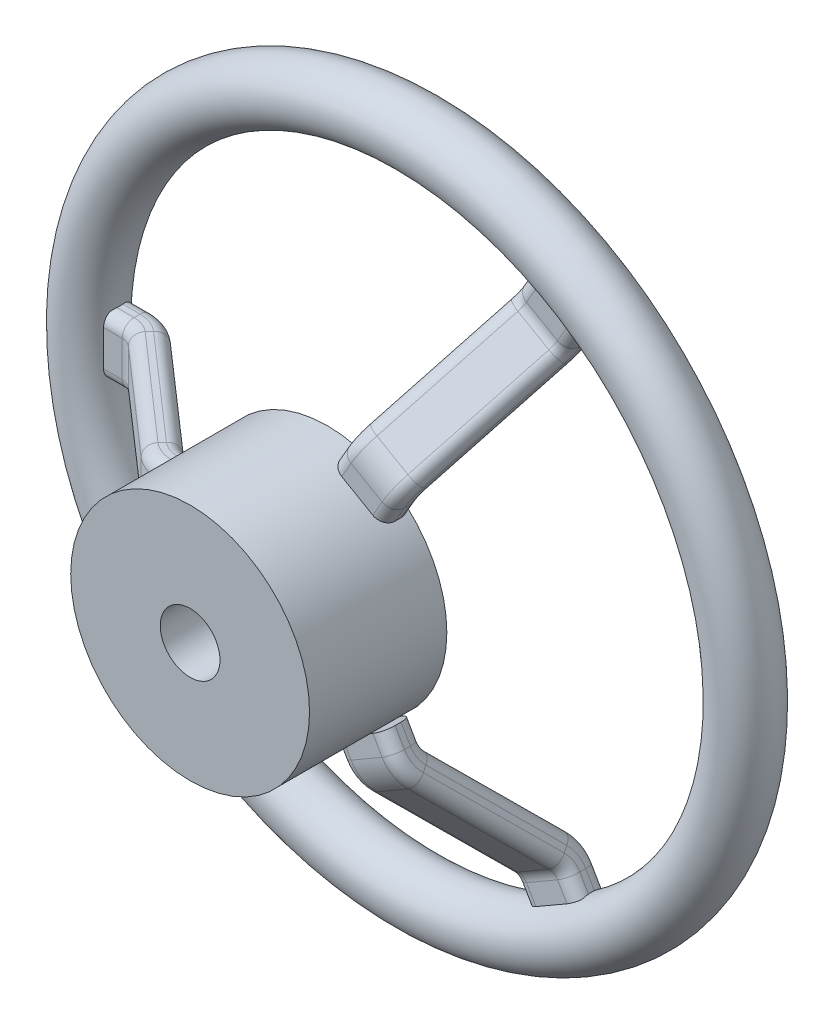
ISO-10303-21;
HEADER;
FILE_DESCRIPTION(('STEP AP214'),'2;1');
FILE_NAME('part.step','',(''),(''),'','','');
FILE_SCHEMA(('AUTOMOTIVE_DESIGN { 1 0 10303 214 1 1 1 1 }'));
ENDSEC;
DATA;
#1=APPLICATION_CONTEXT('core data for automotive mechanical design processes');
#2=APPLICATION_PROTOCOL_DEFINITION('international standard','automotive_design',2000,#1);
#3=PRODUCT_CONTEXT('',#1,'mechanical');
#4=PRODUCT('Part','Part','',(#3));
#5=PRODUCT_RELATED_PRODUCT_CATEGORY('part','',(#4));
#6=PRODUCT_DEFINITION_FORMATION('','',#4);
#7=PRODUCT_DEFINITION_CONTEXT('part definition',#1,'design');
#8=PRODUCT_DEFINITION('design','',#6,#7);
#9=PRODUCT_DEFINITION_SHAPE('','',#8);
#10=(LENGTH_UNIT() NAMED_UNIT(*) SI_UNIT(.MILLI.,.METRE.));
#11=(NAMED_UNIT(*) PLANE_ANGLE_UNIT() SI_UNIT($,.RADIAN.));
#12=(NAMED_UNIT(*) SI_UNIT($,.STERADIAN.) SOLID_ANGLE_UNIT());
#13=UNCERTAINTY_MEASURE_WITH_UNIT(LENGTH_MEASURE(1.E-05),#10,'distance_accuracy_value','');
#14=(GEOMETRIC_REPRESENTATION_CONTEXT(3) GLOBAL_UNCERTAINTY_ASSIGNED_CONTEXT((#13)) GLOBAL_UNIT_ASSIGNED_CONTEXT((#10,
#11,#12)) REPRESENTATION_CONTEXT('',''));
#15=CARTESIAN_POINT('',(0.,0.,0.));
#16=DIRECTION('',(0.,0.,1.));
#17=DIRECTION('',(1.,0.,0.));
#18=AXIS2_PLACEMENT_3D('',#15,#16,#17);
#19=CARTESIAN_POINT('',(22.4019237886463,44.8012701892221,-15.5));
#20=DIRECTION('',(0.499999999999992,0.866025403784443,0.));
#21=DIRECTION('',(0.,0.,1.));
#22=AXIS2_PLACEMENT_3D('',#19,#20,#21);
#23=PLANE('',#22);
#24=CARTESIAN_POINT('',(22.4019237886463,44.8012701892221,-15.5));
#25=DIRECTION('',(-0.499999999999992,-0.866025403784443,0.));
#26=DIRECTION('',(0.,0.,1.));
#27=AXIS2_PLACEMENT_3D('',#24,#25,#26);
#28=CIRCLE('',#27,2.);
#29=CARTESIAN_POINT('',(20.6698729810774,45.8012701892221,-15.5));
#30=VERTEX_POINT('',#29);
#31=CARTESIAN_POINT('',(22.4019237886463,44.8012701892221,-17.5));
#32=VERTEX_POINT('',#31);
#33=EDGE_CURVE('E426',#30,#32,#28,.T.);
#34=ORIENTED_EDGE('',*,*,#33,.F.);
#35=DIRECTION('',(0.,0.,-1.));
#36=VECTOR('',#35,1.);
#37=CARTESIAN_POINT('',(20.6698729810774,45.8012701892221,-15.5));
#38=LINE('',#37,#36);
#39=CARTESIAN_POINT('',(20.6698729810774,45.8012701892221,-14.5));
#40=VERTEX_POINT('',#39);
#41=EDGE_CURVE('E402',#40,#30,#38,.T.);
#42=ORIENTED_EDGE('',*,*,#41,.F.);
#43=CARTESIAN_POINT('',(22.4019237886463,44.8012701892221,-14.5));
#44=DIRECTION('',(-0.499999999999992,-0.866025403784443,0.));
#45=DIRECTION('',(0.,0.,-1.));
#46=AXIS2_PLACEMENT_3D('',#43,#44,#45);
#47=CIRCLE('',#46,2.);
#48=CARTESIAN_POINT('',(22.4019237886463,44.8012701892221,-12.5));
#49=VERTEX_POINT('',#48);
#50=EDGE_CURVE('E380',#49,#40,#47,.T.);
#51=ORIENTED_EDGE('',*,*,#50,.F.);
#52=DIRECTION('',(-0.866025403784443,0.499999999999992,0.));
#53=VECTOR('',#52,1.);
#54=CARTESIAN_POINT('',(27.5980762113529,41.8012701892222,-12.5));
#55=LINE('',#54,#53);
#56=CARTESIAN_POINT('',(27.5980762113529,41.8012701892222,-12.5));
#57=VERTEX_POINT('',#56);
#58=EDGE_CURVE('E356',#57,#49,#55,.T.);
#59=ORIENTED_EDGE('',*,*,#58,.F.);
#60=CARTESIAN_POINT('',(27.5980762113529,41.8012701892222,-14.5));
#61=DIRECTION('',(-0.499999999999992,-0.866025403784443,0.));
#62=DIRECTION('',(0.,0.,-1.));
#63=AXIS2_PLACEMENT_3D('',#60,#61,#62);
#64=CIRCLE('',#63,2.);
#65=CARTESIAN_POINT('',(29.3301270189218,40.8012701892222,-14.5));
#66=VERTEX_POINT('',#65);
#67=EDGE_CURVE('E242',#66,#57,#64,.T.);
#68=ORIENTED_EDGE('',*,*,#67,.F.);
#69=DIRECTION('',(0.,0.,1.));
#70=VECTOR('',#69,1.);
#71=CARTESIAN_POINT('',(29.3301270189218,40.8012701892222,-15.5));
#72=LINE('',#71,#70);
#73=CARTESIAN_POINT('',(29.3301270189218,40.8012701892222,-15.5));
#74=VERTEX_POINT('',#73);
#75=EDGE_CURVE('E246',#74,#66,#72,.T.);
#76=ORIENTED_EDGE('',*,*,#75,.F.);
#77=CARTESIAN_POINT('',(27.5980762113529,41.8012701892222,-15.5));
#78=DIRECTION('',(-0.499999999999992,-0.866025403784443,0.));
#79=DIRECTION('',(0.,0.,-1.));
#80=AXIS2_PLACEMENT_3D('',#77,#78,#79);
#81=CIRCLE('',#80,2.);
#82=CARTESIAN_POINT('',(27.5980762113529,41.8012701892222,-17.5));
#83=VERTEX_POINT('',#82);
#84=EDGE_CURVE('E251',#83,#74,#81,.T.);
#85=ORIENTED_EDGE('',*,*,#84,.F.);
#86=DIRECTION('',(0.866025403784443,-0.499999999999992,0.));
#87=VECTOR('',#86,1.);
#88=CARTESIAN_POINT('',(27.5980762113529,41.8012701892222,-17.5));
#89=LINE('',#88,#87);
#90=EDGE_CURVE('E298',#32,#83,#89,.T.);
#91=ORIENTED_EDGE('',*,*,#90,.F.);
#92=EDGE_LOOP('',(#34,#42,#51,#59,#68,#76,#85,#91));
#93=FACE_BOUND('',#92,.T.);
#94=ADVANCED_FACE('F45',(#93),#23,.T.);
#95=CARTESIAN_POINT('',(7.40192378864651,18.8205080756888,2.));
#96=DIRECTION('',(0.499999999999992,0.866025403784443,0.));
#97=DIRECTION('',(0.,0.,1.));
#98=AXIS2_PLACEMENT_3D('',#95,#96,#97);
#99=PLANE('',#98);
#100=CARTESIAN_POINT('',(7.40192378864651,18.8205080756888,2.));
#101=DIRECTION('',(-0.499999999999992,-0.866025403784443,0.));
#102=DIRECTION('',(0.,0.,1.));
#103=AXIS2_PLACEMENT_3D('',#100,#101,#102);
#104=CIRCLE('',#103,2.);
#105=CARTESIAN_POINT('',(5.66987298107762,19.8205080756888,2.00000000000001));
#106=VERTEX_POINT('',#105);
#107=CARTESIAN_POINT('',(7.40192378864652,18.8205080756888,0.));
#108=VERTEX_POINT('',#107);
#109=EDGE_CURVE('E12',#106,#108,#104,.T.);
#110=ORIENTED_EDGE('',*,*,#109,.T.);
#111=DIRECTION('',(0.866025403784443,-0.499999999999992,0.));
#112=VECTOR('',#111,1.);
#113=CARTESIAN_POINT('',(12.5980762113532,15.8205080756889,0.));
#114=LINE('',#113,#112);
#115=CARTESIAN_POINT('',(12.5980762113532,15.8205080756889,0.));
#116=VERTEX_POINT('',#115);
#117=EDGE_CURVE('E270',#108,#116,#114,.T.);
#118=ORIENTED_EDGE('',*,*,#117,.T.);
#119=CARTESIAN_POINT('',(12.5980762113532,15.8205080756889,2.));
#120=DIRECTION('',(-0.499999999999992,-0.866025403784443,0.));
#121=DIRECTION('',(0.,0.,-1.));
#122=AXIS2_PLACEMENT_3D('',#119,#120,#121);
#123=CIRCLE('',#122,2.);
#124=CARTESIAN_POINT('',(14.3301270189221,14.8205080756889,2.00000000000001));
#125=VERTEX_POINT('',#124);
#126=EDGE_CURVE('E273',#116,#125,#123,.T.);
#127=ORIENTED_EDGE('',*,*,#126,.T.);
#128=DIRECTION('',(0.,0.,1.));
#129=VECTOR('',#128,1.);
#130=CARTESIAN_POINT('',(14.3301270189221,14.8205080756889,2.00000000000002));
#131=LINE('',#130,#129);
#132=CARTESIAN_POINT('',(14.3301270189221,14.8205080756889,2.99999999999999));
#133=VERTEX_POINT('',#132);
#134=EDGE_CURVE('E329',#125,#133,#131,.T.);
#135=ORIENTED_EDGE('',*,*,#134,.T.);
#136=CARTESIAN_POINT('',(12.5980762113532,15.8205080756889,3.));
#137=DIRECTION('',(-0.499999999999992,-0.866025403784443,0.));
#138=DIRECTION('',(0.,0.,-1.));
#139=AXIS2_PLACEMENT_3D('',#136,#137,#138);
#140=CIRCLE('',#139,2.);
#141=CARTESIAN_POINT('',(12.5980762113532,15.8205080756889,5.));
#142=VERTEX_POINT('',#141);
#143=EDGE_CURVE('E354',#133,#142,#140,.T.);
#144=ORIENTED_EDGE('',*,*,#143,.T.);
#145=DIRECTION('',(-0.866025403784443,0.499999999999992,0.));
#146=VECTOR('',#145,1.);
#147=CARTESIAN_POINT('',(12.5980762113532,15.8205080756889,5.));
#148=LINE('',#147,#146);
#149=CARTESIAN_POINT('',(7.40192378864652,18.8205080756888,5.));
#150=VERTEX_POINT('',#149);
#151=EDGE_CURVE('E377',#142,#150,#148,.T.);
#152=ORIENTED_EDGE('',*,*,#151,.T.);
#153=CARTESIAN_POINT('',(7.40192378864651,18.8205080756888,3.));
#154=DIRECTION('',(-0.499999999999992,-0.866025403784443,0.));
#155=DIRECTION('',(0.,0.,-1.));
#156=AXIS2_PLACEMENT_3D('',#153,#154,#155);
#157=CIRCLE('',#156,2.);
#158=CARTESIAN_POINT('',(5.66987298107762,19.8205080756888,2.99999999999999));
#159=VERTEX_POINT('',#158);
#160=EDGE_CURVE('E64',#150,#159,#157,.T.);
#161=ORIENTED_EDGE('',*,*,#160,.T.);
#162=DIRECTION('',(0.,0.,-1.));
#163=VECTOR('',#162,1.);
#164=CARTESIAN_POINT('',(5.66987298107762,19.8205080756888,2.00000000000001));
#165=LINE('',#164,#163);
#166=EDGE_CURVE('E58',#159,#106,#165,.T.);
#167=ORIENTED_EDGE('',*,*,#166,.T.);
#168=EDGE_LOOP('',(#110,#118,#127,#135,#144,#152,#161,#167));
#169=FACE_BOUND('',#168,.T.);
#170=ADVANCED_FACE('F272',(#169),#99,.F.);
#171=CARTESIAN_POINT('',(27.5980762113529,41.8012701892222,-17.5));
#172=DIRECTION('',(0.,0.,-1.));
#173=DIRECTION('',(0.866025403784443,-0.499999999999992,0.));
#174=AXIS2_PLACEMENT_3D('',#171,#172,#173);
#175=PLANE('',#174);
#176=DIRECTION('',(-0.499999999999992,-0.866025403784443,0.));
#177=VECTOR('',#176,1.);
#178=CARTESIAN_POINT('',(27.5980762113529,41.8012701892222,-17.5));
#179=LINE('',#178,#177);
#180=CARTESIAN_POINT('',(26.0374140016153,39.0981239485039,-17.5));
#181=VERTEX_POINT('',#180);
#182=EDGE_CURVE('E303',#83,#181,#179,.T.);
#183=ORIENTED_EDGE('',*,*,#182,.T.);
#184=DIRECTION('',(0.866025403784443,-0.499999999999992,0.));
#185=VECTOR('',#184,1.);
#186=CARTESIAN_POINT('',(26.0374140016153,39.0981239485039,-17.5));
#187=LINE('',#186,#185);
#188=CARTESIAN_POINT('',(20.8412615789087,42.0981239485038,-17.5));
#189=VERTEX_POINT('',#188);
#190=EDGE_CURVE('E489',#189,#181,#187,.T.);
#191=ORIENTED_EDGE('',*,*,#190,.F.);
#192=DIRECTION('',(-0.499999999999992,-0.866025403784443,0.));
#193=VECTOR('',#192,1.);
#194=CARTESIAN_POINT('',(22.4019237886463,44.8012701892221,-17.5));
#195=LINE('',#194,#193);
#196=EDGE_CURVE('E452',#32,#189,#195,.T.);
#197=ORIENTED_EDGE('',*,*,#196,.F.);
#198=ORIENTED_EDGE('',*,*,#90,.T.);
#199=EDGE_LOOP('',(#183,#191,#197,#198));
#200=FACE_BOUND('',#199,.T.);
#201=ADVANCED_FACE('F497',(#200),#175,.T.);
#202=CARTESIAN_POINT('',(27.5980762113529,41.8012701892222,-15.5));
#203=DIRECTION('',(-0.499999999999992,-0.866025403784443,0.));
#204=DIRECTION('',(0.,0.,-1.));
#205=AXIS2_PLACEMENT_3D('',#202,#203,#204);
#206=CYLINDRICAL_SURFACE('',#205,2.);
#207=DIRECTION('',(-0.499999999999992,-0.866025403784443,0.));
#208=VECTOR('',#207,1.);
#209=CARTESIAN_POINT('',(29.3301270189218,40.8012701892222,-15.5));
#210=LINE('',#209,#208);
#211=CARTESIAN_POINT('',(27.7694648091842,38.0981239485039,-15.5));
#212=VERTEX_POINT('',#211);
#213=EDGE_CURVE('E302',#74,#212,#210,.T.);
#214=ORIENTED_EDGE('',*,*,#213,.T.);
#215=CARTESIAN_POINT('',(26.0374140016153,39.0981239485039,-15.5));
#216=DIRECTION('',(-0.499999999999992,-0.866025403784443,0.));
#217=DIRECTION('',(0.,0.,-1.));
#218=AXIS2_PLACEMENT_3D('',#215,#216,#217);
#219=CIRCLE('',#218,2.);
#220=EDGE_CURVE('E299',#181,#212,#219,.T.);
#221=ORIENTED_EDGE('',*,*,#220,.F.);
#222=ORIENTED_EDGE('',*,*,#182,.F.);
#223=ORIENTED_EDGE('',*,*,#84,.T.);
#224=EDGE_LOOP('',(#214,#221,#222,#223));
#225=FACE_BOUND('',#224,.T.);
#226=ADVANCED_FACE('F501',(#225),#206,.T.);
#227=CARTESIAN_POINT('',(29.3301270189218,40.8012701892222,-15.5));
#228=DIRECTION('',(0.866025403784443,-0.499999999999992,0.));
#229=DIRECTION('',(0.,0.,1.));
#230=AXIS2_PLACEMENT_3D('',#227,#228,#229);
#231=PLANE('',#230);
#232=DIRECTION('',(-0.499999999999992,-0.866025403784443,0.));
#233=VECTOR('',#232,1.);
#234=CARTESIAN_POINT('',(29.3301270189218,40.8012701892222,-14.5));
#235=LINE('',#234,#233);
#236=CARTESIAN_POINT('',(27.7694648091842,38.0981239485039,-14.5));
#237=VERTEX_POINT('',#236);
#238=EDGE_CURVE('E332',#66,#237,#235,.T.);
#239=ORIENTED_EDGE('',*,*,#238,.T.);
#240=DIRECTION('',(0.,0.,1.));
#241=VECTOR('',#240,1.);
#242=CARTESIAN_POINT('',(27.7694648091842,38.0981239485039,-15.5));
#243=LINE('',#242,#241);
#244=EDGE_CURVE('E306',#212,#237,#243,.T.);
#245=ORIENTED_EDGE('',*,*,#244,.F.);
#246=ORIENTED_EDGE('',*,*,#213,.F.);
#247=ORIENTED_EDGE('',*,*,#75,.T.);
#248=EDGE_LOOP('',(#239,#245,#246,#247));
#249=FACE_BOUND('',#248,.T.);
#250=ADVANCED_FACE('F551',(#249),#231,.T.);
#251=CARTESIAN_POINT('',(27.5980762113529,41.8012701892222,-14.5));
#252=DIRECTION('',(-0.499999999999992,-0.866025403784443,0.));
#253=DIRECTION('',(0.,0.,-1.));
#254=AXIS2_PLACEMENT_3D('',#251,#252,#253);
#255=CYLINDRICAL_SURFACE('',#254,2.);
#256=DIRECTION('',(-0.499999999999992,-0.866025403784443,0.));
#257=VECTOR('',#256,1.);
#258=CARTESIAN_POINT('',(27.5980762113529,41.8012701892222,-12.5));
#259=LINE('',#258,#257);
#260=CARTESIAN_POINT('',(26.0374140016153,39.0981239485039,-12.5));
#261=VERTEX_POINT('',#260);
#262=EDGE_CURVE('E358',#57,#261,#259,.T.);
#263=ORIENTED_EDGE('',*,*,#262,.T.);
#264=CARTESIAN_POINT('',(26.0374140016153,39.0981239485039,-14.5));
#265=DIRECTION('',(-0.499999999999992,-0.866025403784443,0.));
#266=DIRECTION('',(0.,0.,-1.));
#267=AXIS2_PLACEMENT_3D('',#264,#265,#266);
#268=CIRCLE('',#267,2.);
#269=EDGE_CURVE('E335',#237,#261,#268,.T.);
#270=ORIENTED_EDGE('',*,*,#269,.F.);
#271=ORIENTED_EDGE('',*,*,#238,.F.);
#272=ORIENTED_EDGE('',*,*,#67,.T.);
#273=EDGE_LOOP('',(#263,#270,#271,#272));
#274=FACE_BOUND('',#273,.T.);
#275=ADVANCED_FACE('F554',(#274),#255,.T.);
#276=CARTESIAN_POINT('',(27.5980762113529,41.8012701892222,-12.5));
#277=DIRECTION('',(0.,0.,1.));
#278=DIRECTION('',(-0.866025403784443,0.499999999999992,0.));
#279=AXIS2_PLACEMENT_3D('',#276,#277,#278);
#280=PLANE('',#279);
#281=DIRECTION('',(-0.499999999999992,-0.866025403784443,0.));
#282=VECTOR('',#281,1.);
#283=CARTESIAN_POINT('',(22.4019237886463,44.8012701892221,-12.5));
#284=LINE('',#283,#282);
#285=CARTESIAN_POINT('',(20.8412615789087,42.0981239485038,-12.5));
#286=VERTEX_POINT('',#285);
#287=EDGE_CURVE('E382',#49,#286,#284,.T.);
#288=ORIENTED_EDGE('',*,*,#287,.T.);
#289=DIRECTION('',(-0.866025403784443,0.499999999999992,0.));
#290=VECTOR('',#289,1.);
#291=CARTESIAN_POINT('',(26.0374140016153,39.0981239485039,-12.5));
#292=LINE('',#291,#290);
#293=EDGE_CURVE('E361',#261,#286,#292,.T.);
#294=ORIENTED_EDGE('',*,*,#293,.F.);
#295=ORIENTED_EDGE('',*,*,#262,.F.);
#296=ORIENTED_EDGE('',*,*,#58,.T.);
#297=EDGE_LOOP('',(#288,#294,#295,#296));
#298=FACE_BOUND('',#297,.T.);
#299=ADVANCED_FACE('F640',(#298),#280,.T.);
#300=CARTESIAN_POINT('',(22.4019237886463,44.8012701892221,-14.5));
#301=DIRECTION('',(-0.499999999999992,-0.866025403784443,0.));
#302=DIRECTION('',(0.,0.,-1.));
#303=AXIS2_PLACEMENT_3D('',#300,#301,#302);
#304=CYLINDRICAL_SURFACE('',#303,2.);
#305=DIRECTION('',(-0.499999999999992,-0.866025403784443,0.));
#306=VECTOR('',#305,1.);
#307=CARTESIAN_POINT('',(20.6698729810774,45.8012701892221,-14.5));
#308=LINE('',#307,#306);
#309=CARTESIAN_POINT('',(19.1092107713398,43.0981239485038,-14.5));
#310=VERTEX_POINT('',#309);
#311=EDGE_CURVE('E405',#40,#310,#308,.T.);
#312=ORIENTED_EDGE('',*,*,#311,.T.);
#313=CARTESIAN_POINT('',(20.8412615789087,42.0981239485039,-14.5));
#314=DIRECTION('',(-0.499999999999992,-0.866025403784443,0.));
#315=DIRECTION('',(0.,0.,-1.));
#316=AXIS2_PLACEMENT_3D('',#313,#314,#315);
#317=CIRCLE('',#316,2.);
#318=EDGE_CURVE('E385',#286,#310,#317,.T.);
#319=ORIENTED_EDGE('',*,*,#318,.F.);
#320=ORIENTED_EDGE('',*,*,#287,.F.);
#321=ORIENTED_EDGE('',*,*,#50,.T.);
#322=EDGE_LOOP('',(#312,#319,#320,#321));
#323=FACE_BOUND('',#322,.T.);
#324=ADVANCED_FACE('F599',(#323),#304,.T.);
#325=CARTESIAN_POINT('',(20.6698729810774,45.8012701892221,-15.5));
#326=DIRECTION('',(-0.866025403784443,0.499999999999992,0.));
#327=DIRECTION('',(0.,0.,-1.));
#328=AXIS2_PLACEMENT_3D('',#325,#326,#327);
#329=PLANE('',#328);
#330=DIRECTION('',(-0.499999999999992,-0.866025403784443,0.));
#331=VECTOR('',#330,1.);
#332=CARTESIAN_POINT('',(20.6698729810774,45.8012701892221,-15.5));
#333=LINE('',#332,#331);
#334=CARTESIAN_POINT('',(19.1092107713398,43.0981239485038,-15.5));
#335=VERTEX_POINT('',#334);
#336=EDGE_CURVE('E429',#30,#335,#333,.T.);
#337=ORIENTED_EDGE('',*,*,#336,.T.);
#338=DIRECTION('',(0.,0.,-1.));
#339=VECTOR('',#338,1.);
#340=CARTESIAN_POINT('',(19.1092107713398,43.0981239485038,-15.5));
#341=LINE('',#340,#339);
#342=EDGE_CURVE('E408',#310,#335,#341,.T.);
#343=ORIENTED_EDGE('',*,*,#342,.F.);
#344=ORIENTED_EDGE('',*,*,#311,.F.);
#345=ORIENTED_EDGE('',*,*,#41,.T.);
#346=EDGE_LOOP('',(#337,#343,#344,#345));
#347=FACE_BOUND('',#346,.T.);
#348=ADVANCED_FACE('F590',(#347),#329,.T.);
#349=CARTESIAN_POINT('',(22.4019237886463,44.8012701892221,-15.5));
#350=DIRECTION('',(-0.499999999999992,-0.866025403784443,0.));
#351=DIRECTION('',(0.,0.,-1.));
#352=AXIS2_PLACEMENT_3D('',#349,#350,#351);
#353=CYLINDRICAL_SURFACE('',#352,2.);
#354=CARTESIAN_POINT('',(20.8412615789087,42.0981239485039,-15.5));
#355=DIRECTION('',(-0.499999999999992,-0.866025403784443,0.));
#356=DIRECTION('',(0.,0.,1.));
#357=AXIS2_PLACEMENT_3D('',#354,#355,#356);
#358=CIRCLE('',#357,2.);
#359=EDGE_CURVE('E432',#335,#189,#358,.T.);
#360=ORIENTED_EDGE('',*,*,#359,.F.);
#361=ORIENTED_EDGE('',*,*,#336,.F.);
#362=ORIENTED_EDGE('',*,*,#33,.T.);
#363=ORIENTED_EDGE('',*,*,#196,.T.);
#364=EDGE_LOOP('',(#360,#361,#362,#363));
#365=FACE_BOUND('',#364,.T.);
#366=ADVANCED_FACE('F591',(#365),#353,.T.);
#367=CARTESIAN_POINT('',(23.439337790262,40.5981239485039,-10.));
#368=DIRECTION('',(-0.866025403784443,0.499999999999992,0.));
#369=DIRECTION('',(0.,0.,-1.));
#370=AXIS2_PLACEMENT_3D('',#367,#368,#369);
#371=CYLINDRICAL_SURFACE('',#370,7.50000000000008);
#372=CARTESIAN_POINT('',(26.0374140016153,39.0981239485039,-10.));
#373=DIRECTION('',(-0.866025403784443,0.499999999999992,0.));
#374=DIRECTION('',(0.,0.,-1.));
#375=AXIS2_PLACEMENT_3D('',#372,#373,#374);
#376=CIRCLE('',#375,7.50000000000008);
#377=CARTESIAN_POINT('',(23.5680217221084,34.8210110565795,-15.6443252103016));
#378=VERTEX_POINT('',#377);
#379=EDGE_CURVE('E310',#181,#378,#376,.T.);
#380=ORIENTED_EDGE('',*,*,#379,.T.);
#381=DIRECTION('',(0.866025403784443,-0.499999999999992,0.));
#382=VECTOR('',#381,1.);
#383=CARTESIAN_POINT('',(23.5680217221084,34.8210110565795,-15.6443252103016));
#384=LINE('',#383,#382);
#385=CARTESIAN_POINT('',(18.3718692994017,37.8210110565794,-15.6443252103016));
#386=VERTEX_POINT('',#385);
#387=EDGE_CURVE('E482',#386,#378,#384,.T.);
#388=ORIENTED_EDGE('',*,*,#387,.F.);
#389=CARTESIAN_POINT('',(20.8412615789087,42.0981239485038,-10.));
#390=DIRECTION('',(-0.866025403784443,0.499999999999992,0.));
#391=DIRECTION('',(0.,0.,-1.));
#392=AXIS2_PLACEMENT_3D('',#389,#390,#391);
#393=CIRCLE('',#392,7.50000000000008);
#394=EDGE_CURVE('E455',#189,#386,#393,.T.);
#395=ORIENTED_EDGE('',*,*,#394,.F.);
#396=ORIENTED_EDGE('',*,*,#190,.T.);
#397=EDGE_LOOP('',(#380,#388,#395,#396));
#398=FACE_BOUND('',#397,.T.);
#399=ADVANCED_FACE('F508',(#398),#371,.T.);
#400=CARTESIAN_POINT('',(26.0374140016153,39.0981239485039,-10.));
#401=DIRECTION('',(-0.866025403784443,0.499999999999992,0.));
#402=DIRECTION('',(0.,0.,-1.));
#403=AXIS2_PLACEMENT_3D('',#400,#401,#402);
#404=TOROIDAL_SURFACE('',#403,5.50000000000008,2.);
#405=CARTESIAN_POINT('',(27.7694648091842,38.0981239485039,-10.));
#406=DIRECTION('',(-0.866025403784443,0.499999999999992,0.));
#407=DIRECTION('',(0.,0.,-1.));
#408=AXIS2_PLACEMENT_3D('',#405,#406,#407);
#409=CIRCLE('',#408,5.50000000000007);
#410=CARTESIAN_POINT('',(25.9585771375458,34.961574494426,-14.1391718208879));
#411=VERTEX_POINT('',#410);
#412=EDGE_CURVE('E223',#212,#411,#409,.T.);
#413=ORIENTED_EDGE('',*,*,#412,.T.);
#414=CARTESIAN_POINT('',(24.2265263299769,35.961574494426,-14.1391718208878));
#415=DIRECTION('',(-0.376288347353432,-0.651750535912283,0.658504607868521));
#416=DIRECTION('',(-0.329252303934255,-0.570281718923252,-0.752576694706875));
#417=AXIS2_PLACEMENT_3D('',#414,#415,#416);
#418=CIRCLE('',#417,2.);
#419=EDGE_CURVE('E307',#378,#411,#418,.T.);
#420=ORIENTED_EDGE('',*,*,#419,.F.);
#421=ORIENTED_EDGE('',*,*,#379,.F.);
#422=ORIENTED_EDGE('',*,*,#220,.T.);
#423=EDGE_LOOP('',(#413,#420,#421,#422));
#424=FACE_BOUND('',#423,.T.);
#425=ADVANCED_FACE('F504',(#424),#404,.T.);
#426=CARTESIAN_POINT('',(27.7694648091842,38.0981239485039,-15.5000000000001));
#427=DIRECTION('',(0.866025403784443,-0.499999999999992,0.));
#428=DIRECTION('',(0.,0.,1.));
#429=AXIS2_PLACEMENT_3D('',#426,#427,#428);
#430=PLANE('',#429);
#431=CARTESIAN_POINT('',(27.7694648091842,38.0981239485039,-10.));
#432=DIRECTION('',(-0.866025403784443,0.499999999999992,0.));
#433=DIRECTION('',(0.,0.,-1.));
#434=AXIS2_PLACEMENT_3D('',#431,#432,#433);
#435=CIRCLE('',#434,4.5000000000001);
#436=CARTESIAN_POINT('',(26.28782944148,35.5318562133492,-13.386595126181));
#437=VERTEX_POINT('',#436);
#438=EDGE_CURVE('E214',#237,#437,#435,.T.);
#439=ORIENTED_EDGE('',*,*,#438,.T.);
#440=DIRECTION('',(0.329252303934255,0.570281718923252,0.752576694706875));
#441=VECTOR('',#440,1.);
#442=CARTESIAN_POINT('',(25.9585771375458,34.961574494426,-14.1391718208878));
#443=LINE('',#442,#441);
#444=EDGE_CURVE('E312',#411,#437,#443,.T.);
#445=ORIENTED_EDGE('',*,*,#444,.F.);
#446=ORIENTED_EDGE('',*,*,#412,.F.);
#447=ORIENTED_EDGE('',*,*,#244,.T.);
#448=EDGE_LOOP('',(#439,#445,#446,#447));
#449=FACE_BOUND('',#448,.T.);
#450=ADVANCED_FACE('F549',(#449),#430,.T.);
#451=CARTESIAN_POINT('',(26.0374140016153,39.0981239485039,-10.));
#452=DIRECTION('',(-0.866025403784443,0.499999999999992,0.));
#453=DIRECTION('',(0.,0.,-1.));
#454=AXIS2_PLACEMENT_3D('',#451,#452,#453);
#455=TOROIDAL_SURFACE('',#454,4.50000000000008,2.);
#456=CARTESIAN_POINT('',(26.0374140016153,39.0981239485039,-10.));
#457=DIRECTION('',(-0.866025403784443,0.499999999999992,0.));
#458=DIRECTION('',(0.,0.,-1.));
#459=AXIS2_PLACEMENT_3D('',#456,#457,#458);
#460=CIRCLE('',#459,2.50000000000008);
#461=CARTESIAN_POINT('',(25.2142832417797,37.6724196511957,-11.8814417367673));
#462=VERTEX_POINT('',#461);
#463=EDGE_CURVE('E207',#261,#462,#460,.T.);
#464=ORIENTED_EDGE('',*,*,#463,.T.);
#465=CARTESIAN_POINT('',(24.5557786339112,36.5318562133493,-13.3865951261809));
#466=DIRECTION('',(-0.376288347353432,-0.651750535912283,0.658504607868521));
#467=DIRECTION('',(-0.329252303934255,-0.570281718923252,-0.752576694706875));
#468=AXIS2_PLACEMENT_3D('',#465,#466,#467);
#469=CIRCLE('',#468,2.);
#470=EDGE_CURVE('E339',#437,#462,#469,.T.);
#471=ORIENTED_EDGE('',*,*,#470,.F.);
#472=ORIENTED_EDGE('',*,*,#438,.F.);
#473=ORIENTED_EDGE('',*,*,#269,.T.);
#474=EDGE_LOOP('',(#464,#471,#472,#473));
#475=FACE_BOUND('',#474,.T.);
#476=ADVANCED_FACE('F556',(#475),#455,.T.);
#477=CARTESIAN_POINT('',(23.439337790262,40.5981239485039,-10.));
#478=DIRECTION('',(-0.866025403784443,0.499999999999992,0.));
#479=DIRECTION('',(0.,0.,-1.));
#480=AXIS2_PLACEMENT_3D('',#477,#478,#479);
#481=CYLINDRICAL_SURFACE('',#480,2.50000000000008);
#482=CARTESIAN_POINT('',(20.8412615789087,42.0981239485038,-10.));
#483=DIRECTION('',(-0.866025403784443,0.499999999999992,0.));
#484=DIRECTION('',(0.,0.,-1.));
#485=AXIS2_PLACEMENT_3D('',#482,#483,#484);
#486=CIRCLE('',#485,2.50000000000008);
#487=CARTESIAN_POINT('',(20.018130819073,40.6724196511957,-11.8814417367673));
#488=VERTEX_POINT('',#487);
#489=EDGE_CURVE('E387',#286,#488,#486,.T.);
#490=ORIENTED_EDGE('',*,*,#489,.T.);
#491=DIRECTION('',(-0.866025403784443,0.499999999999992,0.));
#492=VECTOR('',#491,1.);
#493=CARTESIAN_POINT('',(25.2142832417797,37.6724196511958,-11.8814417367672));
#494=LINE('',#493,#492);
#495=EDGE_CURVE('E364',#462,#488,#494,.T.);
#496=ORIENTED_EDGE('',*,*,#495,.F.);
#497=ORIENTED_EDGE('',*,*,#463,.F.);
#498=ORIENTED_EDGE('',*,*,#293,.T.);
#499=EDGE_LOOP('',(#490,#496,#497,#498));
#500=FACE_BOUND('',#499,.T.);
#501=ADVANCED_FACE('F644',(#500),#481,.F.);
#502=CARTESIAN_POINT('',(20.8412615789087,42.0981239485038,-10.));
#503=DIRECTION('',(-0.866025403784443,0.499999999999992,0.));
#504=DIRECTION('',(0.,0.,-1.));
#505=AXIS2_PLACEMENT_3D('',#502,#503,#504);
#506=TOROIDAL_SURFACE('',#505,4.50000000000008,2.);
#507=CARTESIAN_POINT('',(19.1092107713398,43.0981239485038,-10.));
#508=DIRECTION('',(-0.866025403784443,0.499999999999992,0.));
#509=DIRECTION('',(0.,0.,-1.));
#510=AXIS2_PLACEMENT_3D('',#507,#508,#509);
#511=CIRCLE('',#510,4.5000000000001);
#512=CARTESIAN_POINT('',(17.6275754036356,40.5318562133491,-13.386595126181));
#513=VERTEX_POINT('',#512);
#514=EDGE_CURVE('E410',#310,#513,#511,.T.);
#515=ORIENTED_EDGE('',*,*,#514,.T.);
#516=CARTESIAN_POINT('',(19.3596262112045,39.5318562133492,-13.3865951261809));
#517=DIRECTION('',(-0.376288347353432,-0.651750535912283,0.658504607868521));
#518=DIRECTION('',(-0.329252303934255,-0.570281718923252,-0.752576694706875));
#519=AXIS2_PLACEMENT_3D('',#516,#517,#518);
#520=CIRCLE('',#519,2.);
#521=EDGE_CURVE('E390',#488,#513,#520,.T.);
#522=ORIENTED_EDGE('',*,*,#521,.F.);
#523=ORIENTED_EDGE('',*,*,#489,.F.);
#524=ORIENTED_EDGE('',*,*,#318,.T.);
#525=EDGE_LOOP('',(#515,#522,#523,#524));
#526=FACE_BOUND('',#525,.T.);
#527=ADVANCED_FACE('F642',(#526),#506,.T.);
#528=CARTESIAN_POINT('',(19.1092107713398,43.0981239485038,-15.5000000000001));
#529=DIRECTION('',(-0.866025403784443,0.499999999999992,0.));
#530=DIRECTION('',(0.,0.,-1.));
#531=AXIS2_PLACEMENT_3D('',#528,#529,#530);
#532=PLANE('',#531);
#533=CARTESIAN_POINT('',(19.1092107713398,43.0981239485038,-10.));
#534=DIRECTION('',(-0.866025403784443,0.499999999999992,0.));
#535=DIRECTION('',(0.,0.,-1.));
#536=AXIS2_PLACEMENT_3D('',#533,#534,#535);
#537=CIRCLE('',#536,5.50000000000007);
#538=CARTESIAN_POINT('',(17.2983230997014,39.9615744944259,-14.1391718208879));
#539=VERTEX_POINT('',#538);
#540=EDGE_CURVE('E435',#335,#539,#537,.T.);
#541=ORIENTED_EDGE('',*,*,#540,.T.);
#542=DIRECTION('',(-0.329252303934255,-0.570281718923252,-0.752576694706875));
#543=VECTOR('',#542,1.);
#544=CARTESIAN_POINT('',(17.2983230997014,39.9615744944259,-14.1391718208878));
#545=LINE('',#544,#543);
#546=EDGE_CURVE('E413',#513,#539,#545,.T.);
#547=ORIENTED_EDGE('',*,*,#546,.F.);
#548=ORIENTED_EDGE('',*,*,#514,.F.);
#549=ORIENTED_EDGE('',*,*,#342,.T.);
#550=EDGE_LOOP('',(#541,#547,#548,#549));
#551=FACE_BOUND('',#550,.T.);
#552=ADVANCED_FACE('F519',(#551),#532,.T.);
#553=CARTESIAN_POINT('',(20.8412615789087,42.0981239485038,-10.));
#554=DIRECTION('',(-0.866025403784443,0.499999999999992,0.));
#555=DIRECTION('',(0.,0.,-1.));
#556=AXIS2_PLACEMENT_3D('',#553,#554,#555);
#557=TOROIDAL_SURFACE('',#556,5.50000000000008,2.);
#558=CARTESIAN_POINT('',(19.0303739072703,38.961574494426,-14.1391718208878));
#559=DIRECTION('',(-0.376288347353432,-0.651750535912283,0.658504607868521));
#560=DIRECTION('',(0.329252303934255,0.570281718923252,0.752576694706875));
#561=AXIS2_PLACEMENT_3D('',#558,#559,#560);
#562=CIRCLE('',#561,2.);
#563=EDGE_CURVE('E438',#539,#386,#562,.T.);
#564=ORIENTED_EDGE('',*,*,#563,.F.);
#565=ORIENTED_EDGE('',*,*,#540,.F.);
#566=ORIENTED_EDGE('',*,*,#359,.T.);
#567=ORIENTED_EDGE('',*,*,#394,.T.);
#568=EDGE_LOOP('',(#564,#565,#566,#567));
#569=FACE_BOUND('',#568,.T.);
#570=ADVANCED_FACE('F515',(#569),#557,.T.);
#571=CARTESIAN_POINT('',(23.5680217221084,34.8210110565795,-15.6443252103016));
#572=DIRECTION('',(-0.329252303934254,-0.57028171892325,-0.752576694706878));
#573=DIRECTION('',(0.376288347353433,0.651750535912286,-0.658504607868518));
#574=AXIS2_PLACEMENT_3D('',#571,#572,#573);
#575=PLANE('',#574);
#576=DIRECTION('',(-0.376288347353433,-0.651750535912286,0.658504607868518));
#577=VECTOR('',#576,1.);
#578=CARTESIAN_POINT('',(23.5680217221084,34.8210110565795,-15.6443252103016));
#579=LINE('',#578,#577);
#580=CARTESIAN_POINT('',(14.9818691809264,19.9493586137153,-0.618558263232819));
#581=VERTEX_POINT('',#580);
#582=EDGE_CURVE('E317',#378,#581,#579,.T.);
#583=ORIENTED_EDGE('',*,*,#582,.T.);
#584=DIRECTION('',(0.866025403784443,-0.499999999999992,0.));
#585=VECTOR('',#584,1.);
#586=CARTESIAN_POINT('',(14.9818691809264,19.9493586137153,-0.618558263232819));
#587=LINE('',#586,#585);
#588=CARTESIAN_POINT('',(9.78571675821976,22.9493586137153,-0.618558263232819));
#589=VERTEX_POINT('',#588);
#590=EDGE_CURVE('E476',#589,#581,#587,.T.);
#591=ORIENTED_EDGE('',*,*,#590,.F.);
#592=DIRECTION('',(-0.376288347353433,-0.651750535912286,0.658504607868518));
#593=VECTOR('',#592,1.);
#594=CARTESIAN_POINT('',(18.3718692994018,37.8210110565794,-15.6443252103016));
#595=LINE('',#594,#593);
#596=EDGE_CURVE('E458',#386,#589,#595,.T.);
#597=ORIENTED_EDGE('',*,*,#596,.F.);
#598=ORIENTED_EDGE('',*,*,#387,.T.);
#599=EDGE_LOOP('',(#583,#591,#597,#598));
#600=FACE_BOUND('',#599,.T.);
#601=ADVANCED_FACE('F510',(#600),#575,.T.);
#602=CARTESIAN_POINT('',(24.2265263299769,35.961574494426,-14.1391718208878));
#603=DIRECTION('',(-0.376288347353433,-0.651750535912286,0.658504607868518));
#604=DIRECTION('',(-0.329252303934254,-0.57028171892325,-0.752576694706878));
#605=AXIS2_PLACEMENT_3D('',#602,#603,#604);
#606=CYLINDRICAL_SURFACE('',#605,2.);
#607=DIRECTION('',(-0.376288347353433,-0.651750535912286,0.658504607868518));
#608=VECTOR('',#607,1.);
#609=CARTESIAN_POINT('',(25.9585771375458,34.961574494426,-14.1391718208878));
#610=LINE('',#609,#608);
#611=CARTESIAN_POINT('',(17.3724245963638,20.0899220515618,0.886595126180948));
#612=VERTEX_POINT('',#611);
#613=EDGE_CURVE('E316',#411,#612,#610,.T.);
#614=ORIENTED_EDGE('',*,*,#613,.T.);
#615=CARTESIAN_POINT('',(15.6403737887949,21.0899220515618,0.886595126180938));
#616=DIRECTION('',(-0.376288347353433,-0.651750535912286,0.658504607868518));
#617=DIRECTION('',(-0.329252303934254,-0.57028171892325,-0.752576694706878));
#618=AXIS2_PLACEMENT_3D('',#615,#616,#617);
#619=CIRCLE('',#618,2.);
#620=EDGE_CURVE('E313',#581,#612,#619,.T.);
#621=ORIENTED_EDGE('',*,*,#620,.F.);
#622=ORIENTED_EDGE('',*,*,#582,.F.);
#623=ORIENTED_EDGE('',*,*,#419,.T.);
#624=EDGE_LOOP('',(#614,#621,#622,#623));
#625=FACE_BOUND('',#624,.T.);
#626=ADVANCED_FACE('F546',(#625),#606,.T.);
#627=CARTESIAN_POINT('',(25.9585771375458,34.961574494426,-14.1391718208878));
#628=DIRECTION('',(0.866025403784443,-0.499999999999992,0.));
#629=DIRECTION('',(0.,0.,1.));
#630=AXIS2_PLACEMENT_3D('',#627,#628,#629);
#631=PLANE('',#630);
#632=DIRECTION('',(-0.376288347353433,-0.651750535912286,0.658504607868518));
#633=VECTOR('',#632,1.);
#634=CARTESIAN_POINT('',(26.2878294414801,35.5318562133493,-13.3865951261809));
#635=LINE('',#634,#633);
#636=CARTESIAN_POINT('',(17.7016769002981,20.6602037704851,1.6391718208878));
#637=VERTEX_POINT('',#636);
#638=EDGE_CURVE('E186',#437,#637,#635,.T.);
#639=ORIENTED_EDGE('',*,*,#638,.T.);
#640=DIRECTION('',(0.329252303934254,0.57028171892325,0.752576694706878));
#641=VECTOR('',#640,1.);
#642=CARTESIAN_POINT('',(17.3724245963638,20.0899220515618,0.886595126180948));
#643=LINE('',#642,#641);
#644=EDGE_CURVE('E320',#612,#637,#643,.T.);
#645=ORIENTED_EDGE('',*,*,#644,.F.);
#646=ORIENTED_EDGE('',*,*,#613,.F.);
#647=ORIENTED_EDGE('',*,*,#444,.T.);
#648=EDGE_LOOP('',(#639,#645,#646,#647));
#649=FACE_BOUND('',#648,.T.);
#650=ADVANCED_FACE('F548',(#649),#631,.T.);
#651=CARTESIAN_POINT('',(24.5557786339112,36.5318562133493,-13.3865951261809));
#652=DIRECTION('',(-0.376288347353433,-0.651750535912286,0.658504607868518));
#653=DIRECTION('',(-0.329252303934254,-0.57028171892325,-0.752576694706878));
#654=AXIS2_PLACEMENT_3D('',#651,#652,#653);
#655=CYLINDRICAL_SURFACE('',#654,2.);
#656=DIRECTION('',(-0.376288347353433,-0.651750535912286,0.658504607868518));
#657=VECTOR('',#656,1.);
#658=CARTESIAN_POINT('',(25.2142832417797,37.6724196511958,-11.8814417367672));
#659=LINE('',#658,#657);
#660=CARTESIAN_POINT('',(16.6281307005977,22.8007672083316,3.14432521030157));
#661=VERTEX_POINT('',#660);
#662=EDGE_CURVE('E177',#462,#661,#659,.T.);
#663=ORIENTED_EDGE('',*,*,#662,.T.);
#664=CARTESIAN_POINT('',(15.9696260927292,21.6602037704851,1.63917182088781));
#665=DIRECTION('',(-0.376288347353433,-0.651750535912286,0.658504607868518));
#666=DIRECTION('',(-0.329252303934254,-0.57028171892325,-0.752576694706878));
#667=AXIS2_PLACEMENT_3D('',#664,#665,#666);
#668=CIRCLE('',#667,2.);
#669=EDGE_CURVE('E343',#637,#661,#668,.T.);
#670=ORIENTED_EDGE('',*,*,#669,.F.);
#671=ORIENTED_EDGE('',*,*,#638,.F.);
#672=ORIENTED_EDGE('',*,*,#470,.T.);
#673=EDGE_LOOP('',(#663,#670,#671,#672));
#674=FACE_BOUND('',#673,.T.);
#675=ADVANCED_FACE('F557',(#674),#655,.T.);
#676=CARTESIAN_POINT('',(25.2142832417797,37.6724196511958,-11.8814417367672));
#677=DIRECTION('',(0.329252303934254,0.57028171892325,0.752576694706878));
#678=DIRECTION('',(-0.376288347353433,-0.651750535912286,0.658504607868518));
#679=AXIS2_PLACEMENT_3D('',#676,#677,#678);
#680=PLANE('',#679);
#681=DIRECTION('',(-0.376288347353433,-0.651750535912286,0.658504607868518));
#682=VECTOR('',#681,1.);
#683=CARTESIAN_POINT('',(20.018130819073,40.6724196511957,-11.8814417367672));
#684=LINE('',#683,#682);
#685=CARTESIAN_POINT('',(11.431978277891,25.8007672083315,3.14432521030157));
#686=VERTEX_POINT('',#685);
#687=EDGE_CURVE('E170',#488,#686,#684,.T.);
#688=ORIENTED_EDGE('',*,*,#687,.T.);
#689=DIRECTION('',(-0.866025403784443,0.499999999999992,0.));
#690=VECTOR('',#689,1.);
#691=CARTESIAN_POINT('',(16.6281307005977,22.8007672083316,3.14432521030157));
#692=LINE('',#691,#690);
#693=EDGE_CURVE('E368',#661,#686,#692,.T.);
#694=ORIENTED_EDGE('',*,*,#693,.F.);
#695=ORIENTED_EDGE('',*,*,#662,.F.);
#696=ORIENTED_EDGE('',*,*,#495,.T.);
#697=EDGE_LOOP('',(#688,#694,#695,#696));
#698=FACE_BOUND('',#697,.T.);
#699=ADVANCED_FACE('F559',(#698),#680,.T.);
#700=CARTESIAN_POINT('',(19.3596262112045,39.5318562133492,-13.3865951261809));
#701=DIRECTION('',(-0.376288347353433,-0.651750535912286,0.658504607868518));
#702=DIRECTION('',(-0.329252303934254,-0.57028171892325,-0.752576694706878));
#703=AXIS2_PLACEMENT_3D('',#700,#701,#702);
#704=CYLINDRICAL_SURFACE('',#703,2.);
#705=DIRECTION('',(-0.376288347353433,-0.651750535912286,0.658504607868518));
#706=VECTOR('',#705,1.);
#707=CARTESIAN_POINT('',(17.6275754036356,40.5318562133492,-13.3865951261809));
#708=LINE('',#707,#706);
#709=CARTESIAN_POINT('',(9.04142286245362,25.660203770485,1.6391718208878));
#710=VERTEX_POINT('',#709);
#711=EDGE_CURVE('E415',#513,#710,#708,.T.);
#712=ORIENTED_EDGE('',*,*,#711,.T.);
#713=CARTESIAN_POINT('',(10.7734736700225,24.660203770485,1.63917182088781));
#714=DIRECTION('',(-0.376288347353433,-0.651750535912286,0.658504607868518));
#715=DIRECTION('',(-0.329252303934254,-0.57028171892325,-0.752576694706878));
#716=AXIS2_PLACEMENT_3D('',#713,#714,#715);
#717=CIRCLE('',#716,2.);
#718=EDGE_CURVE('E393',#686,#710,#717,.T.);
#719=ORIENTED_EDGE('',*,*,#718,.F.);
#720=ORIENTED_EDGE('',*,*,#687,.F.);
#721=ORIENTED_EDGE('',*,*,#521,.T.);
#722=EDGE_LOOP('',(#712,#719,#720,#721));
#723=FACE_BOUND('',#722,.T.);
#724=ADVANCED_FACE('F523',(#723),#704,.T.);
#725=CARTESIAN_POINT('',(17.2983230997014,39.961574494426,-14.1391718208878));
#726=DIRECTION('',(-0.866025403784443,0.499999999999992,0.));
#727=DIRECTION('',(0.,0.,-1.));
#728=AXIS2_PLACEMENT_3D('',#725,#726,#727);
#729=PLANE('',#728);
#730=DIRECTION('',(-0.376288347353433,-0.651750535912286,0.658504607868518));
#731=VECTOR('',#730,1.);
#732=CARTESIAN_POINT('',(17.2983230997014,39.961574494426,-14.1391718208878));
#733=LINE('',#732,#731);
#734=CARTESIAN_POINT('',(8.71217055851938,25.0899220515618,0.886595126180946));
#735=VERTEX_POINT('',#734);
#736=EDGE_CURVE('E440',#539,#735,#733,.T.);
#737=ORIENTED_EDGE('',*,*,#736,.T.);
#738=DIRECTION('',(-0.329252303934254,-0.57028171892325,-0.752576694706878));
#739=VECTOR('',#738,1.);
#740=CARTESIAN_POINT('',(8.71217055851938,25.0899220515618,0.886595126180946));
#741=LINE('',#740,#739);
#742=EDGE_CURVE('E418',#710,#735,#741,.T.);
#743=ORIENTED_EDGE('',*,*,#742,.F.);
#744=ORIENTED_EDGE('',*,*,#711,.F.);
#745=ORIENTED_EDGE('',*,*,#546,.T.);
#746=EDGE_LOOP('',(#737,#743,#744,#745));
#747=FACE_BOUND('',#746,.T.);
#748=ADVANCED_FACE('F522',(#747),#729,.T.);
#749=CARTESIAN_POINT('',(19.0303739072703,38.961574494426,-14.1391718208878));
#750=DIRECTION('',(-0.376288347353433,-0.651750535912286,0.658504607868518));
#751=DIRECTION('',(-0.329252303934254,-0.57028171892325,-0.752576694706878));
#752=AXIS2_PLACEMENT_3D('',#749,#750,#751);
#753=CYLINDRICAL_SURFACE('',#752,2.);
#754=CARTESIAN_POINT('',(10.4442213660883,24.0899220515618,0.886595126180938));
#755=DIRECTION('',(-0.376288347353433,-0.651750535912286,0.658504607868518));
#756=DIRECTION('',(0.329252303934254,0.57028171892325,0.752576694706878));
#757=AXIS2_PLACEMENT_3D('',#754,#755,#756);
#758=CIRCLE('',#757,2.);
#759=EDGE_CURVE('E443',#735,#589,#758,.T.);
#760=ORIENTED_EDGE('',*,*,#759,.F.);
#761=ORIENTED_EDGE('',*,*,#736,.F.);
#762=ORIENTED_EDGE('',*,*,#563,.T.);
#763=ORIENTED_EDGE('',*,*,#596,.T.);
#764=EDGE_LOOP('',(#760,#761,#762,#763));
#765=FACE_BOUND('',#764,.T.);
#766=ADVANCED_FACE('F513',(#765),#753,.T.);
#767=CARTESIAN_POINT('',(11.5606622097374,20.0236543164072,-2.5));
#768=DIRECTION('',(0.866025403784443,-0.499999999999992,0.));
#769=DIRECTION('',(0.,0.,1.));
#770=AXIS2_PLACEMENT_3D('',#767,#768,#769);
#771=CYLINDRICAL_SURFACE('',#770,2.5);
#772=CARTESIAN_POINT('',(14.1587384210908,18.5236543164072,-2.5));
#773=DIRECTION('',(0.866025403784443,-0.499999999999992,0.));
#774=DIRECTION('',(0.329252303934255,0.570281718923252,0.752576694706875));
#775=AXIS2_PLACEMENT_3D('',#772,#773,#774);
#776=CIRCLE('',#775,2.5);
#777=CARTESIAN_POINT('',(14.1587384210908,18.5236543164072,0.));
#778=VERTEX_POINT('',#777);
#779=EDGE_CURVE('E324',#581,#778,#776,.T.);
#780=ORIENTED_EDGE('',*,*,#779,.T.);
#781=DIRECTION('',(0.866025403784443,-0.499999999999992,0.));
#782=VECTOR('',#781,1.);
#783=CARTESIAN_POINT('',(14.1587384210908,18.5236543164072,0.));
#784=LINE('',#783,#782);
#785=CARTESIAN_POINT('',(8.96258599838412,21.5236543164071,0.));
#786=VERTEX_POINT('',#785);
#787=EDGE_CURVE('E291',#786,#778,#784,.T.);
#788=ORIENTED_EDGE('',*,*,#787,.F.);
#789=CARTESIAN_POINT('',(8.96258599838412,21.5236543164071,-2.5));
#790=DIRECTION('',(0.866025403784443,-0.499999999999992,0.));
#791=DIRECTION('',(0.329252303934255,0.570281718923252,0.752576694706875));
#792=AXIS2_PLACEMENT_3D('',#789,#790,#791);
#793=CIRCLE('',#792,2.5);
#794=EDGE_CURVE('E460',#589,#786,#793,.T.);
#795=ORIENTED_EDGE('',*,*,#794,.F.);
#796=ORIENTED_EDGE('',*,*,#590,.T.);
#797=EDGE_LOOP('',(#780,#788,#795,#796));
#798=FACE_BOUND('',#797,.T.);
#799=ADVANCED_FACE('F466',(#798),#771,.F.);
#800=CARTESIAN_POINT('',(14.1587384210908,18.5236543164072,-2.5));
#801=DIRECTION('',(0.866025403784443,-0.499999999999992,0.));
#802=DIRECTION('',(0.,0.,1.));
#803=AXIS2_PLACEMENT_3D('',#800,#801,#802);
#804=TOROIDAL_SURFACE('',#803,4.5,2.);
#805=CARTESIAN_POINT('',(15.8907892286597,17.5236543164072,-2.5));
#806=DIRECTION('',(0.866025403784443,-0.499999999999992,0.));
#807=DIRECTION('',(0.329252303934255,0.570281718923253,0.752576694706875));
#808=AXIS2_PLACEMENT_3D('',#805,#806,#807);
#809=CIRCLE('',#808,4.50000000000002);
#810=CARTESIAN_POINT('',(15.8907892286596,17.5236543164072,2.00000000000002));
#811=VERTEX_POINT('',#810);
#812=EDGE_CURVE('E323',#612,#811,#809,.T.);
#813=ORIENTED_EDGE('',*,*,#812,.T.);
#814=CARTESIAN_POINT('',(14.1587384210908,18.5236543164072,1.99999999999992));
#815=DIRECTION('',(-0.499999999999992,-0.866025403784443,0.));
#816=DIRECTION('',(0.,0.,-1.));
#817=AXIS2_PLACEMENT_3D('',#814,#815,#816);
#818=CIRCLE('',#817,2.);
#819=EDGE_CURVE('E321',#778,#811,#818,.T.);
#820=ORIENTED_EDGE('',*,*,#819,.F.);
#821=ORIENTED_EDGE('',*,*,#779,.F.);
#822=ORIENTED_EDGE('',*,*,#620,.T.);
#823=EDGE_LOOP('',(#813,#820,#821,#822));
#824=FACE_BOUND('',#823,.T.);
#825=ADVANCED_FACE('F543',(#824),#804,.T.);
#826=CARTESIAN_POINT('',(17.3724245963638,20.0899220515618,0.88659512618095));
#827=DIRECTION('',(0.866025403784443,-0.499999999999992,0.));
#828=DIRECTION('',(0.,0.,1.));
#829=AXIS2_PLACEMENT_3D('',#826,#827,#828);
#830=PLANE('',#829);
#831=CARTESIAN_POINT('',(15.8907892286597,17.5236543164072,-2.5));
#832=DIRECTION('',(0.866025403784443,-0.499999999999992,0.));
#833=DIRECTION('',(0.329252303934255,0.570281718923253,0.752576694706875));
#834=AXIS2_PLACEMENT_3D('',#831,#832,#833);
#835=CIRCLE('',#834,5.49999999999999);
#836=CARTESIAN_POINT('',(15.8907892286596,17.5236543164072,2.99999999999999));
#837=VERTEX_POINT('',#836);
#838=EDGE_CURVE('E346',#637,#837,#835,.T.);
#839=ORIENTED_EDGE('',*,*,#838,.T.);
#840=DIRECTION('',(0.,0.,1.));
#841=VECTOR('',#840,1.);
#842=CARTESIAN_POINT('',(15.8907892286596,17.5236543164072,1.99999999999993));
#843=LINE('',#842,#841);
#844=EDGE_CURVE('E326',#811,#837,#843,.T.);
#845=ORIENTED_EDGE('',*,*,#844,.F.);
#846=ORIENTED_EDGE('',*,*,#812,.F.);
#847=ORIENTED_EDGE('',*,*,#644,.T.);
#848=EDGE_LOOP('',(#839,#845,#846,#847));
#849=FACE_BOUND('',#848,.T.);
#850=ADVANCED_FACE('F540',(#849),#830,.T.);
#851=CARTESIAN_POINT('',(14.1587384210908,18.5236543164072,-2.5));
#852=DIRECTION('',(0.866025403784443,-0.499999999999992,0.));
#853=DIRECTION('',(0.,0.,1.));
#854=AXIS2_PLACEMENT_3D('',#851,#852,#853);
#855=TOROIDAL_SURFACE('',#854,5.5,2.);
#856=CARTESIAN_POINT('',(14.1587384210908,18.5236543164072,-2.5));
#857=DIRECTION('',(0.866025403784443,-0.499999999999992,0.));
#858=DIRECTION('',(0.329252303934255,0.570281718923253,0.752576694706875));
#859=AXIS2_PLACEMENT_3D('',#856,#857,#858);
#860=CIRCLE('',#859,7.5);
#861=CARTESIAN_POINT('',(14.1587384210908,18.5236543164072,5.));
#862=VERTEX_POINT('',#861);
#863=EDGE_CURVE('E149',#661,#862,#860,.T.);
#864=ORIENTED_EDGE('',*,*,#863,.T.);
#865=CARTESIAN_POINT('',(14.1587384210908,18.5236543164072,2.99999999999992));
#866=DIRECTION('',(-0.499999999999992,-0.866025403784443,0.));
#867=DIRECTION('',(0.,0.,-1.));
#868=AXIS2_PLACEMENT_3D('',#865,#866,#867);
#869=CIRCLE('',#868,2.);
#870=EDGE_CURVE('E349',#837,#862,#869,.T.);
#871=ORIENTED_EDGE('',*,*,#870,.F.);
#872=ORIENTED_EDGE('',*,*,#838,.F.);
#873=ORIENTED_EDGE('',*,*,#669,.T.);
#874=EDGE_LOOP('',(#864,#871,#872,#873));
#875=FACE_BOUND('',#874,.T.);
#876=ADVANCED_FACE('F532',(#875),#855,.T.);
#877=CARTESIAN_POINT('',(11.5606622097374,20.0236543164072,-2.5));
#878=DIRECTION('',(0.866025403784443,-0.499999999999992,0.));
#879=DIRECTION('',(0.,0.,1.));
#880=AXIS2_PLACEMENT_3D('',#877,#878,#879);
#881=CYLINDRICAL_SURFACE('',#880,7.5);
#882=CARTESIAN_POINT('',(8.96258599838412,21.5236543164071,-2.5));
#883=DIRECTION('',(0.866025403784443,-0.499999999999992,0.));
#884=DIRECTION('',(0.329252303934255,0.570281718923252,0.752576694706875));
#885=AXIS2_PLACEMENT_3D('',#882,#883,#884);
#886=CIRCLE('',#885,7.5);
#887=CARTESIAN_POINT('',(8.96258599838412,21.5236543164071,5.));
#888=VERTEX_POINT('',#887);
#889=EDGE_CURVE('E140',#686,#888,#886,.T.);
#890=ORIENTED_EDGE('',*,*,#889,.T.);
#891=DIRECTION('',(-0.866025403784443,0.499999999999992,0.));
#892=VECTOR('',#891,1.);
#893=CARTESIAN_POINT('',(14.1587384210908,18.5236543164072,4.99999999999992));
#894=LINE('',#893,#892);
#895=EDGE_CURVE('E372',#862,#888,#894,.T.);
#896=ORIENTED_EDGE('',*,*,#895,.F.);
#897=ORIENTED_EDGE('',*,*,#863,.F.);
#898=ORIENTED_EDGE('',*,*,#693,.T.);
#899=EDGE_LOOP('',(#890,#896,#897,#898));
#900=FACE_BOUND('',#899,.T.);
#901=ADVANCED_FACE('F529',(#900),#881,.T.);
#902=CARTESIAN_POINT('',(8.96258599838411,21.5236543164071,-2.5));
#903=DIRECTION('',(0.866025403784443,-0.499999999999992,0.));
#904=DIRECTION('',(0.,0.,1.));
#905=AXIS2_PLACEMENT_3D('',#902,#903,#904);
#906=TOROIDAL_SURFACE('',#905,5.5,2.);
#907=CARTESIAN_POINT('',(7.23053519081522,22.5236543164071,-2.5));
#908=DIRECTION('',(0.866025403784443,-0.499999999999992,0.));
#909=DIRECTION('',(0.329252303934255,0.570281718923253,0.752576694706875));
#910=AXIS2_PLACEMENT_3D('',#907,#908,#909);
#911=CIRCLE('',#910,5.49999999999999);
#912=CARTESIAN_POINT('',(7.23053519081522,22.5236543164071,2.99999999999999));
#913=VERTEX_POINT('',#912);
#914=EDGE_CURVE('E133',#710,#913,#911,.T.);
#915=ORIENTED_EDGE('',*,*,#914,.T.);
#916=CARTESIAN_POINT('',(8.9625859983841,21.5236543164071,2.99999999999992));
#917=DIRECTION('',(-0.499999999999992,-0.866025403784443,0.));
#918=DIRECTION('',(0.,0.,-1.));
#919=AXIS2_PLACEMENT_3D('',#916,#917,#918);
#920=CIRCLE('',#919,2.);
#921=EDGE_CURVE('E397',#888,#913,#920,.T.);
#922=ORIENTED_EDGE('',*,*,#921,.F.);
#923=ORIENTED_EDGE('',*,*,#889,.F.);
#924=ORIENTED_EDGE('',*,*,#718,.T.);
#925=EDGE_LOOP('',(#915,#922,#923,#924));
#926=FACE_BOUND('',#925,.T.);
#927=ADVANCED_FACE('F524',(#926),#906,.T.);
#928=CARTESIAN_POINT('',(8.71217055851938,25.0899220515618,0.88659512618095));
#929=DIRECTION('',(-0.866025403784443,0.499999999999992,0.));
#930=DIRECTION('',(0.,0.,-1.));
#931=AXIS2_PLACEMENT_3D('',#928,#929,#930);
#932=PLANE('',#931);
#933=CARTESIAN_POINT('',(7.23053519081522,22.5236543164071,-2.5));
#934=DIRECTION('',(0.866025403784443,-0.499999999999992,0.));
#935=DIRECTION('',(0.329252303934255,0.570281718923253,0.752576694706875));
#936=AXIS2_PLACEMENT_3D('',#933,#934,#935);
#937=CIRCLE('',#936,4.50000000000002);
#938=CARTESIAN_POINT('',(7.23053519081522,22.5236543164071,2.00000000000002));
#939=VERTEX_POINT('',#938);
#940=EDGE_CURVE('E445',#735,#939,#937,.T.);
#941=ORIENTED_EDGE('',*,*,#940,.T.);
#942=DIRECTION('',(0.,0.,-1.));
#943=VECTOR('',#942,1.);
#944=CARTESIAN_POINT('',(7.23053519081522,22.5236543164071,1.99999999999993));
#945=LINE('',#944,#943);
#946=EDGE_CURVE('E421',#913,#939,#945,.T.);
#947=ORIENTED_EDGE('',*,*,#946,.F.);
#948=ORIENTED_EDGE('',*,*,#914,.F.);
#949=ORIENTED_EDGE('',*,*,#742,.T.);
#950=EDGE_LOOP('',(#941,#947,#948,#949));
#951=FACE_BOUND('',#950,.T.);
#952=ADVANCED_FACE('F616',(#951),#932,.T.);
#953=CARTESIAN_POINT('',(8.96258599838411,21.5236543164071,-2.5));
#954=DIRECTION('',(0.866025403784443,-0.499999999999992,0.));
#955=DIRECTION('',(0.,0.,1.));
#956=AXIS2_PLACEMENT_3D('',#953,#954,#955);
#957=TOROIDAL_SURFACE('',#956,4.5,2.);
#958=CARTESIAN_POINT('',(8.9625859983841,21.5236543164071,1.99999999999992));
#959=DIRECTION('',(-0.499999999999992,-0.866025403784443,0.));
#960=DIRECTION('',(0.,0.,1.));
#961=AXIS2_PLACEMENT_3D('',#958,#959,#960);
#962=CIRCLE('',#961,2.);
#963=EDGE_CURVE('E296',#939,#786,#962,.T.);
#964=ORIENTED_EDGE('',*,*,#963,.F.);
#965=ORIENTED_EDGE('',*,*,#940,.F.);
#966=ORIENTED_EDGE('',*,*,#759,.T.);
#967=ORIENTED_EDGE('',*,*,#794,.T.);
#968=EDGE_LOOP('',(#964,#965,#966,#967));
#969=FACE_BOUND('',#968,.T.);
#970=ADVANCED_FACE('F469',(#969),#957,.T.);
#971=CARTESIAN_POINT('',(14.1587384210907,18.5236543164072,0.));
#972=DIRECTION('',(0.,0.,-1.));
#973=DIRECTION('',(0.866025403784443,-0.499999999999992,0.));
#974=AXIS2_PLACEMENT_3D('',#971,#972,#973);
#975=PLANE('',#974);
#976=DIRECTION('',(-0.499999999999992,-0.866025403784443,0.));
#977=VECTOR('',#976,1.);
#978=CARTESIAN_POINT('',(14.1587384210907,18.5236543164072,0.));
#979=LINE('',#978,#977);
#980=EDGE_CURVE('E278',#778,#116,#979,.T.);
#981=ORIENTED_EDGE('',*,*,#980,.T.);
#982=ORIENTED_EDGE('',*,*,#117,.F.);
#983=DIRECTION('',(-0.499999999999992,-0.866025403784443,0.));
#984=VECTOR('',#983,1.);
#985=CARTESIAN_POINT('',(8.96258599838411,21.5236543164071,0.));
#986=LINE('',#985,#984);
#987=EDGE_CURVE('E279',#786,#108,#986,.T.);
#988=ORIENTED_EDGE('',*,*,#987,.F.);
#989=ORIENTED_EDGE('',*,*,#787,.T.);
#990=EDGE_LOOP('',(#981,#982,#988,#989));
#991=FACE_BOUND('',#990,.T.);
#992=ADVANCED_FACE('F289',(#991),#975,.T.);
#993=CARTESIAN_POINT('',(14.1587384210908,18.5236543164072,2.));
#994=DIRECTION('',(-0.499999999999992,-0.866025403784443,0.));
#995=DIRECTION('',(0.,0.,-1.));
#996=AXIS2_PLACEMENT_3D('',#993,#994,#995);
#997=CYLINDRICAL_SURFACE('',#996,2.);
#998=DIRECTION('',(-0.499999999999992,-0.866025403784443,0.));
#999=VECTOR('',#998,1.);
#1000=CARTESIAN_POINT('',(15.8907892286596,17.5236543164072,2.00000000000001));
#1001=LINE('',#1000,#999);
#1002=EDGE_CURVE('E286',#811,#125,#1001,.T.);
#1003=ORIENTED_EDGE('',*,*,#1002,.T.);
#1004=ORIENTED_EDGE('',*,*,#126,.F.);
#1005=ORIENTED_EDGE('',*,*,#980,.F.);
#1006=ORIENTED_EDGE('',*,*,#819,.T.);
#1007=EDGE_LOOP('',(#1003,#1004,#1005,#1006));
#1008=FACE_BOUND('',#1007,.T.);
#1009=ADVANCED_FACE('F283',(#1008),#997,.T.);
#1010=CARTESIAN_POINT('',(15.8907892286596,17.5236543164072,2.00000000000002));
#1011=DIRECTION('',(0.866025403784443,-0.499999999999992,0.));
#1012=DIRECTION('',(0.,0.,1.));
#1013=AXIS2_PLACEMENT_3D('',#1010,#1011,#1012);
#1014=PLANE('',#1013);
#1015=DIRECTION('',(-0.499999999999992,-0.866025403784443,0.));
#1016=VECTOR('',#1015,1.);
#1017=CARTESIAN_POINT('',(15.8907892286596,17.5236543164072,2.99999999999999));
#1018=LINE('',#1017,#1016);
#1019=EDGE_CURVE('E351',#837,#133,#1018,.T.);
#1020=ORIENTED_EDGE('',*,*,#1019,.T.);
#1021=ORIENTED_EDGE('',*,*,#134,.F.);
#1022=ORIENTED_EDGE('',*,*,#1002,.F.);
#1023=ORIENTED_EDGE('',*,*,#844,.T.);
#1024=EDGE_LOOP('',(#1020,#1021,#1022,#1023));
#1025=FACE_BOUND('',#1024,.T.);
#1026=ADVANCED_FACE('F537',(#1025),#1014,.T.);
#1027=CARTESIAN_POINT('',(14.1587384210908,18.5236543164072,3.));
#1028=DIRECTION('',(-0.499999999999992,-0.866025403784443,0.));
#1029=DIRECTION('',(0.,0.,-1.));
#1030=AXIS2_PLACEMENT_3D('',#1027,#1028,#1029);
#1031=CYLINDRICAL_SURFACE('',#1030,2.);
#1032=DIRECTION('',(-0.499999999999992,-0.866025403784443,0.));
#1033=VECTOR('',#1032,1.);
#1034=CARTESIAN_POINT('',(14.1587384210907,18.5236543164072,5.));
#1035=LINE('',#1034,#1033);
#1036=EDGE_CURVE('E374',#862,#142,#1035,.T.);
#1037=ORIENTED_EDGE('',*,*,#1036,.T.);
#1038=ORIENTED_EDGE('',*,*,#143,.F.);
#1039=ORIENTED_EDGE('',*,*,#1019,.F.);
#1040=ORIENTED_EDGE('',*,*,#870,.T.);
#1041=EDGE_LOOP('',(#1037,#1038,#1039,#1040));
#1042=FACE_BOUND('',#1041,.T.);
#1043=ADVANCED_FACE('F534',(#1042),#1031,.T.);
#1044=CARTESIAN_POINT('',(14.1587384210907,18.5236543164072,5.));
#1045=DIRECTION('',(0.,0.,1.));
#1046=DIRECTION('',(-0.866025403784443,0.499999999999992,0.));
#1047=AXIS2_PLACEMENT_3D('',#1044,#1045,#1046);
#1048=PLANE('',#1047);
#1049=DIRECTION('',(-0.499999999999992,-0.866025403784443,0.));
#1050=VECTOR('',#1049,1.);
#1051=CARTESIAN_POINT('',(8.96258599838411,21.5236543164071,5.));
#1052=LINE('',#1051,#1050);
#1053=EDGE_CURVE('E112',#888,#150,#1052,.T.);
#1054=ORIENTED_EDGE('',*,*,#1053,.T.);
#1055=ORIENTED_EDGE('',*,*,#151,.F.);
#1056=ORIENTED_EDGE('',*,*,#1036,.F.);
#1057=ORIENTED_EDGE('',*,*,#895,.T.);
#1058=EDGE_LOOP('',(#1054,#1055,#1056,#1057));
#1059=FACE_BOUND('',#1058,.T.);
#1060=ADVANCED_FACE('F528',(#1059),#1048,.T.);
#1061=CARTESIAN_POINT('',(8.9625859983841,21.5236543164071,3.));
#1062=DIRECTION('',(-0.499999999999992,-0.866025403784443,0.));
#1063=DIRECTION('',(0.,0.,-1.));
#1064=AXIS2_PLACEMENT_3D('',#1061,#1062,#1063);
#1065=CYLINDRICAL_SURFACE('',#1064,2.);
#1066=DIRECTION('',(-0.499999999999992,-0.866025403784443,0.));
#1067=VECTOR('',#1066,1.);
#1068=CARTESIAN_POINT('',(7.23053519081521,22.5236543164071,2.99999999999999));
#1069=LINE('',#1068,#1067);
#1070=EDGE_CURVE('E104',#913,#159,#1069,.T.);
#1071=ORIENTED_EDGE('',*,*,#1070,.T.);
#1072=ORIENTED_EDGE('',*,*,#160,.F.);
#1073=ORIENTED_EDGE('',*,*,#1053,.F.);
#1074=ORIENTED_EDGE('',*,*,#921,.T.);
#1075=EDGE_LOOP('',(#1071,#1072,#1073,#1074));
#1076=FACE_BOUND('',#1075,.T.);
#1077=ADVANCED_FACE('F525',(#1076),#1065,.T.);
#1078=CARTESIAN_POINT('',(7.23053519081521,22.5236543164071,2.00000000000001));
#1079=DIRECTION('',(-0.866025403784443,0.499999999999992,0.));
#1080=DIRECTION('',(0.,0.,-1.));
#1081=AXIS2_PLACEMENT_3D('',#1078,#1079,#1080);
#1082=PLANE('',#1081);
#1083=DIRECTION('',(-0.499999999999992,-0.866025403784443,0.));
#1084=VECTOR('',#1083,1.);
#1085=CARTESIAN_POINT('',(7.23053519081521,22.5236543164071,2.00000000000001));
#1086=LINE('',#1085,#1084);
#1087=EDGE_CURVE('E52',#939,#106,#1086,.T.);
#1088=ORIENTED_EDGE('',*,*,#1087,.T.);
#1089=ORIENTED_EDGE('',*,*,#166,.F.);
#1090=ORIENTED_EDGE('',*,*,#1070,.F.);
#1091=ORIENTED_EDGE('',*,*,#946,.T.);
#1092=EDGE_LOOP('',(#1088,#1089,#1090,#1091));
#1093=FACE_BOUND('',#1092,.T.);
#1094=ADVANCED_FACE('F570',(#1093),#1082,.T.);
#1095=CARTESIAN_POINT('',(8.9625859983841,21.5236543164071,2.));
#1096=DIRECTION('',(-0.499999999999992,-0.866025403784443,0.));
#1097=DIRECTION('',(0.,0.,-1.));
#1098=AXIS2_PLACEMENT_3D('',#1095,#1096,#1097);
#1099=CYLINDRICAL_SURFACE('',#1098,2.);
#1100=ORIENTED_EDGE('',*,*,#109,.F.);
#1101=ORIENTED_EDGE('',*,*,#1087,.F.);
#1102=ORIENTED_EDGE('',*,*,#963,.T.);
#1103=ORIENTED_EDGE('',*,*,#987,.T.);
#1104=EDGE_LOOP('',(#1100,#1101,#1102,#1103));
#1105=FACE_BOUND('',#1104,.T.);
#1106=ADVANCED_FACE('F461',(#1105),#1099,.T.);
#1107=CLOSED_SHELL('',(#94,#170,#201,#226,#250,#275,#299,#324,#348,#366,#399,#425,#450,#476,
#501,#527,#552,#570,#601,#626,#650,#675,#699,#724,#748,#766,#799,#825,#850,#876,#901,#927,#952,
#970,#992,#1009,#1026,#1043,#1060,#1077,#1094,#1106));
#1108=MANIFOLD_SOLID_BREP('B2',#1107);
#1109=CARTESIAN_POINT('',(27.5980762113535,-41.8012701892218,-15.5));
#1110=DIRECTION('',(0.500000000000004,-0.866025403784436,0.));
#1111=DIRECTION('',(0.,0.,1.));
#1112=AXIS2_PLACEMENT_3D('',#1109,#1110,#1111);
#1113=PLANE('',#1112);
#1114=CARTESIAN_POINT('',(27.5980762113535,-41.8012701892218,-15.5));
#1115=DIRECTION('',(-0.500000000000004,0.866025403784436,0.));
#1116=DIRECTION('',(0.,0.,1.));
#1117=AXIS2_PLACEMENT_3D('',#1114,#1115,#1116);
#1118=CIRCLE('',#1117,2.);
#1119=CARTESIAN_POINT('',(29.3301270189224,-40.8012701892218,-15.5));
#1120=VERTEX_POINT('',#1119);
#1121=CARTESIAN_POINT('',(27.5980762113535,-41.8012701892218,-17.5));
#1122=VERTEX_POINT('',#1121);
#1123=EDGE_CURVE('E1303',#1120,#1122,#1118,.T.);
#1124=ORIENTED_EDGE('',*,*,#1123,.F.);
#1125=DIRECTION('',(0.,0.,-1.));
#1126=VECTOR('',#1125,1.);
#1127=CARTESIAN_POINT('',(29.3301270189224,-40.8012701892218,-15.5));
#1128=LINE('',#1127,#1126);
#1129=CARTESIAN_POINT('',(29.3301270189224,-40.8012701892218,-14.5));
#1130=VERTEX_POINT('',#1129);
#1131=EDGE_CURVE('E1279',#1130,#1120,#1128,.T.);
#1132=ORIENTED_EDGE('',*,*,#1131,.F.);
#1133=CARTESIAN_POINT('',(27.5980762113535,-41.8012701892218,-14.5));
#1134=DIRECTION('',(-0.500000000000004,0.866025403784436,0.));
#1135=DIRECTION('',(0.,0.,-1.));
#1136=AXIS2_PLACEMENT_3D('',#1133,#1134,#1135);
#1137=CIRCLE('',#1136,2.);
#1138=CARTESIAN_POINT('',(27.5980762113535,-41.8012701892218,-12.5));
#1139=VERTEX_POINT('',#1138);
#1140=EDGE_CURVE('E1257',#1139,#1130,#1137,.T.);
#1141=ORIENTED_EDGE('',*,*,#1140,.F.);
#1142=DIRECTION('',(0.866025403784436,0.500000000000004,0.));
#1143=VECTOR('',#1142,1.);
#1144=CARTESIAN_POINT('',(22.4019237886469,-44.8012701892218,-12.5));
#1145=LINE('',#1144,#1143);
#1146=CARTESIAN_POINT('',(22.4019237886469,-44.8012701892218,-12.5));
#1147=VERTEX_POINT('',#1146);
#1148=EDGE_CURVE('E1233',#1147,#1139,#1145,.T.);
#1149=ORIENTED_EDGE('',*,*,#1148,.F.);
#1150=CARTESIAN_POINT('',(22.4019237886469,-44.8012701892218,-14.5));
#1151=DIRECTION('',(-0.500000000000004,0.866025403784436,0.));
#1152=DIRECTION('',(0.,0.,-1.));
#1153=AXIS2_PLACEMENT_3D('',#1150,#1151,#1152);
#1154=CIRCLE('',#1153,2.);
#1155=CARTESIAN_POINT('',(20.669872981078,-45.8012701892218,-14.5));
#1156=VERTEX_POINT('',#1155);
#1157=EDGE_CURVE('E1119',#1156,#1147,#1154,.T.);
#1158=ORIENTED_EDGE('',*,*,#1157,.F.);
#1159=DIRECTION('',(0.,0.,1.));
#1160=VECTOR('',#1159,1.);
#1161=CARTESIAN_POINT('',(20.669872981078,-45.8012701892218,-15.5));
#1162=LINE('',#1161,#1160);
#1163=CARTESIAN_POINT('',(20.669872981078,-45.8012701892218,-15.5));
#1164=VERTEX_POINT('',#1163);
#1165=EDGE_CURVE('E1123',#1164,#1156,#1162,.T.);
#1166=ORIENTED_EDGE('',*,*,#1165,.F.);
#1167=CARTESIAN_POINT('',(22.4019237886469,-44.8012701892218,-15.5));
#1168=DIRECTION('',(-0.500000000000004,0.866025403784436,0.));
#1169=DIRECTION('',(0.,0.,-1.));
#1170=AXIS2_PLACEMENT_3D('',#1167,#1168,#1169);
#1171=CIRCLE('',#1170,2.);
#1172=CARTESIAN_POINT('',(22.4019237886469,-44.8012701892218,-17.5));
#1173=VERTEX_POINT('',#1172);
#1174=EDGE_CURVE('E1128',#1173,#1164,#1171,.T.);
#1175=ORIENTED_EDGE('',*,*,#1174,.F.);
#1176=DIRECTION('',(-0.866025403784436,-0.500000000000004,0.));
#1177=VECTOR('',#1176,1.);
#1178=CARTESIAN_POINT('',(22.4019237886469,-44.8012701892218,-17.5));
#1179=LINE('',#1178,#1177);
#1180=EDGE_CURVE('E1175',#1122,#1173,#1179,.T.);
#1181=ORIENTED_EDGE('',*,*,#1180,.F.);
#1182=EDGE_LOOP('',(#1124,#1132,#1141,#1149,#1158,#1166,#1175,#1181));
#1183=FACE_BOUND('',#1182,.T.);
#1184=ADVANCED_FACE('F922',(#1183),#1113,.T.);
#1185=CARTESIAN_POINT('',(12.5980762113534,-15.8205080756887,2.));
#1186=DIRECTION('',(0.500000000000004,-0.866025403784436,0.));
#1187=DIRECTION('',(0.,0.,1.));
#1188=AXIS2_PLACEMENT_3D('',#1185,#1186,#1187);
#1189=PLANE('',#1188);
#1190=CARTESIAN_POINT('',(12.5980762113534,-15.8205080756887,2.));
#1191=DIRECTION('',(-0.500000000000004,0.866025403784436,0.));
#1192=DIRECTION('',(0.,0.,1.));
#1193=AXIS2_PLACEMENT_3D('',#1190,#1191,#1192);
#1194=CIRCLE('',#1193,2.);
#1195=CARTESIAN_POINT('',(14.3301270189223,-14.8205080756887,2.00000000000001));
#1196=VERTEX_POINT('',#1195);
#1197=CARTESIAN_POINT('',(12.5980762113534,-15.8205080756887,0.));
#1198=VERTEX_POINT('',#1197);
#1199=EDGE_CURVE('E43',#1196,#1198,#1194,.T.);
#1200=ORIENTED_EDGE('',*,*,#1199,.T.);
#1201=DIRECTION('',(-0.866025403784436,-0.500000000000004,0.));
#1202=VECTOR('',#1201,1.);
#1203=CARTESIAN_POINT('',(7.40192378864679,-18.8205080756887,0.));
#1204=LINE('',#1203,#1202);
#1205=CARTESIAN_POINT('',(7.40192378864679,-18.8205080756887,0.));
#1206=VERTEX_POINT('',#1205);
#1207=EDGE_CURVE('E1147',#1198,#1206,#1204,.T.);
#1208=ORIENTED_EDGE('',*,*,#1207,.T.);
#1209=CARTESIAN_POINT('',(7.40192378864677,-18.8205080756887,2.));
#1210=DIRECTION('',(-0.500000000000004,0.866025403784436,0.));
#1211=DIRECTION('',(0.,0.,-1.));
#1212=AXIS2_PLACEMENT_3D('',#1209,#1210,#1211);
#1213=CIRCLE('',#1212,2.);
#1214=CARTESIAN_POINT('',(5.6698729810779,-19.8205080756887,2.00000000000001));
#1215=VERTEX_POINT('',#1214);
#1216=EDGE_CURVE('E1150',#1206,#1215,#1213,.T.);
#1217=ORIENTED_EDGE('',*,*,#1216,.T.);
#1218=DIRECTION('',(0.,0.,1.));
#1219=VECTOR('',#1218,1.);
#1220=CARTESIAN_POINT('',(5.6698729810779,-19.8205080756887,2.00000000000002));
#1221=LINE('',#1220,#1219);
#1222=CARTESIAN_POINT('',(5.6698729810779,-19.8205080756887,2.99999999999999));
#1223=VERTEX_POINT('',#1222);
#1224=EDGE_CURVE('E1206',#1215,#1223,#1221,.T.);
#1225=ORIENTED_EDGE('',*,*,#1224,.T.);
#1226=CARTESIAN_POINT('',(7.40192378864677,-18.8205080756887,3.));
#1227=DIRECTION('',(-0.500000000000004,0.866025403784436,0.));
#1228=DIRECTION('',(0.,0.,-1.));
#1229=AXIS2_PLACEMENT_3D('',#1226,#1227,#1228);
#1230=CIRCLE('',#1229,2.);
#1231=CARTESIAN_POINT('',(7.40192378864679,-18.8205080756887,5.));
#1232=VERTEX_POINT('',#1231);
#1233=EDGE_CURVE('E1231',#1223,#1232,#1230,.T.);
#1234=ORIENTED_EDGE('',*,*,#1233,.T.);
#1235=DIRECTION('',(0.866025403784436,0.500000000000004,0.));
#1236=VECTOR('',#1235,1.);
#1237=CARTESIAN_POINT('',(7.40192378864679,-18.8205080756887,5.));
#1238=LINE('',#1237,#1236);
#1239=CARTESIAN_POINT('',(12.5980762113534,-15.8205080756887,5.));
#1240=VERTEX_POINT('',#1239);
#1241=EDGE_CURVE('E1254',#1232,#1240,#1238,.T.);
#1242=ORIENTED_EDGE('',*,*,#1241,.T.);
#1243=CARTESIAN_POINT('',(12.5980762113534,-15.8205080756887,3.));
#1244=DIRECTION('',(-0.500000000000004,0.866025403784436,0.));
#1245=DIRECTION('',(0.,0.,-1.));
#1246=AXIS2_PLACEMENT_3D('',#1243,#1244,#1245);
#1247=CIRCLE('',#1246,2.);
#1248=CARTESIAN_POINT('',(14.3301270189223,-14.8205080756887,2.99999999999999));
#1249=VERTEX_POINT('',#1248);
#1250=EDGE_CURVE('E941',#1240,#1249,#1247,.T.);
#1251=ORIENTED_EDGE('',*,*,#1250,.T.);
#1252=DIRECTION('',(0.,0.,-1.));
#1253=VECTOR('',#1252,1.);
#1254=CARTESIAN_POINT('',(14.3301270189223,-14.8205080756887,2.00000000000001));
#1255=LINE('',#1254,#1253);
#1256=EDGE_CURVE('E935',#1249,#1196,#1255,.T.);
#1257=ORIENTED_EDGE('',*,*,#1256,.T.);
#1258=EDGE_LOOP('',(#1200,#1208,#1217,#1225,#1234,#1242,#1251,#1257));
#1259=FACE_BOUND('',#1258,.T.);
#1260=ADVANCED_FACE('F1149',(#1259),#1189,.F.);
#1261=CARTESIAN_POINT('',(22.4019237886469,-44.8012701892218,-17.5));
#1262=DIRECTION('',(0.,0.,-1.));
#1263=DIRECTION('',(-0.866025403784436,-0.500000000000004,0.));
#1264=AXIS2_PLACEMENT_3D('',#1261,#1262,#1263);
#1265=PLANE('',#1264);
#1266=DIRECTION('',(-0.500000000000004,0.866025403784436,0.));
#1267=VECTOR('',#1266,1.);
#1268=CARTESIAN_POINT('',(22.4019237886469,-44.8012701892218,-17.5));
#1269=LINE('',#1268,#1267);
#1270=CARTESIAN_POINT('',(20.8412615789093,-42.0981239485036,-17.5));
#1271=VERTEX_POINT('',#1270);
#1272=EDGE_CURVE('E1180',#1173,#1271,#1269,.T.);
#1273=ORIENTED_EDGE('',*,*,#1272,.T.);
#1274=DIRECTION('',(-0.866025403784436,-0.500000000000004,0.));
#1275=VECTOR('',#1274,1.);
#1276=CARTESIAN_POINT('',(20.8412615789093,-42.0981239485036,-17.5));
#1277=LINE('',#1276,#1275);
#1278=CARTESIAN_POINT('',(26.0374140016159,-39.0981239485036,-17.5));
#1279=VERTEX_POINT('',#1278);
#1280=EDGE_CURVE('E1366',#1279,#1271,#1277,.T.);
#1281=ORIENTED_EDGE('',*,*,#1280,.F.);
#1282=DIRECTION('',(-0.500000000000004,0.866025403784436,0.));
#1283=VECTOR('',#1282,1.);
#1284=CARTESIAN_POINT('',(27.5980762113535,-41.8012701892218,-17.5));
#1285=LINE('',#1284,#1283);
#1286=EDGE_CURVE('E1329',#1122,#1279,#1285,.T.);
#1287=ORIENTED_EDGE('',*,*,#1286,.F.);
#1288=ORIENTED_EDGE('',*,*,#1180,.T.);
#1289=EDGE_LOOP('',(#1273,#1281,#1287,#1288));
#1290=FACE_BOUND('',#1289,.T.);
#1291=ADVANCED_FACE('F1374',(#1290),#1265,.T.);
#1292=CARTESIAN_POINT('',(22.4019237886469,-44.8012701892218,-15.5));
#1293=DIRECTION('',(-0.500000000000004,0.866025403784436,0.));
#1294=DIRECTION('',(0.,0.,-1.));
#1295=AXIS2_PLACEMENT_3D('',#1292,#1293,#1294);
#1296=CYLINDRICAL_SURFACE('',#1295,2.);
#1297=DIRECTION('',(-0.500000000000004,0.866025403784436,0.));
#1298=VECTOR('',#1297,1.);
#1299=CARTESIAN_POINT('',(20.669872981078,-45.8012701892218,-15.5));
#1300=LINE('',#1299,#1298);
#1301=CARTESIAN_POINT('',(19.1092107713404,-43.0981239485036,-15.5));
#1302=VERTEX_POINT('',#1301);
#1303=EDGE_CURVE('E1179',#1164,#1302,#1300,.T.);
#1304=ORIENTED_EDGE('',*,*,#1303,.T.);
#1305=CARTESIAN_POINT('',(20.8412615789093,-42.0981239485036,-15.5));
#1306=DIRECTION('',(-0.500000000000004,0.866025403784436,0.));
#1307=DIRECTION('',(0.,0.,-1.));
#1308=AXIS2_PLACEMENT_3D('',#1305,#1306,#1307);
#1309=CIRCLE('',#1308,2.);
#1310=EDGE_CURVE('E1176',#1271,#1302,#1309,.T.);
#1311=ORIENTED_EDGE('',*,*,#1310,.F.);
#1312=ORIENTED_EDGE('',*,*,#1272,.F.);
#1313=ORIENTED_EDGE('',*,*,#1174,.T.);
#1314=EDGE_LOOP('',(#1304,#1311,#1312,#1313));
#1315=FACE_BOUND('',#1314,.T.);
#1316=ADVANCED_FACE('F1378',(#1315),#1296,.T.);
#1317=CARTESIAN_POINT('',(20.669872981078,-45.8012701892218,-15.5));
#1318=DIRECTION('',(-0.866025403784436,-0.500000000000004,0.));
#1319=DIRECTION('',(0.,0.,1.));
#1320=AXIS2_PLACEMENT_3D('',#1317,#1318,#1319);
#1321=PLANE('',#1320);
#1322=DIRECTION('',(-0.500000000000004,0.866025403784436,0.));
#1323=VECTOR('',#1322,1.);
#1324=CARTESIAN_POINT('',(20.669872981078,-45.8012701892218,-14.5));
#1325=LINE('',#1324,#1323);
#1326=CARTESIAN_POINT('',(19.1092107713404,-43.0981239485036,-14.5));
#1327=VERTEX_POINT('',#1326);
#1328=EDGE_CURVE('E1209',#1156,#1327,#1325,.T.);
#1329=ORIENTED_EDGE('',*,*,#1328,.T.);
#1330=DIRECTION('',(0.,0.,1.));
#1331=VECTOR('',#1330,1.);
#1332=CARTESIAN_POINT('',(19.1092107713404,-43.0981239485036,-15.5));
#1333=LINE('',#1332,#1331);
#1334=EDGE_CURVE('E1183',#1302,#1327,#1333,.T.);
#1335=ORIENTED_EDGE('',*,*,#1334,.F.);
#1336=ORIENTED_EDGE('',*,*,#1303,.F.);
#1337=ORIENTED_EDGE('',*,*,#1165,.T.);
#1338=EDGE_LOOP('',(#1329,#1335,#1336,#1337));
#1339=FACE_BOUND('',#1338,.T.);
#1340=ADVANCED_FACE('F1428',(#1339),#1321,.T.);
#1341=CARTESIAN_POINT('',(22.4019237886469,-44.8012701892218,-14.5));
#1342=DIRECTION('',(-0.500000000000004,0.866025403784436,0.));
#1343=DIRECTION('',(0.,0.,-1.));
#1344=AXIS2_PLACEMENT_3D('',#1341,#1342,#1343);
#1345=CYLINDRICAL_SURFACE('',#1344,2.);
#1346=DIRECTION('',(-0.500000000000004,0.866025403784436,0.));
#1347=VECTOR('',#1346,1.);
#1348=CARTESIAN_POINT('',(22.4019237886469,-44.8012701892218,-12.5));
#1349=LINE('',#1348,#1347);
#1350=CARTESIAN_POINT('',(20.8412615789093,-42.0981239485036,-12.5));
#1351=VERTEX_POINT('',#1350);
#1352=EDGE_CURVE('E1235',#1147,#1351,#1349,.T.);
#1353=ORIENTED_EDGE('',*,*,#1352,.T.);
#1354=CARTESIAN_POINT('',(20.8412615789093,-42.0981239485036,-14.5));
#1355=DIRECTION('',(-0.500000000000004,0.866025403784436,0.));
#1356=DIRECTION('',(0.,0.,-1.));
#1357=AXIS2_PLACEMENT_3D('',#1354,#1355,#1356);
#1358=CIRCLE('',#1357,2.);
#1359=EDGE_CURVE('E1212',#1327,#1351,#1358,.T.);
#1360=ORIENTED_EDGE('',*,*,#1359,.F.);
#1361=ORIENTED_EDGE('',*,*,#1328,.F.);
#1362=ORIENTED_EDGE('',*,*,#1157,.T.);
#1363=EDGE_LOOP('',(#1353,#1360,#1361,#1362));
#1364=FACE_BOUND('',#1363,.T.);
#1365=ADVANCED_FACE('F1431',(#1364),#1345,.T.);
#1366=CARTESIAN_POINT('',(22.4019237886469,-44.8012701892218,-12.5));
#1367=DIRECTION('',(0.,0.,1.));
#1368=DIRECTION('',(0.866025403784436,0.500000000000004,0.));
#1369=AXIS2_PLACEMENT_3D('',#1366,#1367,#1368);
#1370=PLANE('',#1369);
#1371=DIRECTION('',(-0.500000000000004,0.866025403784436,0.));
#1372=VECTOR('',#1371,1.);
#1373=CARTESIAN_POINT('',(27.5980762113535,-41.8012701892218,-12.5));
#1374=LINE('',#1373,#1372);
#1375=CARTESIAN_POINT('',(26.0374140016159,-39.0981239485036,-12.5));
#1376=VERTEX_POINT('',#1375);
#1377=EDGE_CURVE('E1259',#1139,#1376,#1374,.T.);
#1378=ORIENTED_EDGE('',*,*,#1377,.T.);
#1379=DIRECTION('',(0.866025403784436,0.500000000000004,0.));
#1380=VECTOR('',#1379,1.);
#1381=CARTESIAN_POINT('',(20.8412615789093,-42.0981239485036,-12.5));
#1382=LINE('',#1381,#1380);
#1383=EDGE_CURVE('E1238',#1351,#1376,#1382,.T.);
#1384=ORIENTED_EDGE('',*,*,#1383,.F.);
#1385=ORIENTED_EDGE('',*,*,#1352,.F.);
#1386=ORIENTED_EDGE('',*,*,#1148,.T.);
#1387=EDGE_LOOP('',(#1378,#1384,#1385,#1386));
#1388=FACE_BOUND('',#1387,.T.);
#1389=ADVANCED_FACE('F1517',(#1388),#1370,.T.);
#1390=CARTESIAN_POINT('',(27.5980762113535,-41.8012701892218,-14.5));
#1391=DIRECTION('',(-0.500000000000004,0.866025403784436,0.));
#1392=DIRECTION('',(0.,0.,-1.));
#1393=AXIS2_PLACEMENT_3D('',#1390,#1391,#1392);
#1394=CYLINDRICAL_SURFACE('',#1393,2.);
#1395=DIRECTION('',(-0.500000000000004,0.866025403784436,0.));
#1396=VECTOR('',#1395,1.);
#1397=CARTESIAN_POINT('',(29.3301270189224,-40.8012701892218,-14.5));
#1398=LINE('',#1397,#1396);
#1399=CARTESIAN_POINT('',(27.7694648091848,-38.0981239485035,-14.5));
#1400=VERTEX_POINT('',#1399);
#1401=EDGE_CURVE('E1282',#1130,#1400,#1398,.T.);
#1402=ORIENTED_EDGE('',*,*,#1401,.T.);
#1403=CARTESIAN_POINT('',(26.0374140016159,-39.0981239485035,-14.5));
#1404=DIRECTION('',(-0.500000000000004,0.866025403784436,0.));
#1405=DIRECTION('',(0.,0.,-1.));
#1406=AXIS2_PLACEMENT_3D('',#1403,#1404,#1405);
#1407=CIRCLE('',#1406,2.);
#1408=EDGE_CURVE('E1262',#1376,#1400,#1407,.T.);
#1409=ORIENTED_EDGE('',*,*,#1408,.F.);
#1410=ORIENTED_EDGE('',*,*,#1377,.F.);
#1411=ORIENTED_EDGE('',*,*,#1140,.T.);
#1412=EDGE_LOOP('',(#1402,#1409,#1410,#1411));
#1413=FACE_BOUND('',#1412,.T.);
#1414=ADVANCED_FACE('F1476',(#1413),#1394,.T.);
#1415=CARTESIAN_POINT('',(29.3301270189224,-40.8012701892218,-15.5));
#1416=DIRECTION('',(0.866025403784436,0.500000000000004,0.));
#1417=DIRECTION('',(0.,0.,-1.));
#1418=AXIS2_PLACEMENT_3D('',#1415,#1416,#1417);
#1419=PLANE('',#1418);
#1420=DIRECTION('',(-0.500000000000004,0.866025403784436,0.));
#1421=VECTOR('',#1420,1.);
#1422=CARTESIAN_POINT('',(29.3301270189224,-40.8012701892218,-15.5));
#1423=LINE('',#1422,#1421);
#1424=CARTESIAN_POINT('',(27.7694648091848,-38.0981239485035,-15.5));
#1425=VERTEX_POINT('',#1424);
#1426=EDGE_CURVE('E1306',#1120,#1425,#1423,.T.);
#1427=ORIENTED_EDGE('',*,*,#1426,.T.);
#1428=DIRECTION('',(0.,0.,-1.));
#1429=VECTOR('',#1428,1.);
#1430=CARTESIAN_POINT('',(27.7694648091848,-38.0981239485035,-15.5));
#1431=LINE('',#1430,#1429);
#1432=EDGE_CURVE('E1285',#1400,#1425,#1431,.T.);
#1433=ORIENTED_EDGE('',*,*,#1432,.F.);
#1434=ORIENTED_EDGE('',*,*,#1401,.F.);
#1435=ORIENTED_EDGE('',*,*,#1131,.T.);
#1436=EDGE_LOOP('',(#1427,#1433,#1434,#1435));
#1437=FACE_BOUND('',#1436,.T.);
#1438=ADVANCED_FACE('F1467',(#1437),#1419,.T.);
#1439=CARTESIAN_POINT('',(27.5980762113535,-41.8012701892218,-15.5));
#1440=DIRECTION('',(-0.500000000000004,0.866025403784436,0.));
#1441=DIRECTION('',(0.,0.,-1.));
#1442=AXIS2_PLACEMENT_3D('',#1439,#1440,#1441);
#1443=CYLINDRICAL_SURFACE('',#1442,2.);
#1444=CARTESIAN_POINT('',(26.0374140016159,-39.0981239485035,-15.5));
#1445=DIRECTION('',(-0.500000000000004,0.866025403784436,0.));
#1446=DIRECTION('',(0.,0.,1.));
#1447=AXIS2_PLACEMENT_3D('',#1444,#1445,#1446);
#1448=CIRCLE('',#1447,2.);
#1449=EDGE_CURVE('E1309',#1425,#1279,#1448,.T.);
#1450=ORIENTED_EDGE('',*,*,#1449,.F.);
#1451=ORIENTED_EDGE('',*,*,#1426,.F.);
#1452=ORIENTED_EDGE('',*,*,#1123,.T.);
#1453=ORIENTED_EDGE('',*,*,#1286,.T.);
#1454=EDGE_LOOP('',(#1450,#1451,#1452,#1453));
#1455=FACE_BOUND('',#1454,.T.);
#1456=ADVANCED_FACE('F1468',(#1455),#1443,.T.);
#1457=CARTESIAN_POINT('',(23.4393377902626,-40.5981239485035,-10.));
#1458=DIRECTION('',(0.866025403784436,0.500000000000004,0.));
#1459=DIRECTION('',(0.,0.,-1.));
#1460=AXIS2_PLACEMENT_3D('',#1457,#1458,#1459);
#1461=CYLINDRICAL_SURFACE('',#1460,7.50000000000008);
#1462=CARTESIAN_POINT('',(20.8412615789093,-42.0981239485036,-10.));
#1463=DIRECTION('',(0.866025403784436,0.500000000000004,0.));
#1464=DIRECTION('',(0.,0.,-1.));
#1465=AXIS2_PLACEMENT_3D('',#1462,#1463,#1464);
#1466=CIRCLE('',#1465,7.50000000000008);
#1467=CARTESIAN_POINT('',(18.3718692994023,-37.8210110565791,-15.6443252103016));
#1468=VERTEX_POINT('',#1467);
#1469=EDGE_CURVE('E1187',#1271,#1468,#1466,.T.);
#1470=ORIENTED_EDGE('',*,*,#1469,.T.);
#1471=DIRECTION('',(-0.866025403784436,-0.500000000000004,0.));
#1472=VECTOR('',#1471,1.);
#1473=CARTESIAN_POINT('',(18.3718692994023,-37.8210110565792,-15.6443252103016));
#1474=LINE('',#1473,#1472);
#1475=CARTESIAN_POINT('',(23.5680217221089,-34.8210110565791,-15.6443252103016));
#1476=VERTEX_POINT('',#1475);
#1477=EDGE_CURVE('E1359',#1476,#1468,#1474,.T.);
#1478=ORIENTED_EDGE('',*,*,#1477,.F.);
#1479=CARTESIAN_POINT('',(26.0374140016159,-39.0981239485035,-10.));
#1480=DIRECTION('',(0.866025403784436,0.500000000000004,0.));
#1481=DIRECTION('',(0.,0.,-1.));
#1482=AXIS2_PLACEMENT_3D('',#1479,#1480,#1481);
#1483=CIRCLE('',#1482,7.50000000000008);
#1484=EDGE_CURVE('E1332',#1279,#1476,#1483,.T.);
#1485=ORIENTED_EDGE('',*,*,#1484,.F.);
#1486=ORIENTED_EDGE('',*,*,#1280,.T.);
#1487=EDGE_LOOP('',(#1470,#1478,#1485,#1486));
#1488=FACE_BOUND('',#1487,.T.);
#1489=ADVANCED_FACE('F1385',(#1488),#1461,.T.);
#1490=CARTESIAN_POINT('',(20.8412615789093,-42.0981239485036,-10.));
#1491=DIRECTION('',(0.866025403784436,0.500000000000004,0.));
#1492=DIRECTION('',(0.,0.,-1.));
#1493=AXIS2_PLACEMENT_3D('',#1490,#1491,#1492);
#1494=TOROIDAL_SURFACE('',#1493,5.50000000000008,2.);
#1495=CARTESIAN_POINT('',(19.1092107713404,-43.0981239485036,-10.));
#1496=DIRECTION('',(0.866025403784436,0.500000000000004,0.));
#1497=DIRECTION('',(0.,0.,-1.));
#1498=AXIS2_PLACEMENT_3D('',#1495,#1496,#1497);
#1499=CIRCLE('',#1498,5.50000000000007);
#1500=CARTESIAN_POINT('',(17.2983230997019,-39.9615744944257,-14.1391718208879));
#1501=VERTEX_POINT('',#1500);
#1502=EDGE_CURVE('E1100',#1302,#1501,#1499,.T.);
#1503=ORIENTED_EDGE('',*,*,#1502,.T.);
#1504=CARTESIAN_POINT('',(19.0303739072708,-38.9615744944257,-14.1391718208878));
#1505=DIRECTION('',(-0.376288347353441,0.651750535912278,0.658504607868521));
#1506=DIRECTION('',(-0.329252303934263,0.570281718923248,-0.752576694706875));
#1507=AXIS2_PLACEMENT_3D('',#1504,#1505,#1506);
#1508=CIRCLE('',#1507,2.);
#1509=EDGE_CURVE('E1184',#1468,#1501,#1508,.T.);
#1510=ORIENTED_EDGE('',*,*,#1509,.F.);
#1511=ORIENTED_EDGE('',*,*,#1469,.F.);
#1512=ORIENTED_EDGE('',*,*,#1310,.T.);
#1513=EDGE_LOOP('',(#1503,#1510,#1511,#1512));
#1514=FACE_BOUND('',#1513,.T.);
#1515=ADVANCED_FACE('F1381',(#1514),#1494,.T.);
#1516=CARTESIAN_POINT('',(19.1092107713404,-43.0981239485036,-15.5000000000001));
#1517=DIRECTION('',(-0.866025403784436,-0.500000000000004,0.));
#1518=DIRECTION('',(0.,0.,1.));
#1519=AXIS2_PLACEMENT_3D('',#1516,#1517,#1518);
#1520=PLANE('',#1519);
#1521=CARTESIAN_POINT('',(19.1092107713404,-43.0981239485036,-10.));
#1522=DIRECTION('',(0.866025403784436,0.500000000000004,0.));
#1523=DIRECTION('',(0.,0.,-1.));
#1524=AXIS2_PLACEMENT_3D('',#1521,#1522,#1523);
#1525=CIRCLE('',#1524,4.5000000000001);
#1526=CARTESIAN_POINT('',(17.6275754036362,-40.5318562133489,-13.386595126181));
#1527=VERTEX_POINT('',#1526);
#1528=EDGE_CURVE('E1091',#1327,#1527,#1525,.T.);
#1529=ORIENTED_EDGE('',*,*,#1528,.T.);
#1530=DIRECTION('',(0.329252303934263,-0.570281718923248,0.752576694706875));
#1531=VECTOR('',#1530,1.);
#1532=CARTESIAN_POINT('',(17.2983230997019,-39.9615744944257,-14.1391718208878));
#1533=LINE('',#1532,#1531);
#1534=EDGE_CURVE('E1189',#1501,#1527,#1533,.T.);
#1535=ORIENTED_EDGE('',*,*,#1534,.F.);
#1536=ORIENTED_EDGE('',*,*,#1502,.F.);
#1537=ORIENTED_EDGE('',*,*,#1334,.T.);
#1538=EDGE_LOOP('',(#1529,#1535,#1536,#1537));
#1539=FACE_BOUND('',#1538,.T.);
#1540=ADVANCED_FACE('F1426',(#1539),#1520,.T.);
#1541=CARTESIAN_POINT('',(20.8412615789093,-42.0981239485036,-10.));
#1542=DIRECTION('',(0.866025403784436,0.500000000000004,0.));
#1543=DIRECTION('',(0.,0.,-1.));
#1544=AXIS2_PLACEMENT_3D('',#1541,#1542,#1543);
#1545=TOROIDAL_SURFACE('',#1544,4.50000000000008,2.);
#1546=CARTESIAN_POINT('',(20.8412615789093,-42.0981239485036,-10.));
#1547=DIRECTION('',(0.866025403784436,0.500000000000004,0.));
#1548=DIRECTION('',(0.,0.,-1.));
#1549=AXIS2_PLACEMENT_3D('',#1546,#1547,#1548);
#1550=CIRCLE('',#1549,2.50000000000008);
#1551=CARTESIAN_POINT('',(20.0181308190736,-40.6724196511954,-11.8814417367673));
#1552=VERTEX_POINT('',#1551);
#1553=EDGE_CURVE('E1084',#1351,#1552,#1550,.T.);
#1554=ORIENTED_EDGE('',*,*,#1553,.T.);
#1555=CARTESIAN_POINT('',(19.3596262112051,-39.5318562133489,-13.3865951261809));
#1556=DIRECTION('',(-0.376288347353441,0.651750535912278,0.658504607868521));
#1557=DIRECTION('',(-0.329252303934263,0.570281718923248,-0.752576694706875));
#1558=AXIS2_PLACEMENT_3D('',#1555,#1556,#1557);
#1559=CIRCLE('',#1558,2.);
#1560=EDGE_CURVE('E1216',#1527,#1552,#1559,.T.);
#1561=ORIENTED_EDGE('',*,*,#1560,.F.);
#1562=ORIENTED_EDGE('',*,*,#1528,.F.);
#1563=ORIENTED_EDGE('',*,*,#1359,.T.);
#1564=EDGE_LOOP('',(#1554,#1561,#1562,#1563));
#1565=FACE_BOUND('',#1564,.T.);
#1566=ADVANCED_FACE('F1433',(#1565),#1545,.T.);
#1567=CARTESIAN_POINT('',(23.4393377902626,-40.5981239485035,-10.));
#1568=DIRECTION('',(0.866025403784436,0.500000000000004,0.));
#1569=DIRECTION('',(0.,0.,-1.));
#1570=AXIS2_PLACEMENT_3D('',#1567,#1568,#1569);
#1571=CYLINDRICAL_SURFACE('',#1570,2.50000000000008);
#1572=CARTESIAN_POINT('',(26.0374140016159,-39.0981239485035,-10.));
#1573=DIRECTION('',(0.866025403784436,0.500000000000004,0.));
#1574=DIRECTION('',(0.,0.,-1.));
#1575=AXIS2_PLACEMENT_3D('',#1572,#1573,#1574);
#1576=CIRCLE('',#1575,2.50000000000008);
#1577=CARTESIAN_POINT('',(25.2142832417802,-37.6724196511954,-11.8814417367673));
#1578=VERTEX_POINT('',#1577);
#1579=EDGE_CURVE('E1264',#1376,#1578,#1576,.T.);
#1580=ORIENTED_EDGE('',*,*,#1579,.T.);
#1581=DIRECTION('',(0.866025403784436,0.500000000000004,0.));
#1582=VECTOR('',#1581,1.);
#1583=CARTESIAN_POINT('',(20.0181308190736,-40.6724196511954,-11.8814417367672));
#1584=LINE('',#1583,#1582);
#1585=EDGE_CURVE('E1241',#1552,#1578,#1584,.T.);
#1586=ORIENTED_EDGE('',*,*,#1585,.F.);
#1587=ORIENTED_EDGE('',*,*,#1553,.F.);
#1588=ORIENTED_EDGE('',*,*,#1383,.T.);
#1589=EDGE_LOOP('',(#1580,#1586,#1587,#1588));
#1590=FACE_BOUND('',#1589,.T.);
#1591=ADVANCED_FACE('F1521',(#1590),#1571,.F.);
#1592=CARTESIAN_POINT('',(26.0374140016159,-39.0981239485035,-10.));
#1593=DIRECTION('',(0.866025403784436,0.500000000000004,0.));
#1594=DIRECTION('',(0.,0.,-1.));
#1595=AXIS2_PLACEMENT_3D('',#1592,#1593,#1594);
#1596=TOROIDAL_SURFACE('',#1595,4.50000000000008,2.);
#1597=CARTESIAN_POINT('',(27.7694648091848,-38.0981239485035,-10.));
#1598=DIRECTION('',(0.866025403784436,0.500000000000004,0.));
#1599=DIRECTION('',(0.,0.,-1.));
#1600=AXIS2_PLACEMENT_3D('',#1597,#1598,#1599);
#1601=CIRCLE('',#1600,4.5000000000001);
#1602=CARTESIAN_POINT('',(26.2878294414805,-35.5318562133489,-13.386595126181));
#1603=VERTEX_POINT('',#1602);
#1604=EDGE_CURVE('E1287',#1400,#1603,#1601,.T.);
#1605=ORIENTED_EDGE('',*,*,#1604,.T.);
#1606=CARTESIAN_POINT('',(24.5557786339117,-36.5318562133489,-13.3865951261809));
#1607=DIRECTION('',(-0.376288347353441,0.651750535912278,0.658504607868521));
#1608=DIRECTION('',(-0.329252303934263,0.570281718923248,-0.752576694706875));
#1609=AXIS2_PLACEMENT_3D('',#1606,#1607,#1608);
#1610=CIRCLE('',#1609,2.);
#1611=EDGE_CURVE('E1267',#1578,#1603,#1610,.T.);
#1612=ORIENTED_EDGE('',*,*,#1611,.F.);
#1613=ORIENTED_EDGE('',*,*,#1579,.F.);
#1614=ORIENTED_EDGE('',*,*,#1408,.T.);
#1615=EDGE_LOOP('',(#1605,#1612,#1613,#1614));
#1616=FACE_BOUND('',#1615,.T.);
#1617=ADVANCED_FACE('F1519',(#1616),#1596,.T.);
#1618=CARTESIAN_POINT('',(27.7694648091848,-38.0981239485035,-15.5000000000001));
#1619=DIRECTION('',(0.866025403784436,0.500000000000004,0.));
#1620=DIRECTION('',(0.,0.,-1.));
#1621=AXIS2_PLACEMENT_3D('',#1618,#1619,#1620);
#1622=PLANE('',#1621);
#1623=CARTESIAN_POINT('',(27.7694648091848,-38.0981239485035,-10.));
#1624=DIRECTION('',(0.866025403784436,0.500000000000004,0.));
#1625=DIRECTION('',(0.,0.,-1.));
#1626=AXIS2_PLACEMENT_3D('',#1623,#1624,#1625);
#1627=CIRCLE('',#1626,5.50000000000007);
#1628=CARTESIAN_POINT('',(25.9585771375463,-34.9615744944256,-14.1391718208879));
#1629=VERTEX_POINT('',#1628);
#1630=EDGE_CURVE('E1312',#1425,#1629,#1627,.T.);
#1631=ORIENTED_EDGE('',*,*,#1630,.T.);
#1632=DIRECTION('',(-0.329252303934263,0.570281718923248,-0.752576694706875));
#1633=VECTOR('',#1632,1.);
#1634=CARTESIAN_POINT('',(25.9585771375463,-34.9615744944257,-14.1391718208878));
#1635=LINE('',#1634,#1633);
#1636=EDGE_CURVE('E1290',#1603,#1629,#1635,.T.);
#1637=ORIENTED_EDGE('',*,*,#1636,.F.);
#1638=ORIENTED_EDGE('',*,*,#1604,.F.);
#1639=ORIENTED_EDGE('',*,*,#1432,.T.);
#1640=EDGE_LOOP('',(#1631,#1637,#1638,#1639));
#1641=FACE_BOUND('',#1640,.T.);
#1642=ADVANCED_FACE('F1396',(#1641),#1622,.T.);
#1643=CARTESIAN_POINT('',(26.0374140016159,-39.0981239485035,-10.));
#1644=DIRECTION('',(0.866025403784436,0.500000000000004,0.));
#1645=DIRECTION('',(0.,0.,-1.));
#1646=AXIS2_PLACEMENT_3D('',#1643,#1644,#1645);
#1647=TOROIDAL_SURFACE('',#1646,5.50000000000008,2.);
#1648=CARTESIAN_POINT('',(24.2265263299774,-35.9615744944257,-14.1391718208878));
#1649=DIRECTION('',(-0.376288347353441,0.651750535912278,0.658504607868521));
#1650=DIRECTION('',(0.329252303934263,-0.570281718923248,0.752576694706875));
#1651=AXIS2_PLACEMENT_3D('',#1648,#1649,#1650);
#1652=CIRCLE('',#1651,2.);
#1653=EDGE_CURVE('E1315',#1629,#1476,#1652,.T.);
#1654=ORIENTED_EDGE('',*,*,#1653,.F.);
#1655=ORIENTED_EDGE('',*,*,#1630,.F.);
#1656=ORIENTED_EDGE('',*,*,#1449,.T.);
#1657=ORIENTED_EDGE('',*,*,#1484,.T.);
#1658=EDGE_LOOP('',(#1654,#1655,#1656,#1657));
#1659=FACE_BOUND('',#1658,.T.);
#1660=ADVANCED_FACE('F1392',(#1659),#1647,.T.);
#1661=CARTESIAN_POINT('',(18.3718692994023,-37.8210110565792,-15.6443252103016));
#1662=DIRECTION('',(-0.329252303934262,0.570281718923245,-0.752576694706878));
#1663=DIRECTION('',(0.376288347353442,-0.65175053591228,-0.658504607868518));
#1664=AXIS2_PLACEMENT_3D('',#1661,#1662,#1663);
#1665=PLANE('',#1664);
#1666=DIRECTION('',(-0.376288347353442,0.65175053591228,0.658504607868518));
#1667=VECTOR('',#1666,1.);
#1668=CARTESIAN_POINT('',(18.3718692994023,-37.8210110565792,-15.6443252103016));
#1669=LINE('',#1668,#1667);
#1670=CARTESIAN_POINT('',(9.78571675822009,-22.9493586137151,-0.618558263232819));
#1671=VERTEX_POINT('',#1670);
#1672=EDGE_CURVE('E1194',#1468,#1671,#1669,.T.);
#1673=ORIENTED_EDGE('',*,*,#1672,.T.);
#1674=DIRECTION('',(-0.866025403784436,-0.500000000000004,0.));
#1675=VECTOR('',#1674,1.);
#1676=CARTESIAN_POINT('',(9.78571675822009,-22.9493586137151,-0.618558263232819));
#1677=LINE('',#1676,#1675);
#1678=CARTESIAN_POINT('',(14.9818691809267,-19.9493586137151,-0.618558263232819));
#1679=VERTEX_POINT('',#1678);
#1680=EDGE_CURVE('E1353',#1679,#1671,#1677,.T.);
#1681=ORIENTED_EDGE('',*,*,#1680,.F.);
#1682=DIRECTION('',(-0.376288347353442,0.65175053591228,0.658504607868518));
#1683=VECTOR('',#1682,1.);
#1684=CARTESIAN_POINT('',(23.5680217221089,-34.8210110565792,-15.6443252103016));
#1685=LINE('',#1684,#1683);
#1686=EDGE_CURVE('E1335',#1476,#1679,#1685,.T.);
#1687=ORIENTED_EDGE('',*,*,#1686,.F.);
#1688=ORIENTED_EDGE('',*,*,#1477,.T.);
#1689=EDGE_LOOP('',(#1673,#1681,#1687,#1688));
#1690=FACE_BOUND('',#1689,.T.);
#1691=ADVANCED_FACE('F1387',(#1690),#1665,.T.);
#1692=CARTESIAN_POINT('',(19.0303739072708,-38.9615744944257,-14.1391718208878));
#1693=DIRECTION('',(-0.376288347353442,0.65175053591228,0.658504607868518));
#1694=DIRECTION('',(-0.329252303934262,0.570281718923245,-0.752576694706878));
#1695=AXIS2_PLACEMENT_3D('',#1692,#1693,#1694);
#1696=CYLINDRICAL_SURFACE('',#1695,2.);
#1697=DIRECTION('',(-0.376288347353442,0.65175053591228,0.658504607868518));
#1698=VECTOR('',#1697,1.);
#1699=CARTESIAN_POINT('',(17.2983230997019,-39.9615744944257,-14.1391718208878));
#1700=LINE('',#1699,#1698);
#1701=CARTESIAN_POINT('',(8.71217055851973,-25.0899220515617,0.886595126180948));
#1702=VERTEX_POINT('',#1701);
#1703=EDGE_CURVE('E1193',#1501,#1702,#1700,.T.);
#1704=ORIENTED_EDGE('',*,*,#1703,.T.);
#1705=CARTESIAN_POINT('',(10.4442213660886,-24.0899220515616,0.886595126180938));
#1706=DIRECTION('',(-0.376288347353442,0.65175053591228,0.658504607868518));
#1707=DIRECTION('',(-0.329252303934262,0.570281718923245,-0.752576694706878));
#1708=AXIS2_PLACEMENT_3D('',#1705,#1706,#1707);
#1709=CIRCLE('',#1708,2.);
#1710=EDGE_CURVE('E1190',#1671,#1702,#1709,.T.);
#1711=ORIENTED_EDGE('',*,*,#1710,.F.);
#1712=ORIENTED_EDGE('',*,*,#1672,.F.);
#1713=ORIENTED_EDGE('',*,*,#1509,.T.);
#1714=EDGE_LOOP('',(#1704,#1711,#1712,#1713));
#1715=FACE_BOUND('',#1714,.T.);
#1716=ADVANCED_FACE('F1423',(#1715),#1696,.T.);
#1717=CARTESIAN_POINT('',(17.2983230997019,-39.9615744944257,-14.1391718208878));
#1718=DIRECTION('',(-0.866025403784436,-0.500000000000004,0.));
#1719=DIRECTION('',(0.,0.,1.));
#1720=AXIS2_PLACEMENT_3D('',#1717,#1718,#1719);
#1721=PLANE('',#1720);
#1722=DIRECTION('',(-0.376288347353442,0.65175053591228,0.658504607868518));
#1723=VECTOR('',#1722,1.);
#1724=CARTESIAN_POINT('',(17.6275754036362,-40.5318562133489,-13.3865951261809));
#1725=LINE('',#1724,#1723);
#1726=CARTESIAN_POINT('',(9.04142286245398,-25.6602037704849,1.6391718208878));
#1727=VERTEX_POINT('',#1726);
#1728=EDGE_CURVE('E1063',#1527,#1727,#1725,.T.);
#1729=ORIENTED_EDGE('',*,*,#1728,.T.);
#1730=DIRECTION('',(0.329252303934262,-0.570281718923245,0.752576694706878));
#1731=VECTOR('',#1730,1.);
#1732=CARTESIAN_POINT('',(8.71217055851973,-25.0899220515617,0.886595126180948));
#1733=LINE('',#1732,#1731);
#1734=EDGE_CURVE('E1197',#1702,#1727,#1733,.T.);
#1735=ORIENTED_EDGE('',*,*,#1734,.F.);
#1736=ORIENTED_EDGE('',*,*,#1703,.F.);
#1737=ORIENTED_EDGE('',*,*,#1534,.T.);
#1738=EDGE_LOOP('',(#1729,#1735,#1736,#1737));
#1739=FACE_BOUND('',#1738,.T.);
#1740=ADVANCED_FACE('F1425',(#1739),#1721,.T.);
#1741=CARTESIAN_POINT('',(19.3596262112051,-39.5318562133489,-13.3865951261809));
#1742=DIRECTION('',(-0.376288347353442,0.65175053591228,0.658504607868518));
#1743=DIRECTION('',(-0.329252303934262,0.570281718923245,-0.752576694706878));
#1744=AXIS2_PLACEMENT_3D('',#1741,#1742,#1743);
#1745=CYLINDRICAL_SURFACE('',#1744,2.);
#1746=DIRECTION('',(-0.376288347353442,0.65175053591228,0.658504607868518));
#1747=VECTOR('',#1746,1.);
#1748=CARTESIAN_POINT('',(20.0181308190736,-40.6724196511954,-11.8814417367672));
#1749=LINE('',#1748,#1747);
#1750=CARTESIAN_POINT('',(11.4319782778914,-25.8007672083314,3.14432521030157));
#1751=VERTEX_POINT('',#1750);
#1752=EDGE_CURVE('E1054',#1552,#1751,#1749,.T.);
#1753=ORIENTED_EDGE('',*,*,#1752,.T.);
#1754=CARTESIAN_POINT('',(10.7734736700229,-24.6602037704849,1.63917182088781));
#1755=DIRECTION('',(-0.376288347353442,0.65175053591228,0.658504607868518));
#1756=DIRECTION('',(-0.329252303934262,0.570281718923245,-0.752576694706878));
#1757=AXIS2_PLACEMENT_3D('',#1754,#1755,#1756);
#1758=CIRCLE('',#1757,2.);
#1759=EDGE_CURVE('E1220',#1727,#1751,#1758,.T.);
#1760=ORIENTED_EDGE('',*,*,#1759,.F.);
#1761=ORIENTED_EDGE('',*,*,#1728,.F.);
#1762=ORIENTED_EDGE('',*,*,#1560,.T.);
#1763=EDGE_LOOP('',(#1753,#1760,#1761,#1762));
#1764=FACE_BOUND('',#1763,.T.);
#1765=ADVANCED_FACE('F1434',(#1764),#1745,.T.);
#1766=CARTESIAN_POINT('',(20.0181308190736,-40.6724196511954,-11.8814417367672));
#1767=DIRECTION('',(0.329252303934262,-0.570281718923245,0.752576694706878));
#1768=DIRECTION('',(-0.376288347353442,0.65175053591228,0.658504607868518));
#1769=AXIS2_PLACEMENT_3D('',#1766,#1767,#1768);
#1770=PLANE('',#1769);
#1771=DIRECTION('',(-0.376288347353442,0.65175053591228,0.658504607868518));
#1772=VECTOR('',#1771,1.);
#1773=CARTESIAN_POINT('',(25.2142832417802,-37.6724196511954,-11.8814417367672));
#1774=LINE('',#1773,#1772);
#1775=CARTESIAN_POINT('',(16.628130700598,-22.8007672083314,3.14432521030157));
#1776=VERTEX_POINT('',#1775);
#1777=EDGE_CURVE('E1047',#1578,#1776,#1774,.T.);
#1778=ORIENTED_EDGE('',*,*,#1777,.T.);
#1779=DIRECTION('',(0.866025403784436,0.500000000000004,0.));
#1780=VECTOR('',#1779,1.);
#1781=CARTESIAN_POINT('',(11.4319782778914,-25.8007672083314,3.14432521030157));
#1782=LINE('',#1781,#1780);
#1783=EDGE_CURVE('E1245',#1751,#1776,#1782,.T.);
#1784=ORIENTED_EDGE('',*,*,#1783,.F.);
#1785=ORIENTED_EDGE('',*,*,#1752,.F.);
#1786=ORIENTED_EDGE('',*,*,#1585,.T.);
#1787=EDGE_LOOP('',(#1778,#1784,#1785,#1786));
#1788=FACE_BOUND('',#1787,.T.);
#1789=ADVANCED_FACE('F1436',(#1788),#1770,.T.);
#1790=CARTESIAN_POINT('',(24.5557786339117,-36.5318562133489,-13.3865951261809));
#1791=DIRECTION('',(-0.376288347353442,0.65175053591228,0.658504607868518));
#1792=DIRECTION('',(-0.329252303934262,0.570281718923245,-0.752576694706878));
#1793=AXIS2_PLACEMENT_3D('',#1790,#1791,#1792);
#1794=CYLINDRICAL_SURFACE('',#1793,2.);
#1795=DIRECTION('',(-0.376288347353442,0.65175053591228,0.658504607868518));
#1796=VECTOR('',#1795,1.);
#1797=CARTESIAN_POINT('',(26.2878294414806,-35.5318562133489,-13.3865951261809));
#1798=LINE('',#1797,#1796);
#1799=CARTESIAN_POINT('',(17.7016769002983,-20.6602037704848,1.6391718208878));
#1800=VERTEX_POINT('',#1799);
#1801=EDGE_CURVE('E1292',#1603,#1800,#1798,.T.);
#1802=ORIENTED_EDGE('',*,*,#1801,.T.);
#1803=CARTESIAN_POINT('',(15.9696260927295,-21.6602037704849,1.63917182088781));
#1804=DIRECTION('',(-0.376288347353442,0.65175053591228,0.658504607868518));
#1805=DIRECTION('',(-0.329252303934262,0.570281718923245,-0.752576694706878));
#1806=AXIS2_PLACEMENT_3D('',#1803,#1804,#1805);
#1807=CIRCLE('',#1806,2.);
#1808=EDGE_CURVE('E1270',#1776,#1800,#1807,.T.);
#1809=ORIENTED_EDGE('',*,*,#1808,.F.);
#1810=ORIENTED_EDGE('',*,*,#1777,.F.);
#1811=ORIENTED_EDGE('',*,*,#1611,.T.);
#1812=EDGE_LOOP('',(#1802,#1809,#1810,#1811));
#1813=FACE_BOUND('',#1812,.T.);
#1814=ADVANCED_FACE('F1400',(#1813),#1794,.T.);
#1815=CARTESIAN_POINT('',(25.9585771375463,-34.9615744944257,-14.1391718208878));
#1816=DIRECTION('',(0.866025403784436,0.500000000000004,0.));
#1817=DIRECTION('',(0.,0.,-1.));
#1818=AXIS2_PLACEMENT_3D('',#1815,#1816,#1817);
#1819=PLANE('',#1818);
#1820=DIRECTION('',(-0.376288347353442,0.65175053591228,0.658504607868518));
#1821=VECTOR('',#1820,1.);
#1822=CARTESIAN_POINT('',(25.9585771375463,-34.9615744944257,-14.1391718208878));
#1823=LINE('',#1822,#1821);
#1824=CARTESIAN_POINT('',(17.3724245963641,-20.0899220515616,0.886595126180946));
#1825=VERTEX_POINT('',#1824);
#1826=EDGE_CURVE('E1317',#1629,#1825,#1823,.T.);
#1827=ORIENTED_EDGE('',*,*,#1826,.T.);
#1828=DIRECTION('',(-0.329252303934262,0.570281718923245,-0.752576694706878));
#1829=VECTOR('',#1828,1.);
#1830=CARTESIAN_POINT('',(17.3724245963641,-20.0899220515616,0.886595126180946));
#1831=LINE('',#1830,#1829);
#1832=EDGE_CURVE('E1295',#1800,#1825,#1831,.T.);
#1833=ORIENTED_EDGE('',*,*,#1832,.F.);
#1834=ORIENTED_EDGE('',*,*,#1801,.F.);
#1835=ORIENTED_EDGE('',*,*,#1636,.T.);
#1836=EDGE_LOOP('',(#1827,#1833,#1834,#1835));
#1837=FACE_BOUND('',#1836,.T.);
#1838=ADVANCED_FACE('F1399',(#1837),#1819,.T.);
#1839=CARTESIAN_POINT('',(24.2265263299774,-35.9615744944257,-14.1391718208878));
#1840=DIRECTION('',(-0.376288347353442,0.65175053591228,0.658504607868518));
#1841=DIRECTION('',(-0.329252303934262,0.570281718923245,-0.752576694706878));
#1842=AXIS2_PLACEMENT_3D('',#1839,#1840,#1841);
#1843=CYLINDRICAL_SURFACE('',#1842,2.);
#1844=CARTESIAN_POINT('',(15.6403737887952,-21.0899220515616,0.886595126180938));
#1845=DIRECTION('',(-0.376288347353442,0.65175053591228,0.658504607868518));
#1846=DIRECTION('',(0.329252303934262,-0.570281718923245,0.752576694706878));
#1847=AXIS2_PLACEMENT_3D('',#1844,#1845,#1846);
#1848=CIRCLE('',#1847,2.);
#1849=EDGE_CURVE('E1320',#1825,#1679,#1848,.T.);
#1850=ORIENTED_EDGE('',*,*,#1849,.F.);
#1851=ORIENTED_EDGE('',*,*,#1826,.F.);
#1852=ORIENTED_EDGE('',*,*,#1653,.T.);
#1853=ORIENTED_EDGE('',*,*,#1686,.T.);
#1854=EDGE_LOOP('',(#1850,#1851,#1852,#1853));
#1855=FACE_BOUND('',#1854,.T.);
#1856=ADVANCED_FACE('F1390',(#1855),#1843,.T.);
#1857=CARTESIAN_POINT('',(11.5606622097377,-20.023654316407,-2.5));
#1858=DIRECTION('',(-0.866025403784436,-0.500000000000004,0.));
#1859=DIRECTION('',(0.,0.,1.));
#1860=AXIS2_PLACEMENT_3D('',#1857,#1858,#1859);
#1861=CYLINDRICAL_SURFACE('',#1860,2.5);
#1862=CARTESIAN_POINT('',(8.96258599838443,-21.523654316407,-2.5));
#1863=DIRECTION('',(-0.866025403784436,-0.500000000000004,0.));
#1864=DIRECTION('',(0.329252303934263,-0.570281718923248,0.752576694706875));
#1865=AXIS2_PLACEMENT_3D('',#1862,#1863,#1864);
#1866=CIRCLE('',#1865,2.5);
#1867=CARTESIAN_POINT('',(8.96258599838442,-21.523654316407,0.));
#1868=VERTEX_POINT('',#1867);
#1869=EDGE_CURVE('E1201',#1671,#1868,#1866,.T.);
#1870=ORIENTED_EDGE('',*,*,#1869,.T.);
#1871=DIRECTION('',(-0.866025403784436,-0.500000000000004,0.));
#1872=VECTOR('',#1871,1.);
#1873=CARTESIAN_POINT('',(8.96258599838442,-21.523654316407,0.));
#1874=LINE('',#1873,#1872);
#1875=CARTESIAN_POINT('',(14.158738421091,-18.523654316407,0.));
#1876=VERTEX_POINT('',#1875);
#1877=EDGE_CURVE('E1168',#1876,#1868,#1874,.T.);
#1878=ORIENTED_EDGE('',*,*,#1877,.F.);
#1879=CARTESIAN_POINT('',(14.158738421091,-18.523654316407,-2.5));
#1880=DIRECTION('',(-0.866025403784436,-0.500000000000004,0.));
#1881=DIRECTION('',(0.329252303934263,-0.570281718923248,0.752576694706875));
#1882=AXIS2_PLACEMENT_3D('',#1879,#1880,#1881);
#1883=CIRCLE('',#1882,2.5);
#1884=EDGE_CURVE('E1337',#1679,#1876,#1883,.T.);
#1885=ORIENTED_EDGE('',*,*,#1884,.F.);
#1886=ORIENTED_EDGE('',*,*,#1680,.T.);
#1887=EDGE_LOOP('',(#1870,#1878,#1885,#1886));
#1888=FACE_BOUND('',#1887,.T.);
#1889=ADVANCED_FACE('F1343',(#1888),#1861,.F.);
#1890=CARTESIAN_POINT('',(8.96258599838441,-21.523654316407,-2.5));
#1891=DIRECTION('',(-0.866025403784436,-0.500000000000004,0.));
#1892=DIRECTION('',(0.,0.,1.));
#1893=AXIS2_PLACEMENT_3D('',#1890,#1891,#1892);
#1894=TOROIDAL_SURFACE('',#1893,4.5,2.);
#1895=CARTESIAN_POINT('',(7.23053519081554,-22.523654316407,-2.5));
#1896=DIRECTION('',(-0.866025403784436,-0.500000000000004,0.));
#1897=DIRECTION('',(0.329252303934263,-0.570281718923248,0.752576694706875));
#1898=AXIS2_PLACEMENT_3D('',#1895,#1896,#1897);
#1899=CIRCLE('',#1898,4.50000000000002);
#1900=CARTESIAN_POINT('',(7.23053519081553,-22.523654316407,2.00000000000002));
#1901=VERTEX_POINT('',#1900);
#1902=EDGE_CURVE('E1200',#1702,#1901,#1899,.T.);
#1903=ORIENTED_EDGE('',*,*,#1902,.T.);
#1904=CARTESIAN_POINT('',(8.96258599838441,-21.523654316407,1.99999999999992));
#1905=DIRECTION('',(-0.500000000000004,0.866025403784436,0.));
#1906=DIRECTION('',(0.,0.,-1.));
#1907=AXIS2_PLACEMENT_3D('',#1904,#1905,#1906);
#1908=CIRCLE('',#1907,2.);
#1909=EDGE_CURVE('E1198',#1868,#1901,#1908,.T.);
#1910=ORIENTED_EDGE('',*,*,#1909,.F.);
#1911=ORIENTED_EDGE('',*,*,#1869,.F.);
#1912=ORIENTED_EDGE('',*,*,#1710,.T.);
#1913=EDGE_LOOP('',(#1903,#1910,#1911,#1912));
#1914=FACE_BOUND('',#1913,.T.);
#1915=ADVANCED_FACE('F1420',(#1914),#1894,.T.);
#1916=CARTESIAN_POINT('',(8.71217055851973,-25.0899220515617,0.88659512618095));
#1917=DIRECTION('',(-0.866025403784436,-0.500000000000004,0.));
#1918=DIRECTION('',(0.,0.,1.));
#1919=AXIS2_PLACEMENT_3D('',#1916,#1917,#1918);
#1920=PLANE('',#1919);
#1921=CARTESIAN_POINT('',(7.23053519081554,-22.523654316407,-2.5));
#1922=DIRECTION('',(-0.866025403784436,-0.500000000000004,0.));
#1923=DIRECTION('',(0.329252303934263,-0.570281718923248,0.752576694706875));
#1924=AXIS2_PLACEMENT_3D('',#1921,#1922,#1923);
#1925=CIRCLE('',#1924,5.49999999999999);
#1926=CARTESIAN_POINT('',(7.23053519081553,-22.523654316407,2.99999999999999));
#1927=VERTEX_POINT('',#1926);
#1928=EDGE_CURVE('E1223',#1727,#1927,#1925,.T.);
#1929=ORIENTED_EDGE('',*,*,#1928,.T.);
#1930=DIRECTION('',(0.,0.,1.));
#1931=VECTOR('',#1930,1.);
#1932=CARTESIAN_POINT('',(7.23053519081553,-22.523654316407,1.99999999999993));
#1933=LINE('',#1932,#1931);
#1934=EDGE_CURVE('E1203',#1901,#1927,#1933,.T.);
#1935=ORIENTED_EDGE('',*,*,#1934,.F.);
#1936=ORIENTED_EDGE('',*,*,#1902,.F.);
#1937=ORIENTED_EDGE('',*,*,#1734,.T.);
#1938=EDGE_LOOP('',(#1929,#1935,#1936,#1937));
#1939=FACE_BOUND('',#1938,.T.);
#1940=ADVANCED_FACE('F1417',(#1939),#1920,.T.);
#1941=CARTESIAN_POINT('',(8.96258599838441,-21.523654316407,-2.5));
#1942=DIRECTION('',(-0.866025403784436,-0.500000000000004,0.));
#1943=DIRECTION('',(0.,0.,1.));
#1944=AXIS2_PLACEMENT_3D('',#1941,#1942,#1943);
#1945=TOROIDAL_SURFACE('',#1944,5.5,2.);
#1946=CARTESIAN_POINT('',(8.96258599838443,-21.523654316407,-2.5));
#1947=DIRECTION('',(-0.866025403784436,-0.500000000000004,0.));
#1948=DIRECTION('',(0.329252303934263,-0.570281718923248,0.752576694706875));
#1949=AXIS2_PLACEMENT_3D('',#1946,#1947,#1948);
#1950=CIRCLE('',#1949,7.5);
#1951=CARTESIAN_POINT('',(8.96258599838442,-21.523654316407,5.));
#1952=VERTEX_POINT('',#1951);
#1953=EDGE_CURVE('E1026',#1751,#1952,#1950,.T.);
#1954=ORIENTED_EDGE('',*,*,#1953,.T.);
#1955=CARTESIAN_POINT('',(8.96258599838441,-21.523654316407,2.99999999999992));
#1956=DIRECTION('',(-0.500000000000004,0.866025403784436,0.));
#1957=DIRECTION('',(0.,0.,-1.));
#1958=AXIS2_PLACEMENT_3D('',#1955,#1956,#1957);
#1959=CIRCLE('',#1958,2.);
#1960=EDGE_CURVE('E1226',#1927,#1952,#1959,.T.);
#1961=ORIENTED_EDGE('',*,*,#1960,.F.);
#1962=ORIENTED_EDGE('',*,*,#1928,.F.);
#1963=ORIENTED_EDGE('',*,*,#1759,.T.);
#1964=EDGE_LOOP('',(#1954,#1961,#1962,#1963));
#1965=FACE_BOUND('',#1964,.T.);
#1966=ADVANCED_FACE('F1409',(#1965),#1945,.T.);
#1967=CARTESIAN_POINT('',(11.5606622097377,-20.023654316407,-2.5));
#1968=DIRECTION('',(-0.866025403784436,-0.500000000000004,0.));
#1969=DIRECTION('',(0.,0.,1.));
#1970=AXIS2_PLACEMENT_3D('',#1967,#1968,#1969);
#1971=CYLINDRICAL_SURFACE('',#1970,7.5);
#1972=CARTESIAN_POINT('',(14.158738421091,-18.523654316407,-2.5));
#1973=DIRECTION('',(-0.866025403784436,-0.500000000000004,0.));
#1974=DIRECTION('',(0.329252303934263,-0.570281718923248,0.752576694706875));
#1975=AXIS2_PLACEMENT_3D('',#1972,#1973,#1974);
#1976=CIRCLE('',#1975,7.5);
#1977=CARTESIAN_POINT('',(14.158738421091,-18.523654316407,5.));
#1978=VERTEX_POINT('',#1977);
#1979=EDGE_CURVE('E1017',#1776,#1978,#1976,.T.);
#1980=ORIENTED_EDGE('',*,*,#1979,.T.);
#1981=DIRECTION('',(0.866025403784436,0.500000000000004,0.));
#1982=VECTOR('',#1981,1.);
#1983=CARTESIAN_POINT('',(8.96258599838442,-21.523654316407,4.99999999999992));
#1984=LINE('',#1983,#1982);
#1985=EDGE_CURVE('E1249',#1952,#1978,#1984,.T.);
#1986=ORIENTED_EDGE('',*,*,#1985,.F.);
#1987=ORIENTED_EDGE('',*,*,#1953,.F.);
#1988=ORIENTED_EDGE('',*,*,#1783,.T.);
#1989=EDGE_LOOP('',(#1980,#1986,#1987,#1988));
#1990=FACE_BOUND('',#1989,.T.);
#1991=ADVANCED_FACE('F1406',(#1990),#1971,.T.);
#1992=CARTESIAN_POINT('',(14.158738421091,-18.523654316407,-2.5));
#1993=DIRECTION('',(-0.866025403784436,-0.500000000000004,0.));
#1994=DIRECTION('',(0.,0.,1.));
#1995=AXIS2_PLACEMENT_3D('',#1992,#1993,#1994);
#1996=TOROIDAL_SURFACE('',#1995,5.5,2.);
#1997=CARTESIAN_POINT('',(15.8907892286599,-17.523654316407,-2.5));
#1998=DIRECTION('',(-0.866025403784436,-0.500000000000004,0.));
#1999=DIRECTION('',(0.329252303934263,-0.570281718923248,0.752576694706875));
#2000=AXIS2_PLACEMENT_3D('',#1997,#1998,#1999);
#2001=CIRCLE('',#2000,5.49999999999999);
#2002=CARTESIAN_POINT('',(15.8907892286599,-17.523654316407,2.99999999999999));
#2003=VERTEX_POINT('',#2002);
#2004=EDGE_CURVE('E1010',#1800,#2003,#2001,.T.);
#2005=ORIENTED_EDGE('',*,*,#2004,.T.);
#2006=CARTESIAN_POINT('',(14.158738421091,-18.523654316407,2.99999999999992));
#2007=DIRECTION('',(-0.500000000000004,0.866025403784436,0.));
#2008=DIRECTION('',(0.,0.,-1.));
#2009=AXIS2_PLACEMENT_3D('',#2006,#2007,#2008);
#2010=CIRCLE('',#2009,2.);
#2011=EDGE_CURVE('E1274',#1978,#2003,#2010,.T.);
#2012=ORIENTED_EDGE('',*,*,#2011,.F.);
#2013=ORIENTED_EDGE('',*,*,#1979,.F.);
#2014=ORIENTED_EDGE('',*,*,#1808,.T.);
#2015=EDGE_LOOP('',(#2005,#2012,#2013,#2014));
#2016=FACE_BOUND('',#2015,.T.);
#2017=ADVANCED_FACE('F1401',(#2016),#1996,.T.);
#2018=CARTESIAN_POINT('',(17.3724245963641,-20.0899220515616,0.88659512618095));
#2019=DIRECTION('',(0.866025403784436,0.500000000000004,0.));
#2020=DIRECTION('',(0.,0.,-1.));
#2021=AXIS2_PLACEMENT_3D('',#2018,#2019,#2020);
#2022=PLANE('',#2021);
#2023=CARTESIAN_POINT('',(15.8907892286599,-17.523654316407,-2.5));
#2024=DIRECTION('',(-0.866025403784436,-0.500000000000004,0.));
#2025=DIRECTION('',(0.329252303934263,-0.570281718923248,0.752576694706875));
#2026=AXIS2_PLACEMENT_3D('',#2023,#2024,#2025);
#2027=CIRCLE('',#2026,4.50000000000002);
#2028=CARTESIAN_POINT('',(15.8907892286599,-17.523654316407,2.00000000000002));
#2029=VERTEX_POINT('',#2028);
#2030=EDGE_CURVE('E1322',#1825,#2029,#2027,.T.);
#2031=ORIENTED_EDGE('',*,*,#2030,.T.);
#2032=DIRECTION('',(0.,0.,-1.));
#2033=VECTOR('',#2032,1.);
#2034=CARTESIAN_POINT('',(15.8907892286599,-17.523654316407,1.99999999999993));
#2035=LINE('',#2034,#2033);
#2036=EDGE_CURVE('E1298',#2003,#2029,#2035,.T.);
#2037=ORIENTED_EDGE('',*,*,#2036,.F.);
#2038=ORIENTED_EDGE('',*,*,#2004,.F.);
#2039=ORIENTED_EDGE('',*,*,#1832,.T.);
#2040=EDGE_LOOP('',(#2031,#2037,#2038,#2039));
#2041=FACE_BOUND('',#2040,.T.);
#2042=ADVANCED_FACE('F1493',(#2041),#2022,.T.);
#2043=CARTESIAN_POINT('',(14.158738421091,-18.523654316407,-2.5));
#2044=DIRECTION('',(-0.866025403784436,-0.500000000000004,0.));
#2045=DIRECTION('',(0.,0.,1.));
#2046=AXIS2_PLACEMENT_3D('',#2043,#2044,#2045);
#2047=TOROIDAL_SURFACE('',#2046,4.5,2.);
#2048=CARTESIAN_POINT('',(14.158738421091,-18.523654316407,1.99999999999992));
#2049=DIRECTION('',(-0.500000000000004,0.866025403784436,0.));
#2050=DIRECTION('',(0.,0.,1.));
#2051=AXIS2_PLACEMENT_3D('',#2048,#2049,#2050);
#2052=CIRCLE('',#2051,2.);
#2053=EDGE_CURVE('E1173',#2029,#1876,#2052,.T.);
#2054=ORIENTED_EDGE('',*,*,#2053,.F.);
#2055=ORIENTED_EDGE('',*,*,#2030,.F.);
#2056=ORIENTED_EDGE('',*,*,#1849,.T.);
#2057=ORIENTED_EDGE('',*,*,#1884,.T.);
#2058=EDGE_LOOP('',(#2054,#2055,#2056,#2057));
#2059=FACE_BOUND('',#2058,.T.);
#2060=ADVANCED_FACE('F1346',(#2059),#2047,.T.);
#2061=CARTESIAN_POINT('',(8.96258599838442,-21.523654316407,0.));
#2062=DIRECTION('',(0.,0.,-1.));
#2063=DIRECTION('',(-0.866025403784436,-0.500000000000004,0.));
#2064=AXIS2_PLACEMENT_3D('',#2061,#2062,#2063);
#2065=PLANE('',#2064);
#2066=DIRECTION('',(-0.500000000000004,0.866025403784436,0.));
#2067=VECTOR('',#2066,1.);
#2068=CARTESIAN_POINT('',(8.96258599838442,-21.523654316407,0.));
#2069=LINE('',#2068,#2067);
#2070=EDGE_CURVE('E1155',#1868,#1206,#2069,.T.);
#2071=ORIENTED_EDGE('',*,*,#2070,.T.);
#2072=ORIENTED_EDGE('',*,*,#1207,.F.);
#2073=DIRECTION('',(-0.500000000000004,0.866025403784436,0.));
#2074=VECTOR('',#2073,1.);
#2075=CARTESIAN_POINT('',(14.158738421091,-18.523654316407,0.));
#2076=LINE('',#2075,#2074);
#2077=EDGE_CURVE('E1156',#1876,#1198,#2076,.T.);
#2078=ORIENTED_EDGE('',*,*,#2077,.F.);
#2079=ORIENTED_EDGE('',*,*,#1877,.T.);
#2080=EDGE_LOOP('',(#2071,#2072,#2078,#2079));
#2081=FACE_BOUND('',#2080,.T.);
#2082=ADVANCED_FACE('F1166',(#2081),#2065,.T.);
#2083=CARTESIAN_POINT('',(8.9625859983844,-21.523654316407,2.));
#2084=DIRECTION('',(-0.500000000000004,0.866025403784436,0.));
#2085=DIRECTION('',(0.,0.,-1.));
#2086=AXIS2_PLACEMENT_3D('',#2083,#2084,#2085);
#2087=CYLINDRICAL_SURFACE('',#2086,2.);
#2088=DIRECTION('',(-0.500000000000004,0.866025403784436,0.));
#2089=VECTOR('',#2088,1.);
#2090=CARTESIAN_POINT('',(7.23053519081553,-22.523654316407,2.00000000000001));
#2091=LINE('',#2090,#2089);
#2092=EDGE_CURVE('E1163',#1901,#1215,#2091,.T.);
#2093=ORIENTED_EDGE('',*,*,#2092,.T.);
#2094=ORIENTED_EDGE('',*,*,#1216,.F.);
#2095=ORIENTED_EDGE('',*,*,#2070,.F.);
#2096=ORIENTED_EDGE('',*,*,#1909,.T.);
#2097=EDGE_LOOP('',(#2093,#2094,#2095,#2096));
#2098=FACE_BOUND('',#2097,.T.);
#2099=ADVANCED_FACE('F1160',(#2098),#2087,.T.);
#2100=CARTESIAN_POINT('',(7.23053519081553,-22.523654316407,2.00000000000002));
#2101=DIRECTION('',(-0.866025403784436,-0.500000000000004,0.));
#2102=DIRECTION('',(0.,0.,1.));
#2103=AXIS2_PLACEMENT_3D('',#2100,#2101,#2102);
#2104=PLANE('',#2103);
#2105=DIRECTION('',(-0.500000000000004,0.866025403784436,0.));
#2106=VECTOR('',#2105,1.);
#2107=CARTESIAN_POINT('',(7.23053519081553,-22.523654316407,2.99999999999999));
#2108=LINE('',#2107,#2106);
#2109=EDGE_CURVE('E1228',#1927,#1223,#2108,.T.);
#2110=ORIENTED_EDGE('',*,*,#2109,.T.);
#2111=ORIENTED_EDGE('',*,*,#1224,.F.);
#2112=ORIENTED_EDGE('',*,*,#2092,.F.);
#2113=ORIENTED_EDGE('',*,*,#1934,.T.);
#2114=EDGE_LOOP('',(#2110,#2111,#2112,#2113));
#2115=FACE_BOUND('',#2114,.T.);
#2116=ADVANCED_FACE('F1414',(#2115),#2104,.T.);
#2117=CARTESIAN_POINT('',(8.9625859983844,-21.523654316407,3.));
#2118=DIRECTION('',(-0.500000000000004,0.866025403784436,0.));
#2119=DIRECTION('',(0.,0.,-1.));
#2120=AXIS2_PLACEMENT_3D('',#2117,#2118,#2119);
#2121=CYLINDRICAL_SURFACE('',#2120,2.);
#2122=DIRECTION('',(-0.500000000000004,0.866025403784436,0.));
#2123=VECTOR('',#2122,1.);
#2124=CARTESIAN_POINT('',(8.96258599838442,-21.523654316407,5.));
#2125=LINE('',#2124,#2123);
#2126=EDGE_CURVE('E1251',#1952,#1232,#2125,.T.);
#2127=ORIENTED_EDGE('',*,*,#2126,.T.);
#2128=ORIENTED_EDGE('',*,*,#1233,.F.);
#2129=ORIENTED_EDGE('',*,*,#2109,.F.);
#2130=ORIENTED_EDGE('',*,*,#1960,.T.);
#2131=EDGE_LOOP('',(#2127,#2128,#2129,#2130));
#2132=FACE_BOUND('',#2131,.T.);
#2133=ADVANCED_FACE('F1411',(#2132),#2121,.T.);
#2134=CARTESIAN_POINT('',(8.96258599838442,-21.523654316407,5.));
#2135=DIRECTION('',(0.,0.,1.));
#2136=DIRECTION('',(0.866025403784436,0.500000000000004,0.));
#2137=AXIS2_PLACEMENT_3D('',#2134,#2135,#2136);
#2138=PLANE('',#2137);
#2139=DIRECTION('',(-0.500000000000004,0.866025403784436,0.));
#2140=VECTOR('',#2139,1.);
#2141=CARTESIAN_POINT('',(14.158738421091,-18.523654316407,5.));
#2142=LINE('',#2141,#2140);
#2143=EDGE_CURVE('E989',#1978,#1240,#2142,.T.);
#2144=ORIENTED_EDGE('',*,*,#2143,.T.);
#2145=ORIENTED_EDGE('',*,*,#1241,.F.);
#2146=ORIENTED_EDGE('',*,*,#2126,.F.);
#2147=ORIENTED_EDGE('',*,*,#1985,.T.);
#2148=EDGE_LOOP('',(#2144,#2145,#2146,#2147));
#2149=FACE_BOUND('',#2148,.T.);
#2150=ADVANCED_FACE('F1405',(#2149),#2138,.T.);
#2151=CARTESIAN_POINT('',(14.158738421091,-18.523654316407,3.));
#2152=DIRECTION('',(-0.500000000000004,0.866025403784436,0.));
#2153=DIRECTION('',(0.,0.,-1.));
#2154=AXIS2_PLACEMENT_3D('',#2151,#2152,#2153);
#2155=CYLINDRICAL_SURFACE('',#2154,2.);
#2156=DIRECTION('',(-0.500000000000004,0.866025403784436,0.));
#2157=VECTOR('',#2156,1.);
#2158=CARTESIAN_POINT('',(15.8907892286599,-17.523654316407,2.99999999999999));
#2159=LINE('',#2158,#2157);
#2160=EDGE_CURVE('E981',#2003,#1249,#2159,.T.);
#2161=ORIENTED_EDGE('',*,*,#2160,.T.);
#2162=ORIENTED_EDGE('',*,*,#1250,.F.);
#2163=ORIENTED_EDGE('',*,*,#2143,.F.);
#2164=ORIENTED_EDGE('',*,*,#2011,.T.);
#2165=EDGE_LOOP('',(#2161,#2162,#2163,#2164));
#2166=FACE_BOUND('',#2165,.T.);
#2167=ADVANCED_FACE('F1402',(#2166),#2155,.T.);
#2168=CARTESIAN_POINT('',(15.8907892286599,-17.523654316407,2.00000000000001));
#2169=DIRECTION('',(0.866025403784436,0.500000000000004,0.));
#2170=DIRECTION('',(0.,0.,-1.));
#2171=AXIS2_PLACEMENT_3D('',#2168,#2169,#2170);
#2172=PLANE('',#2171);
#2173=DIRECTION('',(-0.500000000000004,0.866025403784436,0.));
#2174=VECTOR('',#2173,1.);
#2175=CARTESIAN_POINT('',(15.8907892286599,-17.523654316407,2.00000000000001));
#2176=LINE('',#2175,#2174);
#2177=EDGE_CURVE('E929',#2029,#1196,#2176,.T.);
#2178=ORIENTED_EDGE('',*,*,#2177,.T.);
#2179=ORIENTED_EDGE('',*,*,#1256,.F.);
#2180=ORIENTED_EDGE('',*,*,#2160,.F.);
#2181=ORIENTED_EDGE('',*,*,#2036,.T.);
#2182=EDGE_LOOP('',(#2178,#2179,#2180,#2181));
#2183=FACE_BOUND('',#2182,.T.);
#2184=ADVANCED_FACE('F1447',(#2183),#2172,.T.);
#2185=CARTESIAN_POINT('',(14.158738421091,-18.523654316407,2.));
#2186=DIRECTION('',(-0.500000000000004,0.866025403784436,0.));
#2187=DIRECTION('',(0.,0.,-1.));
#2188=AXIS2_PLACEMENT_3D('',#2185,#2186,#2187);
#2189=CYLINDRICAL_SURFACE('',#2188,2.);
#2190=ORIENTED_EDGE('',*,*,#1199,.F.);
#2191=ORIENTED_EDGE('',*,*,#2177,.F.);
#2192=ORIENTED_EDGE('',*,*,#2053,.T.);
#2193=ORIENTED_EDGE('',*,*,#2077,.T.);
#2194=EDGE_LOOP('',(#2190,#2191,#2192,#2193));
#2195=FACE_BOUND('',#2194,.T.);
#2196=ADVANCED_FACE('F1338',(#2195),#2189,.T.);
#2197=CLOSED_SHELL('',(#1184,#1260,#1291,#1316,#1340,#1365,#1389,#1414,#1438,#1456,#1489,#1515,
#1540,#1566,#1591,#1617,#1642,#1660,#1691,#1716,#1740,#1765,#1789,#1814,#1838,#1856,#1889,#1915,
#1940,#1966,#1991,#2017,#2042,#2060,#2082,#2099,#2116,#2133,#2150,#2167,#2184,#2196));
#2198=MANIFOLD_SOLID_BREP('B6',#2197);
#2199=CARTESIAN_POINT('',(-20.,-3.,2.));
#2200=DIRECTION('',(1.,0.,0.));
#2201=DIRECTION('',(0.,0.,-1.));
#2202=AXIS2_PLACEMENT_3D('',#2199,#2200,#2201);
#2203=PLANE('',#2202);
#2204=DIRECTION('',(0.,1.,0.));
#2205=VECTOR('',#2204,1.);
#2206=CARTESIAN_POINT('',(-20.,-3.,0.));
#2207=LINE('',#2206,#2205);
#2208=CARTESIAN_POINT('',(-20.,0.,0.));
#2209=VERTEX_POINT('',#2208);
#2210=CARTESIAN_POINT('',(-20.,2.99999999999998,0.));
#2211=VERTEX_POINT('',#2210);
#2212=EDGE_CURVE('E1894',#2209,#2211,#2207,.T.);
#2213=ORIENTED_EDGE('',*,*,#2212,.F.);
#2214=DIRECTION('',(0.,0.,-1.));
#2215=VECTOR('',#2214,1.);
#2216=CARTESIAN_POINT('',(-20.,0.,23.));
#2217=LINE('',#2216,#2215);
#2218=CARTESIAN_POINT('',(-20.,0.,5.));
#2219=VERTEX_POINT('',#2218);
#2220=EDGE_CURVE('E1867',#2209,#2219,#2217,.F.);
#2221=ORIENTED_EDGE('',*,*,#2220,.T.);
#2222=DIRECTION('',(0.,-1.,0.));
#2223=VECTOR('',#2222,1.);
#2224=CARTESIAN_POINT('',(-20.,2.99999999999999,5.));
#2225=LINE('',#2224,#2223);
#2226=CARTESIAN_POINT('',(-20.,2.99999999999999,5.));
#2227=VERTEX_POINT('',#2226);
#2228=EDGE_CURVE('E1866',#2227,#2219,#2225,.T.);
#2229=ORIENTED_EDGE('',*,*,#2228,.F.);
#2230=CARTESIAN_POINT('',(-20.,3.,3.));
#2231=DIRECTION('',(1.,0.,0.));
#2232=DIRECTION('',(0.,0.,-1.));
#2233=AXIS2_PLACEMENT_3D('',#2230,#2231,#2232);
#2234=CIRCLE('',#2233,2.);
#2235=CARTESIAN_POINT('',(-20.,5.,2.99999999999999));
#2236=VERTEX_POINT('',#2235);
#2237=EDGE_CURVE('E1863',#2236,#2227,#2234,.T.);
#2238=ORIENTED_EDGE('',*,*,#2237,.F.);
#2239=DIRECTION('',(0.,0.,1.));
#2240=VECTOR('',#2239,1.);
#2241=CARTESIAN_POINT('',(-20.,5.,2.00000000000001));
#2242=LINE('',#2241,#2240);
#2243=CARTESIAN_POINT('',(-20.,5.,2.00000000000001));
#2244=VERTEX_POINT('',#2243);
#2245=EDGE_CURVE('E1897',#2244,#2236,#2242,.T.);
#2246=ORIENTED_EDGE('',*,*,#2245,.F.);
#2247=CARTESIAN_POINT('',(-20.,3.,2.));
#2248=DIRECTION('',(1.,0.,0.));
#2249=DIRECTION('',(0.,0.,-1.));
#2250=AXIS2_PLACEMENT_3D('',#2247,#2248,#2249);
#2251=CIRCLE('',#2250,2.);
#2252=EDGE_CURVE('E1896',#2211,#2244,#2251,.T.);
#2253=ORIENTED_EDGE('',*,*,#2252,.F.);
#2254=EDGE_LOOP('',(#2213,#2221,#2229,#2238,#2246,#2253));
#2255=FACE_BOUND('',#2254,.T.);
#2256=ADVANCED_FACE('F1799',(#2255),#2203,.F.);
#2257=CARTESIAN_POINT('',(60.001,2.99999999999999,5.));
#2258=DIRECTION('',(0.,0.,-1.));
#2259=DIRECTION('',(0.,1.,0.));
#2260=AXIS2_PLACEMENT_3D('',#2257,#2258,#2259);
#2261=PLANE('',#2260);
#2262=CARTESIAN_POINT('',(0.,0.,5.));
#2263=DIRECTION('',(0.,0.,-1.));
#2264=DIRECTION('',(0.,1.,0.));
#2265=AXIS2_PLACEMENT_3D('',#2262,#2263,#2264);
#2266=CIRCLE('',#2265,20.);
#2267=CARTESIAN_POINT('',(-19.7737199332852,2.99999999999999,5.));
#2268=VERTEX_POINT('',#2267);
#2269=EDGE_CURVE('E1810',#2268,#2219,#2266,.F.);
#2270=ORIENTED_EDGE('',*,*,#2269,.F.);
#2271=DIRECTION('',(-1.,0.,0.));
#2272=VECTOR('',#2271,1.);
#2273=CARTESIAN_POINT('',(60.001,2.99999999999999,5.));
#2274=LINE('',#2273,#2272);
#2275=EDGE_CURVE('E1804',#2268,#2227,#2274,.T.);
#2276=ORIENTED_EDGE('',*,*,#2275,.T.);
#2277=ORIENTED_EDGE('',*,*,#2228,.T.);
#2278=EDGE_LOOP('',(#2270,#2276,#2277));
#2279=FACE_BOUND('',#2278,.T.);
#2280=ADVANCED_FACE('F1868',(#2279),#2261,.F.);
#2281=CARTESIAN_POINT('',(60.001,3.,3.));
#2282=DIRECTION('',(-1.,0.,0.));
#2283=DIRECTION('',(0.,0.,1.));
#2284=AXIS2_PLACEMENT_3D('',#2281,#2282,#2283);
#2285=CYLINDRICAL_SURFACE('',#2284,2.);
#2286=CARTESIAN_POINT('',(-19.3649167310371,5.,2.99999999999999));
#2287=CARTESIAN_POINT('',(-19.3649151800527,5.0000006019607,3.05512499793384));
#2288=CARTESIAN_POINT('',(-19.3655057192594,4.99771944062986,3.11022294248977));
#2289=CARTESIAN_POINT('',(-19.367850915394,4.98862542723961,3.22001120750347));
#2290=CARTESIAN_POINT('',(-19.3696054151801,4.98181318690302,3.27470158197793));
#2291=CARTESIAN_POINT('',(-19.376572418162,4.95467571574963,3.4373595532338));
#2292=CARTESIAN_POINT('',(-19.3834886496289,4.92764933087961,3.54421610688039));
#2293=CARTESIAN_POINT('',(-19.4014087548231,4.8566101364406,3.75169295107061));
#2294=CARTESIAN_POINT('',(-19.4124128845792,4.81259626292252,3.85231285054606));
#2295=CARTESIAN_POINT('',(-19.437813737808,4.7089525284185,4.04470958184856));
#2296=CARTESIAN_POINT('',(-19.452211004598,4.64932016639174,4.13648499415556));
#2297=CARTESIAN_POINT('',(-19.4838132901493,4.51506813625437,4.31027818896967));
#2298=CARTESIAN_POINT('',(-19.5010611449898,4.44021502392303,4.39210763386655));
#2299=CARTESIAN_POINT('',(-19.5372320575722,4.27825180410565,4.54216196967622));
#2300=CARTESIAN_POINT('',(-19.5561555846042,4.19113825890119,4.61038303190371));
#2301=CARTESIAN_POINT('',(-19.5952301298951,4.00453147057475,4.73312458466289));
#2302=CARTESIAN_POINT('',(-19.6154004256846,3.90477000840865,4.78723112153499));
#2303=CARTESIAN_POINT('',(-19.6555180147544,3.69752996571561,4.87782478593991));
#2304=CARTESIAN_POINT('',(-19.6754654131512,3.59005521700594,4.91432059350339));
#2305=CARTESIAN_POINT('',(-19.7087269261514,3.40182653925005,4.9608841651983));
#2306=CARTESIAN_POINT('',(-19.7223067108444,3.32222023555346,4.97552494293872));
#2307=CARTESIAN_POINT('',(-19.748666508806,3.16178106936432,4.99508492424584));
#2308=CARTESIAN_POINT('',(-19.7614473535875,3.08094959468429,5.00001440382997));
#2309=CARTESIAN_POINT('',(-19.7737199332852,2.99999999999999,5.));
#2310=B_SPLINE_CURVE_WITH_KNOTS('',3,(#2286,#2287,#2288,#2289,#2290,#2291,#2292,#2293,#2294,
#2295,#2296,#2297,#2298,#2299,#2300,#2301,#2302,#2303,#2304,#2305,#2306,#2307,#2308,#2309),
.UNSPECIFIED.,.F.,.F.,(4,2,2,2,2,2,2,2,2,2,2,4),(0.,0.165271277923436,0.330520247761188,
0.660123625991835,0.989747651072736,1.31942449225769,1.65460153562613,1.98987274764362,
2.33408631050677,2.67813004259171,2.92378939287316,3.16918865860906),.UNSPECIFIED.);
#2311=CARTESIAN_POINT('',(-19.3649167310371,5.,2.99999999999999));
#2312=VERTEX_POINT('',#2311);
#2313=EDGE_CURVE('E1852',#2312,#2268,#2310,.T.);
#2314=ORIENTED_EDGE('',*,*,#2313,.F.);
#2315=DIRECTION('',(-1.,0.,0.));
#2316=VECTOR('',#2315,1.);
#2317=CARTESIAN_POINT('',(60.001,5.,2.99999999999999));
#2318=LINE('',#2317,#2316);
#2319=EDGE_CURVE('E1898',#2312,#2236,#2318,.T.);
#2320=ORIENTED_EDGE('',*,*,#2319,.T.);
#2321=ORIENTED_EDGE('',*,*,#2237,.T.);
#2322=ORIENTED_EDGE('',*,*,#2275,.F.);
#2323=EDGE_LOOP('',(#2314,#2320,#2321,#2322));
#2324=FACE_BOUND('',#2323,.T.);
#2325=ADVANCED_FACE('F1861',(#2324),#2285,.T.);
#2326=CARTESIAN_POINT('',(60.001,5.,2.00000000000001));
#2327=DIRECTION('',(0.,-1.,0.));
#2328=DIRECTION('',(0.,0.,-1.));
#2329=AXIS2_PLACEMENT_3D('',#2326,#2327,#2328);
#2330=PLANE('',#2329);
#2331=DIRECTION('',(0.,0.,-1.));
#2332=VECTOR('',#2331,1.);
#2333=CARTESIAN_POINT('',(-19.3649167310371,5.,23.));
#2334=LINE('',#2333,#2332);
#2335=CARTESIAN_POINT('',(-19.3649167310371,5.,2.00000000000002));
#2336=VERTEX_POINT('',#2335);
#2337=EDGE_CURVE('E1856',#2336,#2312,#2334,.F.);
#2338=ORIENTED_EDGE('',*,*,#2337,.F.);
#2339=DIRECTION('',(-1.,0.,0.));
#2340=VECTOR('',#2339,1.);
#2341=CARTESIAN_POINT('',(60.001,5.,2.00000000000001));
#2342=LINE('',#2341,#2340);
#2343=EDGE_CURVE('E1837',#2336,#2244,#2342,.T.);
#2344=ORIENTED_EDGE('',*,*,#2343,.T.);
#2345=ORIENTED_EDGE('',*,*,#2245,.T.);
#2346=ORIENTED_EDGE('',*,*,#2319,.F.);
#2347=EDGE_LOOP('',(#2338,#2344,#2345,#2346));
#2348=FACE_BOUND('',#2347,.T.);
#2349=ADVANCED_FACE('F1882',(#2348),#2330,.F.);
#2350=CARTESIAN_POINT('',(60.001,3.,2.));
#2351=DIRECTION('',(-1.,0.,0.));
#2352=DIRECTION('',(0.,0.,1.));
#2353=AXIS2_PLACEMENT_3D('',#2350,#2351,#2352);
#2354=CYLINDRICAL_SURFACE('',#2353,2.);
#2355=CARTESIAN_POINT('',(-19.7737199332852,2.99999999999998,0.));
#2356=CARTESIAN_POINT('',(-19.7650517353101,3.05714357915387,5.56747497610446E-07));
#2357=CARTESIAN_POINT('',(-19.7561371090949,3.11422026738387,0.00245042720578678));
#2358=CARTESIAN_POINT('',(-19.7378843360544,3.22788270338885,0.0122057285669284));
#2359=CARTESIAN_POINT('',(-19.7285462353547,3.28446850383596,0.0195106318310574));
#2360=CARTESIAN_POINT('',(-19.7000311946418,3.45277542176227,0.048610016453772));
#2361=CARTESIAN_POINT('',(-19.6803226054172,3.56324910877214,0.0775895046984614));
#2362=CARTESIAN_POINT('',(-19.640317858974,3.77754332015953,0.153819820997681));
#2363=CARTESIAN_POINT('',(-19.6200215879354,3.88136254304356,0.201074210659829));
#2364=CARTESIAN_POINT('',(-19.5797738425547,4.07954433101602,0.312545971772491));
#2365=CARTESIAN_POINT('',(-19.559822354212,4.1739072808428,0.376762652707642));
#2366=CARTESIAN_POINT('',(-19.521225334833,4.350863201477,0.520732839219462));
#2367=CARTESIAN_POINT('',(-19.5025850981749,4.43340970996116,0.600544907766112));
#2368=CARTESIAN_POINT('',(-19.46776892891,4.58387962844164,0.773438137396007));
#2369=CARTESIAN_POINT('',(-19.4515932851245,4.65180132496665,0.866520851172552));
#2370=CARTESIAN_POINT('',(-19.4229440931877,4.77000019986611,1.06193941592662));
#2371=CARTESIAN_POINT('',(-19.4104207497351,4.82051659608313,1.16412331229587));
#2372=CARTESIAN_POINT('',(-19.3896164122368,4.90353174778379,1.37592326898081));
#2373=CARTESIAN_POINT('',(-19.3813312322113,4.93604828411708,1.48553187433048));
#2374=CARTESIAN_POINT('',(-19.3719685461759,4.9726276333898,1.6633624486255));
#2375=CARTESIAN_POINT('',(-19.3693301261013,4.98288402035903,1.73029039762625));
#2376=CARTESIAN_POINT('',(-19.3658026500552,4.99656931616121,1.8648007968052));
#2377=CARTESIAN_POINT('',(-19.3649114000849,5.00000678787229,1.93238231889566));
#2378=CARTESIAN_POINT('',(-19.3649167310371,5.,2.00000000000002));
#2379=B_SPLINE_CURVE_WITH_KNOTS('',3,(#2355,#2356,#2357,#2358,#2359,#2360,#2361,#2362,#2363,
#2364,#2365,#2366,#2367,#2368,#2369,#2370,#2371,#2372,#2373,#2374,#2375,#2376,#2377,#2378),
.UNSPECIFIED.,.F.,.F.,(4,2,2,2,2,2,2,2,2,2,2,4),(0.,0.173282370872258,0.346545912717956,
0.692464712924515,1.0384509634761,1.38442313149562,1.73172034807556,2.07905823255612,
2.42141169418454,2.76342636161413,2.96637112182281,3.16906087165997),.UNSPECIFIED.);
#2380=CARTESIAN_POINT('',(-19.7737199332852,3.,0.));
#2381=VERTEX_POINT('',#2380);
#2382=EDGE_CURVE('E1848',#2381,#2336,#2379,.T.);
#2383=ORIENTED_EDGE('',*,*,#2382,.F.);
#2384=DIRECTION('',(-1.,0.,0.));
#2385=VECTOR('',#2384,1.);
#2386=CARTESIAN_POINT('',(60.001,2.99999999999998,0.));
#2387=LINE('',#2386,#2385);
#2388=EDGE_CURVE('E1843',#2381,#2211,#2387,.T.);
#2389=ORIENTED_EDGE('',*,*,#2388,.T.);
#2390=ORIENTED_EDGE('',*,*,#2252,.T.);
#2391=ORIENTED_EDGE('',*,*,#2343,.F.);
#2392=EDGE_LOOP('',(#2383,#2389,#2390,#2391));
#2393=FACE_BOUND('',#2392,.T.);
#2394=ADVANCED_FACE('F1886',(#2393),#2354,.T.);
#2395=CARTESIAN_POINT('',(60.001,-3.,0.));
#2396=DIRECTION('',(0.,0.,1.));
#2397=DIRECTION('',(0.,-1.,0.));
#2398=AXIS2_PLACEMENT_3D('',#2395,#2396,#2397);
#2399=PLANE('',#2398);
#2400=CARTESIAN_POINT('',(0.,0.,0.));
#2401=DIRECTION('',(0.,0.,1.));
#2402=DIRECTION('',(0.,-1.,0.));
#2403=AXIS2_PLACEMENT_3D('',#2400,#2401,#2402);
#2404=CIRCLE('',#2403,20.);
#2405=EDGE_CURVE('E920',#2209,#2381,#2404,.F.);
#2406=ORIENTED_EDGE('',*,*,#2405,.F.);
#2407=ORIENTED_EDGE('',*,*,#2212,.T.);
#2408=ORIENTED_EDGE('',*,*,#2388,.F.);
#2409=EDGE_LOOP('',(#2406,#2407,#2408));
#2410=FACE_BOUND('',#2409,.T.);
#2411=ADVANCED_FACE('F1889',(#2410),#2399,.F.);
#2412=CARTESIAN_POINT('',(0.,0.,23.));
#2413=DIRECTION('',(0.,0.,-1.));
#2414=DIRECTION('',(-1.,0.,0.));
#2415=AXIS2_PLACEMENT_3D('',#2412,#2413,#2414);
#2416=CYLINDRICAL_SURFACE('',#2415,20.);
#2417=ORIENTED_EDGE('',*,*,#2382,.T.);
#2418=ORIENTED_EDGE('',*,*,#2337,.T.);
#2419=ORIENTED_EDGE('',*,*,#2313,.T.);
#2420=ORIENTED_EDGE('',*,*,#2269,.T.);
#2421=ORIENTED_EDGE('',*,*,#2220,.F.);
#2422=ORIENTED_EDGE('',*,*,#2405,.T.);
#2423=EDGE_LOOP('',(#2417,#2418,#2419,#2420,#2421,#2422));
#2424=FACE_BOUND('',#2423,.T.);
#2425=ADVANCED_FACE('F1801',(#2424),#2416,.F.);
#2426=CLOSED_SHELL('',(#2256,#2280,#2325,#2349,#2394,#2411,#2425));
#2427=MANIFOLD_SOLID_BREP('B37',#2426);
#2428=CARTESIAN_POINT('',(-20.,-3.,2.));
#2429=DIRECTION('',(1.,0.,0.));
#2430=DIRECTION('',(0.,0.,-1.));
#2431=AXIS2_PLACEMENT_3D('',#2428,#2429,#2430);
#2432=PLANE('',#2431);
#2433=DIRECTION('',(0.,0.,-1.));
#2434=VECTOR('',#2433,1.);
#2435=CARTESIAN_POINT('',(-20.,0.,23.));
#2436=LINE('',#2435,#2434);
#2437=CARTESIAN_POINT('',(-20.,0.,0.));
#2438=VERTEX_POINT('',#2437);
#2439=CARTESIAN_POINT('',(-20.,0.,5.));
#2440=VERTEX_POINT('',#2439);
#2441=EDGE_CURVE('E2003',#2438,#2440,#2436,.F.);
#2442=ORIENTED_EDGE('',*,*,#2441,.F.);
#2443=DIRECTION('',(0.,1.,0.));
#2444=VECTOR('',#2443,1.);
#2445=CARTESIAN_POINT('',(-20.,-3.,0.));
#2446=LINE('',#2445,#2444);
#2447=CARTESIAN_POINT('',(-20.,-3.,0.));
#2448=VERTEX_POINT('',#2447);
#2449=EDGE_CURVE('E2022',#2448,#2438,#2446,.T.);
#2450=ORIENTED_EDGE('',*,*,#2449,.F.);
#2451=CARTESIAN_POINT('',(-20.,-3.,2.));
#2452=DIRECTION('',(1.,0.,0.));
#2453=DIRECTION('',(0.,0.,-1.));
#2454=AXIS2_PLACEMENT_3D('',#2451,#2452,#2453);
#2455=CIRCLE('',#2454,2.);
#2456=CARTESIAN_POINT('',(-20.,-5.,2.00000000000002));
#2457=VERTEX_POINT('',#2456);
#2458=EDGE_CURVE('E2030',#2457,#2448,#2455,.T.);
#2459=ORIENTED_EDGE('',*,*,#2458,.F.);
#2460=DIRECTION('',(0.,0.,-1.));
#2461=VECTOR('',#2460,1.);
#2462=CARTESIAN_POINT('',(-20.,-5.,2.99999999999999));
#2463=LINE('',#2462,#2461);
#2464=CARTESIAN_POINT('',(-20.,-5.,2.99999999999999));
#2465=VERTEX_POINT('',#2464);
#2466=EDGE_CURVE('E2050',#2465,#2457,#2463,.T.);
#2467=ORIENTED_EDGE('',*,*,#2466,.F.);
#2468=CARTESIAN_POINT('',(-20.,-3.,3.));
#2469=DIRECTION('',(1.,0.,0.));
#2470=DIRECTION('',(0.,0.,-1.));
#2471=AXIS2_PLACEMENT_3D('',#2468,#2469,#2470);
#2472=CIRCLE('',#2471,2.);
#2473=CARTESIAN_POINT('',(-20.,-2.99999999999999,5.));
#2474=VERTEX_POINT('',#2473);
#2475=EDGE_CURVE('E2047',#2474,#2465,#2472,.T.);
#2476=ORIENTED_EDGE('',*,*,#2475,.F.);
#2477=DIRECTION('',(0.,-1.,0.));
#2478=VECTOR('',#2477,1.);
#2479=CARTESIAN_POINT('',(-20.,2.99999999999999,5.));
#2480=LINE('',#2479,#2478);
#2481=EDGE_CURVE('E2032',#2440,#2474,#2480,.T.);
#2482=ORIENTED_EDGE('',*,*,#2481,.F.);
#2483=EDGE_LOOP('',(#2442,#2450,#2459,#2467,#2476,#2482));
#2484=FACE_BOUND('',#2483,.T.);
#2485=ADVANCED_FACE('F1968',(#2484),#2432,.F.);
#2486=CARTESIAN_POINT('',(60.001,-5.,2.99999999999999));
#2487=DIRECTION('',(0.,1.,0.));
#2488=DIRECTION('',(0.,0.,1.));
#2489=AXIS2_PLACEMENT_3D('',#2486,#2487,#2488);
#2490=PLANE('',#2489);
#2491=DIRECTION('',(0.,0.,-1.));
#2492=VECTOR('',#2491,1.);
#2493=CARTESIAN_POINT('',(-19.3649167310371,-5.,23.));
#2494=LINE('',#2493,#2492);
#2495=CARTESIAN_POINT('',(-19.3649167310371,-5.,2.99999999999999));
#2496=VERTEX_POINT('',#2495);
#2497=CARTESIAN_POINT('',(-19.3649167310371,-5.,2.00000000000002));
#2498=VERTEX_POINT('',#2497);
#2499=EDGE_CURVE('E2055',#2496,#2498,#2494,.T.);
#2500=ORIENTED_EDGE('',*,*,#2499,.F.);
#2501=DIRECTION('',(-1.,0.,0.));
#2502=VECTOR('',#2501,1.);
#2503=CARTESIAN_POINT('',(60.001,-5.,2.99999999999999));
#2504=LINE('',#2503,#2502);
#2505=EDGE_CURVE('E2053',#2496,#2465,#2504,.T.);
#2506=ORIENTED_EDGE('',*,*,#2505,.T.);
#2507=ORIENTED_EDGE('',*,*,#2466,.T.);
#2508=DIRECTION('',(-1.,0.,0.));
#2509=VECTOR('',#2508,1.);
#2510=CARTESIAN_POINT('',(60.001,-5.,2.00000000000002));
#2511=LINE('',#2510,#2509);
#2512=EDGE_CURVE('E2035',#2498,#2457,#2511,.T.);
#2513=ORIENTED_EDGE('',*,*,#2512,.F.);
#2514=EDGE_LOOP('',(#2500,#2506,#2507,#2513));
#2515=FACE_BOUND('',#2514,.T.);
#2516=ADVANCED_FACE('F2072',(#2515),#2490,.F.);
#2517=CARTESIAN_POINT('',(60.001,-3.,3.));
#2518=DIRECTION('',(-1.,0.,0.));
#2519=DIRECTION('',(0.,0.,1.));
#2520=AXIS2_PLACEMENT_3D('',#2517,#2518,#2519);
#2521=CYLINDRICAL_SURFACE('',#2520,2.);
#2522=CARTESIAN_POINT('',(-19.7737199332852,-2.99999999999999,5.));
#2523=CARTESIAN_POINT('',(-19.7650517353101,-3.05714357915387,4.9999994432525));
#2524=CARTESIAN_POINT('',(-19.7561371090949,-3.11422026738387,4.99754957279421));
#2525=CARTESIAN_POINT('',(-19.7378843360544,-3.22788270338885,4.98779427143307));
#2526=CARTESIAN_POINT('',(-19.7285462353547,-3.28446850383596,4.98048936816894));
#2527=CARTESIAN_POINT('',(-19.7000311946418,-3.45277542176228,4.95138998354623));
#2528=CARTESIAN_POINT('',(-19.6803226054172,-3.56324910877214,4.92241049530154));
#2529=CARTESIAN_POINT('',(-19.640317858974,-3.77754332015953,4.84618017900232));
#2530=CARTESIAN_POINT('',(-19.6200215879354,-3.88136254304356,4.79892578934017));
#2531=CARTESIAN_POINT('',(-19.5797738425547,-4.07954433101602,4.68745402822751));
#2532=CARTESIAN_POINT('',(-19.559822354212,-4.17390728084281,4.62323734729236));
#2533=CARTESIAN_POINT('',(-19.521225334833,-4.350863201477,4.47926716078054));
#2534=CARTESIAN_POINT('',(-19.5025850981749,-4.43340970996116,4.39945509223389));
#2535=CARTESIAN_POINT('',(-19.46776892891,-4.58387962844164,4.22656186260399));
#2536=CARTESIAN_POINT('',(-19.4515932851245,-4.65180132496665,4.13347914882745));
#2537=CARTESIAN_POINT('',(-19.4229440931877,-4.77000019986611,3.93806058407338));
#2538=CARTESIAN_POINT('',(-19.4104207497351,-4.82051659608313,3.83587668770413));
#2539=CARTESIAN_POINT('',(-19.3896164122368,-4.90353174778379,3.62407673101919));
#2540=CARTESIAN_POINT('',(-19.3813312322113,-4.93604828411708,3.51446812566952));
#2541=CARTESIAN_POINT('',(-19.3719685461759,-4.9726276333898,3.3366375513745));
#2542=CARTESIAN_POINT('',(-19.3693301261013,-4.98288402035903,3.26970960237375));
#2543=CARTESIAN_POINT('',(-19.3658026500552,-4.99656931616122,3.1351992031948));
#2544=CARTESIAN_POINT('',(-19.3649114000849,-5.00000678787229,3.06761768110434));
#2545=CARTESIAN_POINT('',(-19.3649167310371,-5.,2.99999999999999));
#2546=B_SPLINE_CURVE_WITH_KNOTS('',3,(#2522,#2523,#2524,#2525,#2526,#2527,#2528,#2529,#2530,
#2531,#2532,#2533,#2534,#2535,#2536,#2537,#2538,#2539,#2540,#2541,#2542,#2543,#2544,#2545),
.UNSPECIFIED.,.F.,.F.,(4,2,2,2,2,2,2,2,2,2,2,4),(0.,0.173282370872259,0.346545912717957,
0.692464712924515,1.0384509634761,1.38442313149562,1.73172034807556,2.07905823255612,
2.42141169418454,2.76342636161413,2.96637112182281,3.16906087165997),.UNSPECIFIED.);
#2547=CARTESIAN_POINT('',(-19.7737199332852,-2.99999999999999,5.));
#2548=VERTEX_POINT('',#2547);
#2549=EDGE_CURVE('E1979',#2548,#2496,#2546,.T.);
#2550=ORIENTED_EDGE('',*,*,#2549,.F.);
#2551=DIRECTION('',(-1.,0.,0.));
#2552=VECTOR('',#2551,1.);
#2553=CARTESIAN_POINT('',(60.001,-2.99999999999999,5.));
#2554=LINE('',#2553,#2552);
#2555=EDGE_CURVE('E2025',#2548,#2474,#2554,.T.);
#2556=ORIENTED_EDGE('',*,*,#2555,.T.);
#2557=ORIENTED_EDGE('',*,*,#2475,.T.);
#2558=ORIENTED_EDGE('',*,*,#2505,.F.);
#2559=EDGE_LOOP('',(#2550,#2556,#2557,#2558));
#2560=FACE_BOUND('',#2559,.T.);
#2561=ADVANCED_FACE('F2062',(#2560),#2521,.T.);
#2562=CARTESIAN_POINT('',(60.001,2.99999999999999,5.));
#2563=DIRECTION('',(0.,0.,-1.));
#2564=DIRECTION('',(0.,1.,0.));
#2565=AXIS2_PLACEMENT_3D('',#2562,#2563,#2564);
#2566=PLANE('',#2565);
#2567=CARTESIAN_POINT('',(0.,0.,5.));
#2568=DIRECTION('',(0.,0.,-1.));
#2569=DIRECTION('',(0.,1.,0.));
#2570=AXIS2_PLACEMENT_3D('',#2567,#2568,#2569);
#2571=CIRCLE('',#2570,20.);
#2572=EDGE_CURVE('E1797',#2440,#2548,#2571,.F.);
#2573=ORIENTED_EDGE('',*,*,#2572,.F.);
#2574=ORIENTED_EDGE('',*,*,#2481,.T.);
#2575=ORIENTED_EDGE('',*,*,#2555,.F.);
#2576=EDGE_LOOP('',(#2573,#2574,#2575));
#2577=FACE_BOUND('',#2576,.T.);
#2578=ADVANCED_FACE('F2078',(#2577),#2566,.F.);
#2579=CARTESIAN_POINT('',(60.001,-3.,0.));
#2580=DIRECTION('',(0.,0.,1.));
#2581=DIRECTION('',(0.,-1.,0.));
#2582=AXIS2_PLACEMENT_3D('',#2579,#2580,#2581);
#2583=PLANE('',#2582);
#2584=CARTESIAN_POINT('',(0.,0.,0.));
#2585=DIRECTION('',(0.,0.,1.));
#2586=DIRECTION('',(0.,-1.,0.));
#2587=AXIS2_PLACEMENT_3D('',#2584,#2585,#2586);
#2588=CIRCLE('',#2587,20.);
#2589=CARTESIAN_POINT('',(-19.7737199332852,-3.,0.));
#2590=VERTEX_POINT('',#2589);
#2591=EDGE_CURVE('E1973',#2590,#2438,#2588,.F.);
#2592=ORIENTED_EDGE('',*,*,#2591,.F.);
#2593=DIRECTION('',(-1.,0.,0.));
#2594=VECTOR('',#2593,1.);
#2595=CARTESIAN_POINT('',(60.001,-3.,0.));
#2596=LINE('',#2595,#2594);
#2597=EDGE_CURVE('E2019',#2590,#2448,#2596,.T.);
#2598=ORIENTED_EDGE('',*,*,#2597,.T.);
#2599=ORIENTED_EDGE('',*,*,#2449,.T.);
#2600=EDGE_LOOP('',(#2592,#2598,#2599));
#2601=FACE_BOUND('',#2600,.T.);
#2602=ADVANCED_FACE('F2021',(#2601),#2583,.F.);
#2603=CARTESIAN_POINT('',(60.001,-3.,2.));
#2604=DIRECTION('',(-1.,0.,0.));
#2605=DIRECTION('',(0.,0.,1.));
#2606=AXIS2_PLACEMENT_3D('',#2603,#2604,#2605);
#2607=CYLINDRICAL_SURFACE('',#2606,2.);
#2608=CARTESIAN_POINT('',(-19.3649167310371,-5.,2.00000000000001));
#2609=CARTESIAN_POINT('',(-19.3649151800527,-5.0000006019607,1.94487500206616));
#2610=CARTESIAN_POINT('',(-19.3655057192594,-4.99771944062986,1.88977705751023));
#2611=CARTESIAN_POINT('',(-19.367850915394,-4.98862542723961,1.77998879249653));
#2612=CARTESIAN_POINT('',(-19.3696054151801,-4.98181318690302,1.72529841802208));
#2613=CARTESIAN_POINT('',(-19.376572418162,-4.95467571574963,1.5626404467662));
#2614=CARTESIAN_POINT('',(-19.3834886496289,-4.92764933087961,1.45578389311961));
#2615=CARTESIAN_POINT('',(-19.4014087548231,-4.8566101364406,1.24830704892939));
#2616=CARTESIAN_POINT('',(-19.4124128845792,-4.81259626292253,1.14768714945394));
#2617=CARTESIAN_POINT('',(-19.437813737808,-4.7089525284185,0.955290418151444));
#2618=CARTESIAN_POINT('',(-19.452211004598,-4.64932016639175,0.863515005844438));
#2619=CARTESIAN_POINT('',(-19.4838132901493,-4.51506813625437,0.689721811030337));
#2620=CARTESIAN_POINT('',(-19.5010611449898,-4.44021502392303,0.607892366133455));
#2621=CARTESIAN_POINT('',(-19.5372320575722,-4.27825180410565,0.457838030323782));
#2622=CARTESIAN_POINT('',(-19.5561555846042,-4.19113825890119,0.389616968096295));
#2623=CARTESIAN_POINT('',(-19.5952301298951,-4.00453147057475,0.266875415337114));
#2624=CARTESIAN_POINT('',(-19.6154004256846,-3.90477000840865,0.21276887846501));
#2625=CARTESIAN_POINT('',(-19.6555180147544,-3.69752996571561,0.122175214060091));
#2626=CARTESIAN_POINT('',(-19.6754654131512,-3.59005521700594,0.0856794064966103));
#2627=CARTESIAN_POINT('',(-19.7087269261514,-3.40182653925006,0.0391158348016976));
#2628=CARTESIAN_POINT('',(-19.7223067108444,-3.32222023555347,0.0244750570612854));
#2629=CARTESIAN_POINT('',(-19.748666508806,-3.16178106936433,0.00491507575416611));
#2630=CARTESIAN_POINT('',(-19.7614473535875,-3.0809495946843,-1.44038299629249E-05));
#2631=CARTESIAN_POINT('',(-19.7737199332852,-3.,0.));
#2632=B_SPLINE_CURVE_WITH_KNOTS('',3,(#2608,#2609,#2610,#2611,#2612,#2613,#2614,#2615,#2616,
#2617,#2618,#2619,#2620,#2621,#2622,#2623,#2624,#2625,#2626,#2627,#2628,#2629,#2630,#2631),
.UNSPECIFIED.,.F.,.F.,(4,2,2,2,2,2,2,2,2,2,2,4),(0.,0.165271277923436,0.330520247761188,
0.660123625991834,0.989747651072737,1.31942449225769,1.65460153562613,1.98987274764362,
2.33408631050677,2.67813004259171,2.92378939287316,3.16918865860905),.UNSPECIFIED.);
#2633=EDGE_CURVE('E1988',#2498,#2590,#2632,.T.);
#2634=ORIENTED_EDGE('',*,*,#2633,.F.);
#2635=ORIENTED_EDGE('',*,*,#2512,.T.);
#2636=ORIENTED_EDGE('',*,*,#2458,.T.);
#2637=ORIENTED_EDGE('',*,*,#2597,.F.);
#2638=EDGE_LOOP('',(#2634,#2635,#2636,#2637));
#2639=FACE_BOUND('',#2638,.T.);
#2640=ADVANCED_FACE('F1970',(#2639),#2607,.T.);
#2641=CARTESIAN_POINT('',(0.,0.,23.));
#2642=DIRECTION('',(0.,0.,-1.));
#2643=DIRECTION('',(-1.,0.,0.));
#2644=AXIS2_PLACEMENT_3D('',#2641,#2642,#2643);
#2645=CYLINDRICAL_SURFACE('',#2644,20.);
#2646=ORIENTED_EDGE('',*,*,#2633,.T.);
#2647=ORIENTED_EDGE('',*,*,#2591,.T.);
#2648=ORIENTED_EDGE('',*,*,#2441,.T.);
#2649=ORIENTED_EDGE('',*,*,#2572,.T.);
#2650=ORIENTED_EDGE('',*,*,#2549,.T.);
#2651=ORIENTED_EDGE('',*,*,#2499,.T.);
#2652=EDGE_LOOP('',(#2646,#2647,#2648,#2649,#2650,#2651));
#2653=FACE_BOUND('',#2652,.T.);
#2654=ADVANCED_FACE('F2066',(#2653),#2645,.F.);
#2655=CLOSED_SHELL('',(#2485,#2516,#2561,#2578,#2602,#2640,#2654));
#2656=MANIFOLD_SOLID_BREP('B914',#2655);
#2657=CARTESIAN_POINT('',(-50.,-3.,-15.5));
#2658=DIRECTION('',(-1.,0.,0.));
#2659=DIRECTION('',(0.,0.,1.));
#2660=AXIS2_PLACEMENT_3D('',#2657,#2658,#2659);
#2661=PLANE('',#2660);
#2662=CARTESIAN_POINT('',(-50.,-3.,-15.5));
#2663=DIRECTION('',(1.,0.,0.));
#2664=DIRECTION('',(0.,0.,1.));
#2665=AXIS2_PLACEMENT_3D('',#2662,#2663,#2664);
#2666=CIRCLE('',#2665,2.);
#2667=CARTESIAN_POINT('',(-50.,-5.,-15.5));
#2668=VERTEX_POINT('',#2667);
#2669=CARTESIAN_POINT('',(-50.,-2.99999999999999,-17.5));
#2670=VERTEX_POINT('',#2669);
#2671=EDGE_CURVE('E2516',#2668,#2670,#2666,.T.);
#2672=ORIENTED_EDGE('',*,*,#2671,.F.);
#2673=DIRECTION('',(0.,0.,-1.));
#2674=VECTOR('',#2673,1.);
#2675=CARTESIAN_POINT('',(-50.,-5.,-15.5));
#2676=LINE('',#2675,#2674);
#2677=CARTESIAN_POINT('',(-50.,-5.,-14.5));
#2678=VERTEX_POINT('',#2677);
#2679=EDGE_CURVE('E2492',#2678,#2668,#2676,.T.);
#2680=ORIENTED_EDGE('',*,*,#2679,.F.);
#2681=CARTESIAN_POINT('',(-50.,-3.,-14.5));
#2682=DIRECTION('',(1.,0.,0.));
#2683=DIRECTION('',(0.,0.,-1.));
#2684=AXIS2_PLACEMENT_3D('',#2681,#2682,#2683);
#2685=CIRCLE('',#2684,2.);
#2686=CARTESIAN_POINT('',(-50.,-2.99999999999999,-12.5));
#2687=VERTEX_POINT('',#2686);
#2688=EDGE_CURVE('E2470',#2687,#2678,#2685,.T.);
#2689=ORIENTED_EDGE('',*,*,#2688,.F.);
#2690=DIRECTION('',(0.,-1.,0.));
#2691=VECTOR('',#2690,1.);
#2692=CARTESIAN_POINT('',(-50.,2.99999999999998,-12.5));
#2693=LINE('',#2692,#2691);
#2694=CARTESIAN_POINT('',(-50.,2.99999999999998,-12.5));
#2695=VERTEX_POINT('',#2694);
#2696=EDGE_CURVE('E2446',#2695,#2687,#2693,.T.);
#2697=ORIENTED_EDGE('',*,*,#2696,.F.);
#2698=CARTESIAN_POINT('',(-50.,3.,-14.5));
#2699=DIRECTION('',(1.,0.,0.));
#2700=DIRECTION('',(0.,0.,-1.));
#2701=AXIS2_PLACEMENT_3D('',#2698,#2699,#2700);
#2702=CIRCLE('',#2701,2.);
#2703=CARTESIAN_POINT('',(-50.,5.,-14.5));
#2704=VERTEX_POINT('',#2703);
#2705=EDGE_CURVE('E2332',#2704,#2695,#2702,.T.);
#2706=ORIENTED_EDGE('',*,*,#2705,.F.);
#2707=DIRECTION('',(0.,0.,1.));
#2708=VECTOR('',#2707,1.);
#2709=CARTESIAN_POINT('',(-50.,5.,-15.5));
#2710=LINE('',#2709,#2708);
#2711=CARTESIAN_POINT('',(-50.,5.,-15.5));
#2712=VERTEX_POINT('',#2711);
#2713=EDGE_CURVE('E2336',#2712,#2704,#2710,.T.);
#2714=ORIENTED_EDGE('',*,*,#2713,.F.);
#2715=CARTESIAN_POINT('',(-50.,3.,-15.5));
#2716=DIRECTION('',(1.,0.,0.));
#2717=DIRECTION('',(0.,0.,-1.));
#2718=AXIS2_PLACEMENT_3D('',#2715,#2716,#2717);
#2719=CIRCLE('',#2718,2.);
#2720=CARTESIAN_POINT('',(-50.,2.99999999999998,-17.5));
#2721=VERTEX_POINT('',#2720);
#2722=EDGE_CURVE('E2341',#2721,#2712,#2719,.T.);
#2723=ORIENTED_EDGE('',*,*,#2722,.F.);
#2724=DIRECTION('',(0.,1.,0.));
#2725=VECTOR('',#2724,1.);
#2726=CARTESIAN_POINT('',(-50.,2.99999999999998,-17.5));
#2727=LINE('',#2726,#2725);
#2728=EDGE_CURVE('E2388',#2670,#2721,#2727,.T.);
#2729=ORIENTED_EDGE('',*,*,#2728,.F.);
#2730=EDGE_LOOP('',(#2672,#2680,#2689,#2697,#2706,#2714,#2723,#2729));
#2731=FACE_BOUND('',#2730,.T.);
#2732=ADVANCED_FACE('F2135',(#2731),#2661,.T.);
#2733=CARTESIAN_POINT('',(-20.,-3.,2.));
#2734=DIRECTION('',(-1.,0.,0.));
#2735=DIRECTION('',(0.,0.,1.));
#2736=AXIS2_PLACEMENT_3D('',#2733,#2734,#2735);
#2737=PLANE('',#2736);
#2738=CARTESIAN_POINT('',(-20.,-3.,2.));
#2739=DIRECTION('',(1.,0.,0.));
#2740=DIRECTION('',(0.,0.,1.));
#2741=AXIS2_PLACEMENT_3D('',#2738,#2739,#2740);
#2742=CIRCLE('',#2741,2.);
#2743=CARTESIAN_POINT('',(-20.,-5.,2.00000000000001));
#2744=VERTEX_POINT('',#2743);
#2745=CARTESIAN_POINT('',(-20.,-2.99999999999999,0.));
#2746=VERTEX_POINT('',#2745);
#2747=EDGE_CURVE('E1966',#2744,#2746,#2742,.T.);
#2748=ORIENTED_EDGE('',*,*,#2747,.T.);
#2749=DIRECTION('',(0.,1.,0.));
#2750=VECTOR('',#2749,1.);
#2751=CARTESIAN_POINT('',(-20.,2.99999999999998,0.));
#2752=LINE('',#2751,#2750);
#2753=CARTESIAN_POINT('',(-20.,2.99999999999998,0.));
#2754=VERTEX_POINT('',#2753);
#2755=EDGE_CURVE('E2360',#2746,#2754,#2752,.T.);
#2756=ORIENTED_EDGE('',*,*,#2755,.T.);
#2757=CARTESIAN_POINT('',(-20.,3.,2.));
#2758=DIRECTION('',(1.,0.,0.));
#2759=DIRECTION('',(0.,0.,-1.));
#2760=AXIS2_PLACEMENT_3D('',#2757,#2758,#2759);
#2761=CIRCLE('',#2760,2.);
#2762=CARTESIAN_POINT('',(-20.,5.,2.00000000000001));
#2763=VERTEX_POINT('',#2762);
#2764=EDGE_CURVE('E2363',#2754,#2763,#2761,.T.);
#2765=ORIENTED_EDGE('',*,*,#2764,.T.);
#2766=DIRECTION('',(0.,0.,1.));
#2767=VECTOR('',#2766,1.);
#2768=CARTESIAN_POINT('',(-20.,5.,2.00000000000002));
#2769=LINE('',#2768,#2767);
#2770=CARTESIAN_POINT('',(-20.,5.,2.99999999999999));
#2771=VERTEX_POINT('',#2770);
#2772=EDGE_CURVE('E2419',#2763,#2771,#2769,.T.);
#2773=ORIENTED_EDGE('',*,*,#2772,.T.);
#2774=CARTESIAN_POINT('',(-20.,3.,3.));
#2775=DIRECTION('',(1.,0.,0.));
#2776=DIRECTION('',(0.,0.,-1.));
#2777=AXIS2_PLACEMENT_3D('',#2774,#2775,#2776);
#2778=CIRCLE('',#2777,2.);
#2779=CARTESIAN_POINT('',(-20.,2.99999999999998,5.));
#2780=VERTEX_POINT('',#2779);
#2781=EDGE_CURVE('E2444',#2771,#2780,#2778,.T.);
#2782=ORIENTED_EDGE('',*,*,#2781,.T.);
#2783=DIRECTION('',(0.,-1.,0.));
#2784=VECTOR('',#2783,1.);
#2785=CARTESIAN_POINT('',(-20.,2.99999999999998,5.));
#2786=LINE('',#2785,#2784);
#2787=CARTESIAN_POINT('',(-20.,-2.99999999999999,5.));
#2788=VERTEX_POINT('',#2787);
#2789=EDGE_CURVE('E2467',#2780,#2788,#2786,.T.);
#2790=ORIENTED_EDGE('',*,*,#2789,.T.);
#2791=CARTESIAN_POINT('',(-20.,-3.,3.));
#2792=DIRECTION('',(1.,0.,0.));
#2793=DIRECTION('',(0.,0.,-1.));
#2794=AXIS2_PLACEMENT_3D('',#2791,#2792,#2793);
#2795=CIRCLE('',#2794,2.);
#2796=CARTESIAN_POINT('',(-20.,-5.,2.99999999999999));
#2797=VERTEX_POINT('',#2796);
#2798=EDGE_CURVE('E2154',#2788,#2797,#2795,.T.);
#2799=ORIENTED_EDGE('',*,*,#2798,.T.);
#2800=DIRECTION('',(0.,0.,-1.));
#2801=VECTOR('',#2800,1.);
#2802=CARTESIAN_POINT('',(-20.,-5.,2.00000000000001));
#2803=LINE('',#2802,#2801);
#2804=EDGE_CURVE('E2148',#2797,#2744,#2803,.T.);
#2805=ORIENTED_EDGE('',*,*,#2804,.T.);
#2806=EDGE_LOOP('',(#2748,#2756,#2765,#2773,#2782,#2790,#2799,#2805));
#2807=FACE_BOUND('',#2806,.T.);
#2808=ADVANCED_FACE('F2362',(#2807),#2737,.F.);
#2809=CARTESIAN_POINT('',(-50.,2.99999999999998,-17.5));
#2810=DIRECTION('',(0.,0.,-1.));
#2811=DIRECTION('',(0.,1.,0.));
#2812=AXIS2_PLACEMENT_3D('',#2809,#2810,#2811);
#2813=PLANE('',#2812);
#2814=DIRECTION('',(1.,0.,0.));
#2815=VECTOR('',#2814,1.);
#2816=CARTESIAN_POINT('',(-50.,2.99999999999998,-17.5));
#2817=LINE('',#2816,#2815);
#2818=CARTESIAN_POINT('',(-46.8786755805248,2.99999999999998,-17.5));
#2819=VERTEX_POINT('',#2818);
#2820=EDGE_CURVE('E2393',#2721,#2819,#2817,.T.);
#2821=ORIENTED_EDGE('',*,*,#2820,.T.);
#2822=DIRECTION('',(0.,1.,0.));
#2823=VECTOR('',#2822,1.);
#2824=CARTESIAN_POINT('',(-46.8786755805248,2.99999999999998,-17.5));
#2825=LINE('',#2824,#2823);
#2826=CARTESIAN_POINT('',(-46.8786755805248,-2.99999999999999,-17.5));
#2827=VERTEX_POINT('',#2826);
#2828=EDGE_CURVE('E2579',#2827,#2819,#2825,.T.);
#2829=ORIENTED_EDGE('',*,*,#2828,.F.);
#2830=DIRECTION('',(1.,0.,0.));
#2831=VECTOR('',#2830,1.);
#2832=CARTESIAN_POINT('',(-50.,-2.99999999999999,-17.5));
#2833=LINE('',#2832,#2831);
#2834=EDGE_CURVE('E2542',#2670,#2827,#2833,.T.);
#2835=ORIENTED_EDGE('',*,*,#2834,.F.);
#2836=ORIENTED_EDGE('',*,*,#2728,.T.);
#2837=EDGE_LOOP('',(#2821,#2829,#2835,#2836));
#2838=FACE_BOUND('',#2837,.T.);
#2839=ADVANCED_FACE('F2587',(#2838),#2813,.T.);
#2840=CARTESIAN_POINT('',(-50.,3.,-15.5));
#2841=DIRECTION('',(1.,0.,0.));
#2842=DIRECTION('',(0.,0.,-1.));
#2843=AXIS2_PLACEMENT_3D('',#2840,#2841,#2842);
#2844=CYLINDRICAL_SURFACE('',#2843,2.);
#2845=DIRECTION('',(1.,0.,0.));
#2846=VECTOR('',#2845,1.);
#2847=CARTESIAN_POINT('',(-50.,5.,-15.5));
#2848=LINE('',#2847,#2846);
#2849=CARTESIAN_POINT('',(-46.8786755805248,5.,-15.5));
#2850=VERTEX_POINT('',#2849);
#2851=EDGE_CURVE('E2392',#2712,#2850,#2848,.T.);
#2852=ORIENTED_EDGE('',*,*,#2851,.T.);
#2853=CARTESIAN_POINT('',(-46.8786755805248,3.,-15.5));
#2854=DIRECTION('',(1.,0.,0.));
#2855=DIRECTION('',(0.,0.,-1.));
#2856=AXIS2_PLACEMENT_3D('',#2853,#2854,#2855);
#2857=CIRCLE('',#2856,2.);
#2858=EDGE_CURVE('E2389',#2819,#2850,#2857,.T.);
#2859=ORIENTED_EDGE('',*,*,#2858,.F.);
#2860=ORIENTED_EDGE('',*,*,#2820,.F.);
#2861=ORIENTED_EDGE('',*,*,#2722,.T.);
#2862=EDGE_LOOP('',(#2852,#2859,#2860,#2861));
#2863=FACE_BOUND('',#2862,.T.);
#2864=ADVANCED_FACE('F2591',(#2863),#2844,.T.);
#2865=CARTESIAN_POINT('',(-50.,5.,-15.5));
#2866=DIRECTION('',(0.,1.,0.));
#2867=DIRECTION('',(0.,0.,1.));
#2868=AXIS2_PLACEMENT_3D('',#2865,#2866,#2867);
#2869=PLANE('',#2868);
#2870=DIRECTION('',(1.,0.,0.));
#2871=VECTOR('',#2870,1.);
#2872=CARTESIAN_POINT('',(-50.,5.,-14.5));
#2873=LINE('',#2872,#2871);
#2874=CARTESIAN_POINT('',(-46.8786755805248,5.,-14.5));
#2875=VERTEX_POINT('',#2874);
#2876=EDGE_CURVE('E2422',#2704,#2875,#2873,.T.);
#2877=ORIENTED_EDGE('',*,*,#2876,.T.);
#2878=DIRECTION('',(0.,0.,1.));
#2879=VECTOR('',#2878,1.);
#2880=CARTESIAN_POINT('',(-46.8786755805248,5.,-15.5));
#2881=LINE('',#2880,#2879);
#2882=EDGE_CURVE('E2396',#2850,#2875,#2881,.T.);
#2883=ORIENTED_EDGE('',*,*,#2882,.F.);
#2884=ORIENTED_EDGE('',*,*,#2851,.F.);
#2885=ORIENTED_EDGE('',*,*,#2713,.T.);
#2886=EDGE_LOOP('',(#2877,#2883,#2884,#2885));
#2887=FACE_BOUND('',#2886,.T.);
#2888=ADVANCED_FACE('F2641',(#2887),#2869,.T.);
#2889=CARTESIAN_POINT('',(-50.,3.,-14.5));
#2890=DIRECTION('',(1.,0.,0.));
#2891=DIRECTION('',(0.,0.,-1.));
#2892=AXIS2_PLACEMENT_3D('',#2889,#2890,#2891);
#2893=CYLINDRICAL_SURFACE('',#2892,2.);
#2894=DIRECTION('',(1.,0.,0.));
#2895=VECTOR('',#2894,1.);
#2896=CARTESIAN_POINT('',(-50.,2.99999999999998,-12.5));
#2897=LINE('',#2896,#2895);
#2898=CARTESIAN_POINT('',(-46.8786755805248,2.99999999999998,-12.5));
#2899=VERTEX_POINT('',#2898);
#2900=EDGE_CURVE('E2448',#2695,#2899,#2897,.T.);
#2901=ORIENTED_EDGE('',*,*,#2900,.T.);
#2902=CARTESIAN_POINT('',(-46.8786755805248,3.,-14.5));
#2903=DIRECTION('',(1.,0.,0.));
#2904=DIRECTION('',(0.,0.,-1.));
#2905=AXIS2_PLACEMENT_3D('',#2902,#2903,#2904);
#2906=CIRCLE('',#2905,2.);
#2907=EDGE_CURVE('E2425',#2875,#2899,#2906,.T.);
#2908=ORIENTED_EDGE('',*,*,#2907,.F.);
#2909=ORIENTED_EDGE('',*,*,#2876,.F.);
#2910=ORIENTED_EDGE('',*,*,#2705,.T.);
#2911=EDGE_LOOP('',(#2901,#2908,#2909,#2910));
#2912=FACE_BOUND('',#2911,.T.);
#2913=ADVANCED_FACE('F2644',(#2912),#2893,.T.);
#2914=CARTESIAN_POINT('',(-50.,2.99999999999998,-12.5));
#2915=DIRECTION('',(0.,0.,1.));
#2916=DIRECTION('',(0.,-1.,0.));
#2917=AXIS2_PLACEMENT_3D('',#2914,#2915,#2916);
#2918=PLANE('',#2917);
#2919=DIRECTION('',(1.,0.,0.));
#2920=VECTOR('',#2919,1.);
#2921=CARTESIAN_POINT('',(-50.,-2.99999999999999,-12.5));
#2922=LINE('',#2921,#2920);
#2923=CARTESIAN_POINT('',(-46.8786755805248,-2.99999999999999,-12.5));
#2924=VERTEX_POINT('',#2923);
#2925=EDGE_CURVE('E2472',#2687,#2924,#2922,.T.);
#2926=ORIENTED_EDGE('',*,*,#2925,.T.);
#2927=DIRECTION('',(0.,-1.,0.));
#2928=VECTOR('',#2927,1.);
#2929=CARTESIAN_POINT('',(-46.8786755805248,2.99999999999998,-12.5));
#2930=LINE('',#2929,#2928);
#2931=EDGE_CURVE('E2451',#2899,#2924,#2930,.T.);
#2932=ORIENTED_EDGE('',*,*,#2931,.F.);
#2933=ORIENTED_EDGE('',*,*,#2900,.F.);
#2934=ORIENTED_EDGE('',*,*,#2696,.T.);
#2935=EDGE_LOOP('',(#2926,#2932,#2933,#2934));
#2936=FACE_BOUND('',#2935,.T.);
#2937=ADVANCED_FACE('F2730',(#2936),#2918,.T.);
#2938=CARTESIAN_POINT('',(-50.,-3.,-14.5));
#2939=DIRECTION('',(1.,0.,0.));
#2940=DIRECTION('',(0.,0.,-1.));
#2941=AXIS2_PLACEMENT_3D('',#2938,#2939,#2940);
#2942=CYLINDRICAL_SURFACE('',#2941,2.);
#2943=DIRECTION('',(1.,0.,0.));
#2944=VECTOR('',#2943,1.);
#2945=CARTESIAN_POINT('',(-50.,-5.,-14.5));
#2946=LINE('',#2945,#2944);
#2947=CARTESIAN_POINT('',(-46.8786755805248,-5.,-14.5));
#2948=VERTEX_POINT('',#2947);
#2949=EDGE_CURVE('E2495',#2678,#2948,#2946,.T.);
#2950=ORIENTED_EDGE('',*,*,#2949,.T.);
#2951=CARTESIAN_POINT('',(-46.8786755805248,-3.,-14.5));
#2952=DIRECTION('',(1.,0.,0.));
#2953=DIRECTION('',(0.,0.,-1.));
#2954=AXIS2_PLACEMENT_3D('',#2951,#2952,#2953);
#2955=CIRCLE('',#2954,2.);
#2956=EDGE_CURVE('E2475',#2924,#2948,#2955,.T.);
#2957=ORIENTED_EDGE('',*,*,#2956,.F.);
#2958=ORIENTED_EDGE('',*,*,#2925,.F.);
#2959=ORIENTED_EDGE('',*,*,#2688,.T.);
#2960=EDGE_LOOP('',(#2950,#2957,#2958,#2959));
#2961=FACE_BOUND('',#2960,.T.);
#2962=ADVANCED_FACE('F2689',(#2961),#2942,.T.);
#2963=CARTESIAN_POINT('',(-50.,-5.,-15.5));
#2964=DIRECTION('',(0.,-1.,0.));
#2965=DIRECTION('',(0.,0.,-1.));
#2966=AXIS2_PLACEMENT_3D('',#2963,#2964,#2965);
#2967=PLANE('',#2966);
#2968=DIRECTION('',(1.,0.,0.));
#2969=VECTOR('',#2968,1.);
#2970=CARTESIAN_POINT('',(-50.,-5.,-15.5));
#2971=LINE('',#2970,#2969);
#2972=CARTESIAN_POINT('',(-46.8786755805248,-5.,-15.5));
#2973=VERTEX_POINT('',#2972);
#2974=EDGE_CURVE('E2519',#2668,#2973,#2971,.T.);
#2975=ORIENTED_EDGE('',*,*,#2974,.T.);
#2976=DIRECTION('',(0.,0.,-1.));
#2977=VECTOR('',#2976,1.);
#2978=CARTESIAN_POINT('',(-46.8786755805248,-5.,-15.5));
#2979=LINE('',#2978,#2977);
#2980=EDGE_CURVE('E2498',#2948,#2973,#2979,.T.);
#2981=ORIENTED_EDGE('',*,*,#2980,.F.);
#2982=ORIENTED_EDGE('',*,*,#2949,.F.);
#2983=ORIENTED_EDGE('',*,*,#2679,.T.);
#2984=EDGE_LOOP('',(#2975,#2981,#2982,#2983));
#2985=FACE_BOUND('',#2984,.T.);
#2986=ADVANCED_FACE('F2680',(#2985),#2967,.T.);
#2987=CARTESIAN_POINT('',(-50.,-3.,-15.5));
#2988=DIRECTION('',(1.,0.,0.));
#2989=DIRECTION('',(0.,0.,-1.));
#2990=AXIS2_PLACEMENT_3D('',#2987,#2988,#2989);
#2991=CYLINDRICAL_SURFACE('',#2990,2.);
#2992=CARTESIAN_POINT('',(-46.8786755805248,-3.,-15.5));
#2993=DIRECTION('',(1.,0.,0.));
#2994=DIRECTION('',(0.,0.,1.));
#2995=AXIS2_PLACEMENT_3D('',#2992,#2993,#2994);
#2996=CIRCLE('',#2995,2.);
#2997=EDGE_CURVE('E2522',#2973,#2827,#2996,.T.);
#2998=ORIENTED_EDGE('',*,*,#2997,.F.);
#2999=ORIENTED_EDGE('',*,*,#2974,.F.);
#3000=ORIENTED_EDGE('',*,*,#2671,.T.);
#3001=ORIENTED_EDGE('',*,*,#2834,.T.);
#3002=EDGE_LOOP('',(#2998,#2999,#3000,#3001));
#3003=FACE_BOUND('',#3002,.T.);
#3004=ADVANCED_FACE('F2681',(#3003),#2991,.T.);
#3005=CARTESIAN_POINT('',(-46.8786755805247,0.,-10.));
#3006=DIRECTION('',(0.,-1.,0.));
#3007=DIRECTION('',(0.,0.,-1.));
#3008=AXIS2_PLACEMENT_3D('',#3005,#3006,#3007);
#3009=CYLINDRICAL_SURFACE('',#3008,7.50000000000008);
#3010=CARTESIAN_POINT('',(-46.8786755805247,2.99999999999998,-10.));
#3011=DIRECTION('',(0.,-1.,0.));
#3012=DIRECTION('',(0.,0.,-1.));
#3013=AXIS2_PLACEMENT_3D('',#3010,#3011,#3012);
#3014=CIRCLE('',#3013,7.50000000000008);
#3015=CARTESIAN_POINT('',(-41.9398910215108,2.99999999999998,-15.6443252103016));
#3016=VERTEX_POINT('',#3015);
#3017=EDGE_CURVE('E2400',#2819,#3016,#3014,.T.);
#3018=ORIENTED_EDGE('',*,*,#3017,.T.);
#3019=DIRECTION('',(0.,1.,0.));
#3020=VECTOR('',#3019,1.);
#3021=CARTESIAN_POINT('',(-41.9398910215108,2.99999999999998,-15.6443252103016));
#3022=LINE('',#3021,#3020);
#3023=CARTESIAN_POINT('',(-41.9398910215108,-2.99999999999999,-15.6443252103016));
#3024=VERTEX_POINT('',#3023);
#3025=EDGE_CURVE('E2572',#3024,#3016,#3022,.T.);
#3026=ORIENTED_EDGE('',*,*,#3025,.F.);
#3027=CARTESIAN_POINT('',(-46.8786755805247,-2.99999999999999,-10.));
#3028=DIRECTION('',(0.,-1.,0.));
#3029=DIRECTION('',(0.,0.,-1.));
#3030=AXIS2_PLACEMENT_3D('',#3027,#3028,#3029);
#3031=CIRCLE('',#3030,7.50000000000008);
#3032=EDGE_CURVE('E2545',#2827,#3024,#3031,.T.);
#3033=ORIENTED_EDGE('',*,*,#3032,.F.);
#3034=ORIENTED_EDGE('',*,*,#2828,.T.);
#3035=EDGE_LOOP('',(#3018,#3026,#3033,#3034));
#3036=FACE_BOUND('',#3035,.T.);
#3037=ADVANCED_FACE('F2598',(#3036),#3009,.T.);
#3038=CARTESIAN_POINT('',(-46.8786755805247,3.,-10.));
#3039=DIRECTION('',(0.,-1.,0.));
#3040=DIRECTION('',(0.,0.,-1.));
#3041=AXIS2_PLACEMENT_3D('',#3038,#3039,#3040);
#3042=TOROIDAL_SURFACE('',#3041,5.50000000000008,2.);
#3043=CARTESIAN_POINT('',(-46.8786755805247,5.,-10.));
#3044=DIRECTION('',(0.,-1.,0.));
#3045=DIRECTION('',(0.,0.,-1.));
#3046=AXIS2_PLACEMENT_3D('',#3043,#3044,#3045);
#3047=CIRCLE('',#3046,5.50000000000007);
#3048=CARTESIAN_POINT('',(-43.2569002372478,5.,-14.1391718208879));
#3049=VERTEX_POINT('',#3048);
#3050=EDGE_CURVE('E2313',#2850,#3049,#3047,.T.);
#3051=ORIENTED_EDGE('',*,*,#3050,.T.);
#3052=CARTESIAN_POINT('',(-43.2569002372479,3.,-14.1391718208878));
#3053=DIRECTION('',(0.752576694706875,0.,0.658504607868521));
#3054=DIRECTION('',(0.658504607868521,0.,-0.752576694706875));
#3055=AXIS2_PLACEMENT_3D('',#3052,#3053,#3054);
#3056=CIRCLE('',#3055,2.);
#3057=EDGE_CURVE('E2397',#3016,#3049,#3056,.T.);
#3058=ORIENTED_EDGE('',*,*,#3057,.F.);
#3059=ORIENTED_EDGE('',*,*,#3017,.F.);
#3060=ORIENTED_EDGE('',*,*,#2858,.T.);
#3061=EDGE_LOOP('',(#3051,#3058,#3059,#3060));
#3062=FACE_BOUND('',#3061,.T.);
#3063=ADVANCED_FACE('F2594',(#3062),#3042,.T.);
#3064=CARTESIAN_POINT('',(-46.8786755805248,5.,-15.5000000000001));
#3065=DIRECTION('',(0.,1.,0.));
#3066=DIRECTION('',(0.,0.,1.));
#3067=AXIS2_PLACEMENT_3D('',#3064,#3065,#3066);
#3068=PLANE('',#3067);
#3069=CARTESIAN_POINT('',(-46.8786755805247,5.,-10.));
#3070=DIRECTION('',(0.,-1.,0.));
#3071=DIRECTION('',(0.,0.,-1.));
#3072=AXIS2_PLACEMENT_3D('',#3069,#3070,#3071);
#3073=CIRCLE('',#3072,4.5000000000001);
#3074=CARTESIAN_POINT('',(-43.9154048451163,5.,-13.386595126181));
#3075=VERTEX_POINT('',#3074);
#3076=EDGE_CURVE('E2304',#2875,#3075,#3073,.T.);
#3077=ORIENTED_EDGE('',*,*,#3076,.T.);
#3078=DIRECTION('',(-0.658504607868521,0.,0.752576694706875));
#3079=VECTOR('',#3078,1.);
#3080=CARTESIAN_POINT('',(-43.2569002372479,5.,-14.1391718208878));
#3081=LINE('',#3080,#3079);
#3082=EDGE_CURVE('E2402',#3049,#3075,#3081,.T.);
#3083=ORIENTED_EDGE('',*,*,#3082,.F.);
#3084=ORIENTED_EDGE('',*,*,#3050,.F.);
#3085=ORIENTED_EDGE('',*,*,#2882,.T.);
#3086=EDGE_LOOP('',(#3077,#3083,#3084,#3085));
#3087=FACE_BOUND('',#3086,.T.);
#3088=ADVANCED_FACE('F2639',(#3087),#3068,.T.);
#3089=CARTESIAN_POINT('',(-46.8786755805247,3.,-10.));
#3090=DIRECTION('',(0.,-1.,0.));
#3091=DIRECTION('',(0.,0.,-1.));
#3092=AXIS2_PLACEMENT_3D('',#3089,#3090,#3091);
#3093=TOROIDAL_SURFACE('',#3092,4.50000000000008,2.);
#3094=CARTESIAN_POINT('',(-46.8786755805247,2.99999999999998,-10.));
#3095=DIRECTION('',(0.,-1.,0.));
#3096=DIRECTION('',(0.,0.,-1.));
#3097=AXIS2_PLACEMENT_3D('',#3094,#3095,#3096);
#3098=CIRCLE('',#3097,2.50000000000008);
#3099=CARTESIAN_POINT('',(-45.2324140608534,2.99999999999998,-11.8814417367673));
#3100=VERTEX_POINT('',#3099);
#3101=EDGE_CURVE('E2297',#2899,#3100,#3098,.T.);
#3102=ORIENTED_EDGE('',*,*,#3101,.T.);
#3103=CARTESIAN_POINT('',(-43.9154048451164,3.,-13.3865951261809));
#3104=DIRECTION('',(0.752576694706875,0.,0.658504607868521));
#3105=DIRECTION('',(0.658504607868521,0.,-0.752576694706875));
#3106=AXIS2_PLACEMENT_3D('',#3103,#3104,#3105);
#3107=CIRCLE('',#3106,2.);
#3108=EDGE_CURVE('E2429',#3075,#3100,#3107,.T.);
#3109=ORIENTED_EDGE('',*,*,#3108,.F.);
#3110=ORIENTED_EDGE('',*,*,#3076,.F.);
#3111=ORIENTED_EDGE('',*,*,#2907,.T.);
#3112=EDGE_LOOP('',(#3102,#3109,#3110,#3111));
#3113=FACE_BOUND('',#3112,.T.);
#3114=ADVANCED_FACE('F2646',(#3113),#3093,.T.);
#3115=CARTESIAN_POINT('',(-46.8786755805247,0.,-10.));
#3116=DIRECTION('',(0.,-1.,0.));
#3117=DIRECTION('',(0.,0.,-1.));
#3118=AXIS2_PLACEMENT_3D('',#3115,#3116,#3117);
#3119=CYLINDRICAL_SURFACE('',#3118,2.50000000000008);
#3120=CARTESIAN_POINT('',(-46.8786755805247,-2.99999999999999,-10.));
#3121=DIRECTION('',(0.,-1.,0.));
#3122=DIRECTION('',(0.,0.,-1.));
#3123=AXIS2_PLACEMENT_3D('',#3120,#3121,#3122);
#3124=CIRCLE('',#3123,2.50000000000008);
#3125=CARTESIAN_POINT('',(-45.2324140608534,-2.99999999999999,-11.8814417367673));
#3126=VERTEX_POINT('',#3125);
#3127=EDGE_CURVE('E2477',#2924,#3126,#3124,.T.);
#3128=ORIENTED_EDGE('',*,*,#3127,.T.);
#3129=DIRECTION('',(0.,-1.,0.));
#3130=VECTOR('',#3129,1.);
#3131=CARTESIAN_POINT('',(-45.2324140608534,2.99999999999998,-11.8814417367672));
#3132=LINE('',#3131,#3130);
#3133=EDGE_CURVE('E2454',#3100,#3126,#3132,.T.);
#3134=ORIENTED_EDGE('',*,*,#3133,.F.);
#3135=ORIENTED_EDGE('',*,*,#3101,.F.);
#3136=ORIENTED_EDGE('',*,*,#2931,.T.);
#3137=EDGE_LOOP('',(#3128,#3134,#3135,#3136));
#3138=FACE_BOUND('',#3137,.T.);
#3139=ADVANCED_FACE('F2734',(#3138),#3119,.F.);
#3140=CARTESIAN_POINT('',(-46.8786755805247,-3.,-10.));
#3141=DIRECTION('',(0.,-1.,0.));
#3142=DIRECTION('',(0.,0.,-1.));
#3143=AXIS2_PLACEMENT_3D('',#3140,#3141,#3142);
#3144=TOROIDAL_SURFACE('',#3143,4.50000000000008,2.);
#3145=CARTESIAN_POINT('',(-46.8786755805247,-5.,-10.));
#3146=DIRECTION('',(0.,-1.,0.));
#3147=DIRECTION('',(0.,0.,-1.));
#3148=AXIS2_PLACEMENT_3D('',#3145,#3146,#3147);
#3149=CIRCLE('',#3148,4.5000000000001);
#3150=CARTESIAN_POINT('',(-43.9154048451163,-5.,-13.386595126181));
#3151=VERTEX_POINT('',#3150);
#3152=EDGE_CURVE('E2500',#2948,#3151,#3149,.T.);
#3153=ORIENTED_EDGE('',*,*,#3152,.T.);
#3154=CARTESIAN_POINT('',(-43.9154048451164,-3.,-13.3865951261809));
#3155=DIRECTION('',(0.752576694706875,0.,0.658504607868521));
#3156=DIRECTION('',(0.658504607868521,0.,-0.752576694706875));
#3157=AXIS2_PLACEMENT_3D('',#3154,#3155,#3156);
#3158=CIRCLE('',#3157,2.);
#3159=EDGE_CURVE('E2480',#3126,#3151,#3158,.T.);
#3160=ORIENTED_EDGE('',*,*,#3159,.F.);
#3161=ORIENTED_EDGE('',*,*,#3127,.F.);
#3162=ORIENTED_EDGE('',*,*,#2956,.T.);
#3163=EDGE_LOOP('',(#3153,#3160,#3161,#3162));
#3164=FACE_BOUND('',#3163,.T.);
#3165=ADVANCED_FACE('F2732',(#3164),#3144,.T.);
#3166=CARTESIAN_POINT('',(-46.8786755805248,-5.,-15.5000000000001));
#3167=DIRECTION('',(0.,-1.,0.));
#3168=DIRECTION('',(0.,0.,-1.));
#3169=AXIS2_PLACEMENT_3D('',#3166,#3167,#3168);
#3170=PLANE('',#3169);
#3171=CARTESIAN_POINT('',(-46.8786755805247,-5.,-10.));
#3172=DIRECTION('',(0.,-1.,0.));
#3173=DIRECTION('',(0.,0.,-1.));
#3174=AXIS2_PLACEMENT_3D('',#3171,#3172,#3173);
#3175=CIRCLE('',#3174,5.50000000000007);
#3176=CARTESIAN_POINT('',(-43.2569002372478,-5.,-14.1391718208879));
#3177=VERTEX_POINT('',#3176);
#3178=EDGE_CURVE('E2525',#2973,#3177,#3175,.T.);
#3179=ORIENTED_EDGE('',*,*,#3178,.T.);
#3180=DIRECTION('',(0.658504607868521,0.,-0.752576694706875));
#3181=VECTOR('',#3180,1.);
#3182=CARTESIAN_POINT('',(-43.2569002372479,-5.,-14.1391718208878));
#3183=LINE('',#3182,#3181);
#3184=EDGE_CURVE('E2503',#3151,#3177,#3183,.T.);
#3185=ORIENTED_EDGE('',*,*,#3184,.F.);
#3186=ORIENTED_EDGE('',*,*,#3152,.F.);
#3187=ORIENTED_EDGE('',*,*,#2980,.T.);
#3188=EDGE_LOOP('',(#3179,#3185,#3186,#3187));
#3189=FACE_BOUND('',#3188,.T.);
#3190=ADVANCED_FACE('F2609',(#3189),#3170,.T.);
#3191=CARTESIAN_POINT('',(-46.8786755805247,-3.,-10.));
#3192=DIRECTION('',(0.,-1.,0.));
#3193=DIRECTION('',(0.,0.,-1.));
#3194=AXIS2_PLACEMENT_3D('',#3191,#3192,#3193);
#3195=TOROIDAL_SURFACE('',#3194,5.50000000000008,2.);
#3196=CARTESIAN_POINT('',(-43.2569002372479,-3.,-14.1391718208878));
#3197=DIRECTION('',(0.752576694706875,0.,0.658504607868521));
#3198=DIRECTION('',(-0.658504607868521,0.,0.752576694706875));
#3199=AXIS2_PLACEMENT_3D('',#3196,#3197,#3198);
#3200=CIRCLE('',#3199,2.);
#3201=EDGE_CURVE('E2528',#3177,#3024,#3200,.T.);
#3202=ORIENTED_EDGE('',*,*,#3201,.F.);
#3203=ORIENTED_EDGE('',*,*,#3178,.F.);
#3204=ORIENTED_EDGE('',*,*,#2997,.T.);
#3205=ORIENTED_EDGE('',*,*,#3032,.T.);
#3206=EDGE_LOOP('',(#3202,#3203,#3204,#3205));
#3207=FACE_BOUND('',#3206,.T.);
#3208=ADVANCED_FACE('F2605',(#3207),#3195,.T.);
#3209=CARTESIAN_POINT('',(-41.9398910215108,2.99999999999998,-15.6443252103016));
#3210=DIRECTION('',(0.658504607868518,0.,-0.752576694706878));
#3211=DIRECTION('',(-0.752576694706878,0.,-0.658504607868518));
#3212=AXIS2_PLACEMENT_3D('',#3209,#3210,#3211);
#3213=PLANE('',#3212);
#3214=DIRECTION('',(0.752576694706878,0.,0.658504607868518));
#3215=VECTOR('',#3214,1.);
#3216=CARTESIAN_POINT('',(-41.9398910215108,2.99999999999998,-15.6443252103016));
#3217=LINE('',#3216,#3215);
#3218=CARTESIAN_POINT('',(-24.7675859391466,2.99999999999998,-0.618558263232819));
#3219=VERTEX_POINT('',#3218);
#3220=EDGE_CURVE('E2407',#3016,#3219,#3217,.T.);
#3221=ORIENTED_EDGE('',*,*,#3220,.T.);
#3222=DIRECTION('',(0.,1.,0.));
#3223=VECTOR('',#3222,1.);
#3224=CARTESIAN_POINT('',(-24.7675859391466,2.99999999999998,-0.618558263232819));
#3225=LINE('',#3224,#3223);
#3226=CARTESIAN_POINT('',(-24.7675859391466,-2.99999999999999,-0.618558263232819));
#3227=VERTEX_POINT('',#3226);
#3228=EDGE_CURVE('E2566',#3227,#3219,#3225,.T.);
#3229=ORIENTED_EDGE('',*,*,#3228,.F.);
#3230=DIRECTION('',(0.752576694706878,0.,0.658504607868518));
#3231=VECTOR('',#3230,1.);
#3232=CARTESIAN_POINT('',(-41.9398910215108,-2.99999999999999,-15.6443252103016));
#3233=LINE('',#3232,#3231);
#3234=EDGE_CURVE('E2548',#3024,#3227,#3233,.T.);
#3235=ORIENTED_EDGE('',*,*,#3234,.F.);
#3236=ORIENTED_EDGE('',*,*,#3025,.T.);
#3237=EDGE_LOOP('',(#3221,#3229,#3235,#3236));
#3238=FACE_BOUND('',#3237,.T.);
#3239=ADVANCED_FACE('F2600',(#3238),#3213,.T.);
#3240=CARTESIAN_POINT('',(-43.2569002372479,3.,-14.1391718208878));
#3241=DIRECTION('',(0.752576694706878,0.,0.658504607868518));
#3242=DIRECTION('',(0.658504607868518,0.,-0.752576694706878));
#3243=AXIS2_PLACEMENT_3D('',#3240,#3241,#3242);
#3244=CYLINDRICAL_SURFACE('',#3243,2.);
#3245=DIRECTION('',(0.752576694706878,0.,0.658504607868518));
#3246=VECTOR('',#3245,1.);
#3247=CARTESIAN_POINT('',(-43.2569002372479,5.,-14.1391718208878));
#3248=LINE('',#3247,#3246);
#3249=CARTESIAN_POINT('',(-26.0845951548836,5.,0.886595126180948));
#3250=VERTEX_POINT('',#3249);
#3251=EDGE_CURVE('E2406',#3049,#3250,#3248,.T.);
#3252=ORIENTED_EDGE('',*,*,#3251,.T.);
#3253=CARTESIAN_POINT('',(-26.0845951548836,3.,0.886595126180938));
#3254=DIRECTION('',(0.752576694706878,0.,0.658504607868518));
#3255=DIRECTION('',(0.658504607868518,0.,-0.752576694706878));
#3256=AXIS2_PLACEMENT_3D('',#3253,#3254,#3255);
#3257=CIRCLE('',#3256,2.);
#3258=EDGE_CURVE('E2403',#3219,#3250,#3257,.T.);
#3259=ORIENTED_EDGE('',*,*,#3258,.F.);
#3260=ORIENTED_EDGE('',*,*,#3220,.F.);
#3261=ORIENTED_EDGE('',*,*,#3057,.T.);
#3262=EDGE_LOOP('',(#3252,#3259,#3260,#3261));
#3263=FACE_BOUND('',#3262,.T.);
#3264=ADVANCED_FACE('F2636',(#3263),#3244,.T.);
#3265=CARTESIAN_POINT('',(-43.2569002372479,5.,-14.1391718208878));
#3266=DIRECTION('',(0.,1.,0.));
#3267=DIRECTION('',(0.,0.,1.));
#3268=AXIS2_PLACEMENT_3D('',#3265,#3266,#3267);
#3269=PLANE('',#3268);
#3270=DIRECTION('',(0.752576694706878,0.,0.658504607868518));
#3271=VECTOR('',#3270,1.);
#3272=CARTESIAN_POINT('',(-43.9154048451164,5.,-13.3865951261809));
#3273=LINE('',#3272,#3271);
#3274=CARTESIAN_POINT('',(-26.7430997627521,5.,1.6391718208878));
#3275=VERTEX_POINT('',#3274);
#3276=EDGE_CURVE('E2276',#3075,#3275,#3273,.T.);
#3277=ORIENTED_EDGE('',*,*,#3276,.T.);
#3278=DIRECTION('',(-0.658504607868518,0.,0.752576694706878));
#3279=VECTOR('',#3278,1.);
#3280=CARTESIAN_POINT('',(-26.0845951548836,5.,0.886595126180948));
#3281=LINE('',#3280,#3279);
#3282=EDGE_CURVE('E2410',#3250,#3275,#3281,.T.);
#3283=ORIENTED_EDGE('',*,*,#3282,.F.);
#3284=ORIENTED_EDGE('',*,*,#3251,.F.);
#3285=ORIENTED_EDGE('',*,*,#3082,.T.);
#3286=EDGE_LOOP('',(#3277,#3283,#3284,#3285));
#3287=FACE_BOUND('',#3286,.T.);
#3288=ADVANCED_FACE('F2638',(#3287),#3269,.T.);
#3289=CARTESIAN_POINT('',(-43.9154048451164,3.,-13.3865951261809));
#3290=DIRECTION('',(0.752576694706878,0.,0.658504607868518));
#3291=DIRECTION('',(0.658504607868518,0.,-0.752576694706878));
#3292=AXIS2_PLACEMENT_3D('',#3289,#3290,#3291);
#3293=CYLINDRICAL_SURFACE('',#3292,2.);
#3294=DIRECTION('',(0.752576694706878,0.,0.658504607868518));
#3295=VECTOR('',#3294,1.);
#3296=CARTESIAN_POINT('',(-45.2324140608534,2.99999999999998,-11.8814417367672));
#3297=LINE('',#3296,#3295);
#3298=CARTESIAN_POINT('',(-28.0601089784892,2.99999999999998,3.14432521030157));
#3299=VERTEX_POINT('',#3298);
#3300=EDGE_CURVE('E2267',#3100,#3299,#3297,.T.);
#3301=ORIENTED_EDGE('',*,*,#3300,.T.);
#3302=CARTESIAN_POINT('',(-26.7430997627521,3.,1.63917182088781));
#3303=DIRECTION('',(0.752576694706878,0.,0.658504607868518));
#3304=DIRECTION('',(0.658504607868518,0.,-0.752576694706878));
#3305=AXIS2_PLACEMENT_3D('',#3302,#3303,#3304);
#3306=CIRCLE('',#3305,2.);
#3307=EDGE_CURVE('E2433',#3275,#3299,#3306,.T.);
#3308=ORIENTED_EDGE('',*,*,#3307,.F.);
#3309=ORIENTED_EDGE('',*,*,#3276,.F.);
#3310=ORIENTED_EDGE('',*,*,#3108,.T.);
#3311=EDGE_LOOP('',(#3301,#3308,#3309,#3310));
#3312=FACE_BOUND('',#3311,.T.);
#3313=ADVANCED_FACE('F2647',(#3312),#3293,.T.);
#3314=CARTESIAN_POINT('',(-45.2324140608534,2.99999999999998,-11.8814417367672));
#3315=DIRECTION('',(-0.658504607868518,0.,0.752576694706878));
#3316=DIRECTION('',(0.752576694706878,0.,0.658504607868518));
#3317=AXIS2_PLACEMENT_3D('',#3314,#3315,#3316);
#3318=PLANE('',#3317);
#3319=DIRECTION('',(0.752576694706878,0.,0.658504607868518));
#3320=VECTOR('',#3319,1.);
#3321=CARTESIAN_POINT('',(-45.2324140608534,-2.99999999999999,-11.8814417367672));
#3322=LINE('',#3321,#3320);
#3323=CARTESIAN_POINT('',(-28.0601089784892,-2.99999999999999,3.14432521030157));
#3324=VERTEX_POINT('',#3323);
#3325=EDGE_CURVE('E2260',#3126,#3324,#3322,.T.);
#3326=ORIENTED_EDGE('',*,*,#3325,.T.);
#3327=DIRECTION('',(0.,-1.,0.));
#3328=VECTOR('',#3327,1.);
#3329=CARTESIAN_POINT('',(-28.0601089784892,2.99999999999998,3.14432521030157));
#3330=LINE('',#3329,#3328);
#3331=EDGE_CURVE('E2458',#3299,#3324,#3330,.T.);
#3332=ORIENTED_EDGE('',*,*,#3331,.F.);
#3333=ORIENTED_EDGE('',*,*,#3300,.F.);
#3334=ORIENTED_EDGE('',*,*,#3133,.T.);
#3335=EDGE_LOOP('',(#3326,#3332,#3333,#3334));
#3336=FACE_BOUND('',#3335,.T.);
#3337=ADVANCED_FACE('F2649',(#3336),#3318,.T.);
#3338=CARTESIAN_POINT('',(-43.9154048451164,-3.,-13.3865951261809));
#3339=DIRECTION('',(0.752576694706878,0.,0.658504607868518));
#3340=DIRECTION('',(0.658504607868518,0.,-0.752576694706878));
#3341=AXIS2_PLACEMENT_3D('',#3338,#3339,#3340);
#3342=CYLINDRICAL_SURFACE('',#3341,2.);
#3343=DIRECTION('',(0.752576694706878,0.,0.658504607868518));
#3344=VECTOR('',#3343,1.);
#3345=CARTESIAN_POINT('',(-43.9154048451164,-5.,-13.3865951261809));
#3346=LINE('',#3345,#3344);
#3347=CARTESIAN_POINT('',(-26.7430997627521,-5.,1.6391718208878));
#3348=VERTEX_POINT('',#3347);
#3349=EDGE_CURVE('E2505',#3151,#3348,#3346,.T.);
#3350=ORIENTED_EDGE('',*,*,#3349,.T.);
#3351=CARTESIAN_POINT('',(-26.7430997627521,-3.,1.63917182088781));
#3352=DIRECTION('',(0.752576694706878,0.,0.658504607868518));
#3353=DIRECTION('',(0.658504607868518,0.,-0.752576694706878));
#3354=AXIS2_PLACEMENT_3D('',#3351,#3352,#3353);
#3355=CIRCLE('',#3354,2.);
#3356=EDGE_CURVE('E2483',#3324,#3348,#3355,.T.);
#3357=ORIENTED_EDGE('',*,*,#3356,.F.);
#3358=ORIENTED_EDGE('',*,*,#3325,.F.);
#3359=ORIENTED_EDGE('',*,*,#3159,.T.);
#3360=EDGE_LOOP('',(#3350,#3357,#3358,#3359));
#3361=FACE_BOUND('',#3360,.T.);
#3362=ADVANCED_FACE('F2613',(#3361),#3342,.T.);
#3363=CARTESIAN_POINT('',(-43.2569002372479,-5.,-14.1391718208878));
#3364=DIRECTION('',(0.,-1.,0.));
#3365=DIRECTION('',(0.,0.,-1.));
#3366=AXIS2_PLACEMENT_3D('',#3363,#3364,#3365);
#3367=PLANE('',#3366);
#3368=DIRECTION('',(0.752576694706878,0.,0.658504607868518));
#3369=VECTOR('',#3368,1.);
#3370=CARTESIAN_POINT('',(-43.2569002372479,-5.,-14.1391718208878));
#3371=LINE('',#3370,#3369);
#3372=CARTESIAN_POINT('',(-26.0845951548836,-5.,0.886595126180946));
#3373=VERTEX_POINT('',#3372);
#3374=EDGE_CURVE('E2530',#3177,#3373,#3371,.T.);
#3375=ORIENTED_EDGE('',*,*,#3374,.T.);
#3376=DIRECTION('',(0.658504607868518,0.,-0.752576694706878));
#3377=VECTOR('',#3376,1.);
#3378=CARTESIAN_POINT('',(-26.0845951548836,-5.,0.886595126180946));
#3379=LINE('',#3378,#3377);
#3380=EDGE_CURVE('E2508',#3348,#3373,#3379,.T.);
#3381=ORIENTED_EDGE('',*,*,#3380,.F.);
#3382=ORIENTED_EDGE('',*,*,#3349,.F.);
#3383=ORIENTED_EDGE('',*,*,#3184,.T.);
#3384=EDGE_LOOP('',(#3375,#3381,#3382,#3383));
#3385=FACE_BOUND('',#3384,.T.);
#3386=ADVANCED_FACE('F2612',(#3385),#3367,.T.);
#3387=CARTESIAN_POINT('',(-43.2569002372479,-3.,-14.1391718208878));
#3388=DIRECTION('',(0.752576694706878,0.,0.658504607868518));
#3389=DIRECTION('',(0.658504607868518,0.,-0.752576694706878));
#3390=AXIS2_PLACEMENT_3D('',#3387,#3388,#3389);
#3391=CYLINDRICAL_SURFACE('',#3390,2.);
#3392=CARTESIAN_POINT('',(-26.0845951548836,-3.,0.886595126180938));
#3393=DIRECTION('',(0.752576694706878,0.,0.658504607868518));
#3394=DIRECTION('',(-0.658504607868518,0.,0.752576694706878));
#3395=AXIS2_PLACEMENT_3D('',#3392,#3393,#3394);
#3396=CIRCLE('',#3395,2.);
#3397=EDGE_CURVE('E2533',#3373,#3227,#3396,.T.);
#3398=ORIENTED_EDGE('',*,*,#3397,.F.);
#3399=ORIENTED_EDGE('',*,*,#3374,.F.);
#3400=ORIENTED_EDGE('',*,*,#3201,.T.);
#3401=ORIENTED_EDGE('',*,*,#3234,.T.);
#3402=EDGE_LOOP('',(#3398,#3399,#3400,#3401));
#3403=FACE_BOUND('',#3402,.T.);
#3404=ADVANCED_FACE('F2603',(#3403),#3391,.T.);
#3405=CARTESIAN_POINT('',(-23.1213244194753,0.,-2.5));
#3406=DIRECTION('',(0.,1.,0.));
#3407=DIRECTION('',(0.,0.,1.));
#3408=AXIS2_PLACEMENT_3D('',#3405,#3406,#3407);
#3409=CYLINDRICAL_SURFACE('',#3408,2.5);
#3410=CARTESIAN_POINT('',(-23.1213244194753,2.99999999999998,-2.5));
#3411=DIRECTION('',(0.,1.,0.));
#3412=DIRECTION('',(-0.658504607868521,0.,0.752576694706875));
#3413=AXIS2_PLACEMENT_3D('',#3410,#3411,#3412);
#3414=CIRCLE('',#3413,2.5);
#3415=CARTESIAN_POINT('',(-23.1213244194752,2.99999999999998,0.));
#3416=VERTEX_POINT('',#3415);
#3417=EDGE_CURVE('E2414',#3219,#3416,#3414,.T.);
#3418=ORIENTED_EDGE('',*,*,#3417,.T.);
#3419=DIRECTION('',(0.,1.,0.));
#3420=VECTOR('',#3419,1.);
#3421=CARTESIAN_POINT('',(-23.1213244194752,2.99999999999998,0.));
#3422=LINE('',#3421,#3420);
#3423=CARTESIAN_POINT('',(-23.1213244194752,-2.99999999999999,0.));
#3424=VERTEX_POINT('',#3423);
#3425=EDGE_CURVE('E2381',#3424,#3416,#3422,.T.);
#3426=ORIENTED_EDGE('',*,*,#3425,.F.);
#3427=CARTESIAN_POINT('',(-23.1213244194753,-2.99999999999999,-2.5));
#3428=DIRECTION('',(0.,1.,0.));
#3429=DIRECTION('',(-0.658504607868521,0.,0.752576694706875));
#3430=AXIS2_PLACEMENT_3D('',#3427,#3428,#3429);
#3431=CIRCLE('',#3430,2.5);
#3432=EDGE_CURVE('E2550',#3227,#3424,#3431,.T.);
#3433=ORIENTED_EDGE('',*,*,#3432,.F.);
#3434=ORIENTED_EDGE('',*,*,#3228,.T.);
#3435=EDGE_LOOP('',(#3418,#3426,#3433,#3434));
#3436=FACE_BOUND('',#3435,.T.);
#3437=ADVANCED_FACE('F2556',(#3436),#3409,.F.);
#3438=CARTESIAN_POINT('',(-23.1213244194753,3.,-2.5));
#3439=DIRECTION('',(0.,1.,0.));
#3440=DIRECTION('',(0.,0.,1.));
#3441=AXIS2_PLACEMENT_3D('',#3438,#3439,#3440);
#3442=TOROIDAL_SURFACE('',#3441,4.5,2.);
#3443=CARTESIAN_POINT('',(-23.1213244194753,5.,-2.5));
#3444=DIRECTION('',(0.,1.,0.));
#3445=DIRECTION('',(-0.658504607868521,0.,0.752576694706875));
#3446=AXIS2_PLACEMENT_3D('',#3443,#3444,#3445);
#3447=CIRCLE('',#3446,4.50000000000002);
#3448=CARTESIAN_POINT('',(-23.1213244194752,5.,2.00000000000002));
#3449=VERTEX_POINT('',#3448);
#3450=EDGE_CURVE('E2413',#3250,#3449,#3447,.T.);
#3451=ORIENTED_EDGE('',*,*,#3450,.T.);
#3452=CARTESIAN_POINT('',(-23.1213244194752,3.,1.99999999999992));
#3453=DIRECTION('',(1.,0.,0.));
#3454=DIRECTION('',(0.,0.,-1.));
#3455=AXIS2_PLACEMENT_3D('',#3452,#3453,#3454);
#3456=CIRCLE('',#3455,2.);
#3457=EDGE_CURVE('E2411',#3416,#3449,#3456,.T.);
#3458=ORIENTED_EDGE('',*,*,#3457,.F.);
#3459=ORIENTED_EDGE('',*,*,#3417,.F.);
#3460=ORIENTED_EDGE('',*,*,#3258,.T.);
#3461=EDGE_LOOP('',(#3451,#3458,#3459,#3460));
#3462=FACE_BOUND('',#3461,.T.);
#3463=ADVANCED_FACE('F2633',(#3462),#3442,.T.);
#3464=CARTESIAN_POINT('',(-26.0845951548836,5.,0.88659512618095));
#3465=DIRECTION('',(0.,1.,0.));
#3466=DIRECTION('',(0.,0.,1.));
#3467=AXIS2_PLACEMENT_3D('',#3464,#3465,#3466);
#3468=PLANE('',#3467);
#3469=CARTESIAN_POINT('',(-23.1213244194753,5.,-2.5));
#3470=DIRECTION('',(0.,1.,0.));
#3471=DIRECTION('',(-0.658504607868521,0.,0.752576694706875));
#3472=AXIS2_PLACEMENT_3D('',#3469,#3470,#3471);
#3473=CIRCLE('',#3472,5.49999999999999);
#3474=CARTESIAN_POINT('',(-23.1213244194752,5.,2.99999999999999));
#3475=VERTEX_POINT('',#3474);
#3476=EDGE_CURVE('E2436',#3275,#3475,#3473,.T.);
#3477=ORIENTED_EDGE('',*,*,#3476,.T.);
#3478=DIRECTION('',(0.,0.,1.));
#3479=VECTOR('',#3478,1.);
#3480=CARTESIAN_POINT('',(-23.1213244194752,5.,1.99999999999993));
#3481=LINE('',#3480,#3479);
#3482=EDGE_CURVE('E2416',#3449,#3475,#3481,.T.);
#3483=ORIENTED_EDGE('',*,*,#3482,.F.);
#3484=ORIENTED_EDGE('',*,*,#3450,.F.);
#3485=ORIENTED_EDGE('',*,*,#3282,.T.);
#3486=EDGE_LOOP('',(#3477,#3483,#3484,#3485));
#3487=FACE_BOUND('',#3486,.T.);
#3488=ADVANCED_FACE('F2630',(#3487),#3468,.T.);
#3489=CARTESIAN_POINT('',(-23.1213244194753,3.,-2.5));
#3490=DIRECTION('',(0.,1.,0.));
#3491=DIRECTION('',(0.,0.,1.));
#3492=AXIS2_PLACEMENT_3D('',#3489,#3490,#3491);
#3493=TOROIDAL_SURFACE('',#3492,5.5,2.);
#3494=CARTESIAN_POINT('',(-23.1213244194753,2.99999999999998,-2.5));
#3495=DIRECTION('',(0.,1.,0.));
#3496=DIRECTION('',(-0.658504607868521,0.,0.752576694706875));
#3497=AXIS2_PLACEMENT_3D('',#3494,#3495,#3496);
#3498=CIRCLE('',#3497,7.5);
#3499=CARTESIAN_POINT('',(-23.1213244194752,2.99999999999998,5.));
#3500=VERTEX_POINT('',#3499);
#3501=EDGE_CURVE('E2239',#3299,#3500,#3498,.T.);
#3502=ORIENTED_EDGE('',*,*,#3501,.T.);
#3503=CARTESIAN_POINT('',(-23.1213244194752,3.,2.99999999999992));
#3504=DIRECTION('',(1.,0.,0.));
#3505=DIRECTION('',(0.,0.,-1.));
#3506=AXIS2_PLACEMENT_3D('',#3503,#3504,#3505);
#3507=CIRCLE('',#3506,2.);
#3508=EDGE_CURVE('E2439',#3475,#3500,#3507,.T.);
#3509=ORIENTED_EDGE('',*,*,#3508,.F.);
#3510=ORIENTED_EDGE('',*,*,#3476,.F.);
#3511=ORIENTED_EDGE('',*,*,#3307,.T.);
#3512=EDGE_LOOP('',(#3502,#3509,#3510,#3511));
#3513=FACE_BOUND('',#3512,.T.);
#3514=ADVANCED_FACE('F2622',(#3513),#3493,.T.);
#3515=CARTESIAN_POINT('',(-23.1213244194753,0.,-2.5));
#3516=DIRECTION('',(0.,1.,0.));
#3517=DIRECTION('',(0.,0.,1.));
#3518=AXIS2_PLACEMENT_3D('',#3515,#3516,#3517);
#3519=CYLINDRICAL_SURFACE('',#3518,7.5);
#3520=CARTESIAN_POINT('',(-23.1213244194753,-2.99999999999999,-2.5));
#3521=DIRECTION('',(0.,1.,0.));
#3522=DIRECTION('',(-0.658504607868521,0.,0.752576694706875));
#3523=AXIS2_PLACEMENT_3D('',#3520,#3521,#3522);
#3524=CIRCLE('',#3523,7.5);
#3525=CARTESIAN_POINT('',(-23.1213244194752,-2.99999999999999,5.));
#3526=VERTEX_POINT('',#3525);
#3527=EDGE_CURVE('E2230',#3324,#3526,#3524,.T.);
#3528=ORIENTED_EDGE('',*,*,#3527,.T.);
#3529=DIRECTION('',(0.,-1.,0.));
#3530=VECTOR('',#3529,1.);
#3531=CARTESIAN_POINT('',(-23.1213244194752,2.99999999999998,4.99999999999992));
#3532=LINE('',#3531,#3530);
#3533=EDGE_CURVE('E2462',#3500,#3526,#3532,.T.);
#3534=ORIENTED_EDGE('',*,*,#3533,.F.);
#3535=ORIENTED_EDGE('',*,*,#3501,.F.);
#3536=ORIENTED_EDGE('',*,*,#3331,.T.);
#3537=EDGE_LOOP('',(#3528,#3534,#3535,#3536));
#3538=FACE_BOUND('',#3537,.T.);
#3539=ADVANCED_FACE('F2619',(#3538),#3519,.T.);
#3540=CARTESIAN_POINT('',(-23.1213244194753,-3.,-2.5));
#3541=DIRECTION('',(0.,1.,0.));
#3542=DIRECTION('',(0.,0.,1.));
#3543=AXIS2_PLACEMENT_3D('',#3540,#3541,#3542);
#3544=TOROIDAL_SURFACE('',#3543,5.5,2.);
#3545=CARTESIAN_POINT('',(-23.1213244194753,-5.,-2.5));
#3546=DIRECTION('',(0.,1.,0.));
#3547=DIRECTION('',(-0.658504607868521,0.,0.752576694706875));
#3548=AXIS2_PLACEMENT_3D('',#3545,#3546,#3547);
#3549=CIRCLE('',#3548,5.49999999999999);
#3550=CARTESIAN_POINT('',(-23.1213244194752,-5.,2.99999999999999));
#3551=VERTEX_POINT('',#3550);
#3552=EDGE_CURVE('E2223',#3348,#3551,#3549,.T.);
#3553=ORIENTED_EDGE('',*,*,#3552,.T.);
#3554=CARTESIAN_POINT('',(-23.1213244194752,-3.,2.99999999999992));
#3555=DIRECTION('',(1.,0.,0.));
#3556=DIRECTION('',(0.,0.,-1.));
#3557=AXIS2_PLACEMENT_3D('',#3554,#3555,#3556);
#3558=CIRCLE('',#3557,2.);
#3559=EDGE_CURVE('E2487',#3526,#3551,#3558,.T.);
#3560=ORIENTED_EDGE('',*,*,#3559,.F.);
#3561=ORIENTED_EDGE('',*,*,#3527,.F.);
#3562=ORIENTED_EDGE('',*,*,#3356,.T.);
#3563=EDGE_LOOP('',(#3553,#3560,#3561,#3562));
#3564=FACE_BOUND('',#3563,.T.);
#3565=ADVANCED_FACE('F2614',(#3564),#3544,.T.);
#3566=CARTESIAN_POINT('',(-26.0845951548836,-5.,0.88659512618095));
#3567=DIRECTION('',(0.,-1.,0.));
#3568=DIRECTION('',(0.,0.,-1.));
#3569=AXIS2_PLACEMENT_3D('',#3566,#3567,#3568);
#3570=PLANE('',#3569);
#3571=CARTESIAN_POINT('',(-23.1213244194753,-5.,-2.5));
#3572=DIRECTION('',(0.,1.,0.));
#3573=DIRECTION('',(-0.658504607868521,0.,0.752576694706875));
#3574=AXIS2_PLACEMENT_3D('',#3571,#3572,#3573);
#3575=CIRCLE('',#3574,4.50000000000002);
#3576=CARTESIAN_POINT('',(-23.1213244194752,-5.,2.00000000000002));
#3577=VERTEX_POINT('',#3576);
#3578=EDGE_CURVE('E2535',#3373,#3577,#3575,.T.);
#3579=ORIENTED_EDGE('',*,*,#3578,.T.);
#3580=DIRECTION('',(0.,0.,-1.));
#3581=VECTOR('',#3580,1.);
#3582=CARTESIAN_POINT('',(-23.1213244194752,-5.,1.99999999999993));
#3583=LINE('',#3582,#3581);
#3584=EDGE_CURVE('E2511',#3551,#3577,#3583,.T.);
#3585=ORIENTED_EDGE('',*,*,#3584,.F.);
#3586=ORIENTED_EDGE('',*,*,#3552,.F.);
#3587=ORIENTED_EDGE('',*,*,#3380,.T.);
#3588=EDGE_LOOP('',(#3579,#3585,#3586,#3587));
#3589=FACE_BOUND('',#3588,.T.);
#3590=ADVANCED_FACE('F2706',(#3589),#3570,.T.);
#3591=CARTESIAN_POINT('',(-23.1213244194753,-3.,-2.5));
#3592=DIRECTION('',(0.,1.,0.));
#3593=DIRECTION('',(0.,0.,1.));
#3594=AXIS2_PLACEMENT_3D('',#3591,#3592,#3593);
#3595=TOROIDAL_SURFACE('',#3594,4.5,2.);
#3596=CARTESIAN_POINT('',(-23.1213244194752,-3.,1.99999999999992));
#3597=DIRECTION('',(1.,0.,0.));
#3598=DIRECTION('',(0.,0.,1.));
#3599=AXIS2_PLACEMENT_3D('',#3596,#3597,#3598);
#3600=CIRCLE('',#3599,2.);
#3601=EDGE_CURVE('E2386',#3577,#3424,#3600,.T.);
#3602=ORIENTED_EDGE('',*,*,#3601,.F.);
#3603=ORIENTED_EDGE('',*,*,#3578,.F.);
#3604=ORIENTED_EDGE('',*,*,#3397,.T.);
#3605=ORIENTED_EDGE('',*,*,#3432,.T.);
#3606=EDGE_LOOP('',(#3602,#3603,#3604,#3605));
#3607=FACE_BOUND('',#3606,.T.);
#3608=ADVANCED_FACE('F2559',(#3607),#3595,.T.);
#3609=CARTESIAN_POINT('',(-23.1213244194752,2.99999999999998,0.));
#3610=DIRECTION('',(0.,0.,-1.));
#3611=DIRECTION('',(0.,1.,0.));
#3612=AXIS2_PLACEMENT_3D('',#3609,#3610,#3611);
#3613=PLANE('',#3612);
#3614=DIRECTION('',(1.,0.,0.));
#3615=VECTOR('',#3614,1.);
#3616=CARTESIAN_POINT('',(-23.1213244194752,2.99999999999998,0.));
#3617=LINE('',#3616,#3615);
#3618=EDGE_CURVE('E2368',#3416,#2754,#3617,.T.);
#3619=ORIENTED_EDGE('',*,*,#3618,.T.);
#3620=ORIENTED_EDGE('',*,*,#2755,.F.);
#3621=DIRECTION('',(1.,0.,0.));
#3622=VECTOR('',#3621,1.);
#3623=CARTESIAN_POINT('',(-23.1213244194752,-2.99999999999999,0.));
#3624=LINE('',#3623,#3622);
#3625=EDGE_CURVE('E2369',#3424,#2746,#3624,.T.);
#3626=ORIENTED_EDGE('',*,*,#3625,.F.);
#3627=ORIENTED_EDGE('',*,*,#3425,.T.);
#3628=EDGE_LOOP('',(#3619,#3620,#3626,#3627));
#3629=FACE_BOUND('',#3628,.T.);
#3630=ADVANCED_FACE('F2379',(#3629),#3613,.T.);
#3631=CARTESIAN_POINT('',(-23.1213244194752,3.,2.));
#3632=DIRECTION('',(1.,0.,0.));
#3633=DIRECTION('',(0.,0.,-1.));
#3634=AXIS2_PLACEMENT_3D('',#3631,#3632,#3633);
#3635=CYLINDRICAL_SURFACE('',#3634,2.);
#3636=DIRECTION('',(1.,0.,0.));
#3637=VECTOR('',#3636,1.);
#3638=CARTESIAN_POINT('',(-23.1213244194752,5.,2.00000000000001));
#3639=LINE('',#3638,#3637);
#3640=EDGE_CURVE('E2376',#3449,#2763,#3639,.T.);
#3641=ORIENTED_EDGE('',*,*,#3640,.T.);
#3642=ORIENTED_EDGE('',*,*,#2764,.F.);
#3643=ORIENTED_EDGE('',*,*,#3618,.F.);
#3644=ORIENTED_EDGE('',*,*,#3457,.T.);
#3645=EDGE_LOOP('',(#3641,#3642,#3643,#3644));
#3646=FACE_BOUND('',#3645,.T.);
#3647=ADVANCED_FACE('F2373',(#3646),#3635,.T.);
#3648=CARTESIAN_POINT('',(-23.1213244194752,5.,2.00000000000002));
#3649=DIRECTION('',(0.,1.,0.));
#3650=DIRECTION('',(0.,0.,1.));
#3651=AXIS2_PLACEMENT_3D('',#3648,#3649,#3650);
#3652=PLANE('',#3651);
#3653=DIRECTION('',(1.,0.,0.));
#3654=VECTOR('',#3653,1.);
#3655=CARTESIAN_POINT('',(-23.1213244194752,5.,2.99999999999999));
#3656=LINE('',#3655,#3654);
#3657=EDGE_CURVE('E2441',#3475,#2771,#3656,.T.);
#3658=ORIENTED_EDGE('',*,*,#3657,.T.);
#3659=ORIENTED_EDGE('',*,*,#2772,.F.);
#3660=ORIENTED_EDGE('',*,*,#3640,.F.);
#3661=ORIENTED_EDGE('',*,*,#3482,.T.);
#3662=EDGE_LOOP('',(#3658,#3659,#3660,#3661));
#3663=FACE_BOUND('',#3662,.T.);
#3664=ADVANCED_FACE('F2627',(#3663),#3652,.T.);
#3665=CARTESIAN_POINT('',(-23.1213244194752,3.,3.));
#3666=DIRECTION('',(1.,0.,0.));
#3667=DIRECTION('',(0.,0.,-1.));
#3668=AXIS2_PLACEMENT_3D('',#3665,#3666,#3667);
#3669=CYLINDRICAL_SURFACE('',#3668,2.);
#3670=DIRECTION('',(1.,0.,0.));
#3671=VECTOR('',#3670,1.);
#3672=CARTESIAN_POINT('',(-23.1213244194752,2.99999999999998,5.));
#3673=LINE('',#3672,#3671);
#3674=EDGE_CURVE('E2464',#3500,#2780,#3673,.T.);
#3675=ORIENTED_EDGE('',*,*,#3674,.T.);
#3676=ORIENTED_EDGE('',*,*,#2781,.F.);
#3677=ORIENTED_EDGE('',*,*,#3657,.F.);
#3678=ORIENTED_EDGE('',*,*,#3508,.T.);
#3679=EDGE_LOOP('',(#3675,#3676,#3677,#3678));
#3680=FACE_BOUND('',#3679,.T.);
#3681=ADVANCED_FACE('F2624',(#3680),#3669,.T.);
#3682=CARTESIAN_POINT('',(-23.1213244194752,2.99999999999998,5.));
#3683=DIRECTION('',(0.,0.,1.));
#3684=DIRECTION('',(0.,-1.,0.));
#3685=AXIS2_PLACEMENT_3D('',#3682,#3683,#3684);
#3686=PLANE('',#3685);
#3687=DIRECTION('',(1.,0.,0.));
#3688=VECTOR('',#3687,1.);
#3689=CARTESIAN_POINT('',(-23.1213244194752,-2.99999999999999,5.));
#3690=LINE('',#3689,#3688);
#3691=EDGE_CURVE('E2202',#3526,#2788,#3690,.T.);
#3692=ORIENTED_EDGE('',*,*,#3691,.T.);
#3693=ORIENTED_EDGE('',*,*,#2789,.F.);
#3694=ORIENTED_EDGE('',*,*,#3674,.F.);
#3695=ORIENTED_EDGE('',*,*,#3533,.T.);
#3696=EDGE_LOOP('',(#3692,#3693,#3694,#3695));
#3697=FACE_BOUND('',#3696,.T.);
#3698=ADVANCED_FACE('F2618',(#3697),#3686,.T.);
#3699=CARTESIAN_POINT('',(-23.1213244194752,-3.,3.));
#3700=DIRECTION('',(1.,0.,0.));
#3701=DIRECTION('',(0.,0.,-1.));
#3702=AXIS2_PLACEMENT_3D('',#3699,#3700,#3701);
#3703=CYLINDRICAL_SURFACE('',#3702,2.);
#3704=DIRECTION('',(1.,0.,0.));
#3705=VECTOR('',#3704,1.);
#3706=CARTESIAN_POINT('',(-23.1213244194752,-5.,2.99999999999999));
#3707=LINE('',#3706,#3705);
#3708=EDGE_CURVE('E2194',#3551,#2797,#3707,.T.);
#3709=ORIENTED_EDGE('',*,*,#3708,.T.);
#3710=ORIENTED_EDGE('',*,*,#2798,.F.);
#3711=ORIENTED_EDGE('',*,*,#3691,.F.);
#3712=ORIENTED_EDGE('',*,*,#3559,.T.);
#3713=EDGE_LOOP('',(#3709,#3710,#3711,#3712));
#3714=FACE_BOUND('',#3713,.T.);
#3715=ADVANCED_FACE('F2615',(#3714),#3703,.T.);
#3716=CARTESIAN_POINT('',(-23.1213244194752,-5.,2.00000000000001));
#3717=DIRECTION('',(0.,-1.,0.));
#3718=DIRECTION('',(0.,0.,-1.));
#3719=AXIS2_PLACEMENT_3D('',#3716,#3717,#3718);
#3720=PLANE('',#3719);
#3721=DIRECTION('',(1.,0.,0.));
#3722=VECTOR('',#3721,1.);
#3723=CARTESIAN_POINT('',(-23.1213244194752,-5.,2.00000000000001));
#3724=LINE('',#3723,#3722);
#3725=EDGE_CURVE('E2142',#3577,#2744,#3724,.T.);
#3726=ORIENTED_EDGE('',*,*,#3725,.T.);
#3727=ORIENTED_EDGE('',*,*,#2804,.F.);
#3728=ORIENTED_EDGE('',*,*,#3708,.F.);
#3729=ORIENTED_EDGE('',*,*,#3584,.T.);
#3730=EDGE_LOOP('',(#3726,#3727,#3728,#3729));
#3731=FACE_BOUND('',#3730,.T.);
#3732=ADVANCED_FACE('F2660',(#3731),#3720,.T.);
#3733=CARTESIAN_POINT('',(-23.1213244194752,-3.,2.));
#3734=DIRECTION('',(1.,0.,0.));
#3735=DIRECTION('',(0.,0.,-1.));
#3736=AXIS2_PLACEMENT_3D('',#3733,#3734,#3735);
#3737=CYLINDRICAL_SURFACE('',#3736,2.);
#3738=ORIENTED_EDGE('',*,*,#2747,.F.);
#3739=ORIENTED_EDGE('',*,*,#3725,.F.);
#3740=ORIENTED_EDGE('',*,*,#3601,.T.);
#3741=ORIENTED_EDGE('',*,*,#3625,.T.);
#3742=EDGE_LOOP('',(#3738,#3739,#3740,#3741));
#3743=FACE_BOUND('',#3742,.T.);
#3744=ADVANCED_FACE('F2551',(#3743),#3737,.T.);
#3745=CLOSED_SHELL('',(#2732,#2808,#2839,#2864,#2888,#2913,#2937,#2962,#2986,#3004,#3037,#3063,
#3088,#3114,#3139,#3165,#3190,#3208,#3239,#3264,#3288,#3313,#3337,#3362,#3386,#3404,#3437,#3463,
#3488,#3514,#3539,#3565,#3590,#3608,#3630,#3647,#3664,#3681,#3698,#3715,#3732,#3744));
#3746=MANIFOLD_SOLID_BREP('B1791',#3745);
#3747=CARTESIAN_POINT('',(0.,0.,-15.));
#3748=DIRECTION('',(0.,0.,-1.));
#3749=DIRECTION('',(-1.,0.,0.));
#3750=AXIS2_PLACEMENT_3D('',#3747,#3748,#3749);
#3751=TOROIDAL_SURFACE('',#3750,55.,5.);
#3752=CARTESIAN_POINT('',(0.,55.,-15.));
#3753=DIRECTION('',(1.,0.,0.));
#3754=DIRECTION('',(0.,0.,-1.));
#3755=AXIS2_PLACEMENT_3D('',#3752,#3753,#3754);
#3756=CIRCLE('',#3755,5.);
#3757=CARTESIAN_POINT('',(0.,60.,-15.));
#3758=VERTEX_POINT('',#3757);
#3759=EDGE_CURVE('E2134',#3758,#3758,#3756,.T.);
#3760=CARTESIAN_POINT('',(0.,0.,-15.));
#3761=DIRECTION('',(0.,0.,-1.));
#3762=DIRECTION('',(-1.,0.,0.));
#3763=AXIS2_PLACEMENT_3D('',#3760,#3761,#3762);
#3764=CIRCLE('',#3763,60.);
#3765=EDGE_CURVE('',#3758,#3758,#3764,.T.);
#3766=ORIENTED_EDGE('',*,*,#3759,.T.);
#3767=ORIENTED_EDGE('',*,*,#3759,.F.);
#3768=ORIENTED_EDGE('',*,*,#3765,.T.);
#3769=ORIENTED_EDGE('',*,*,#3765,.F.);
#3770=EDGE_LOOP('',(#3766,#3768,#3767,#3769));
#3771=FACE_BOUND('',#3770,.T.);
#3772=ADVANCED_FACE('F3009',(#3771),#3751,.T.);
#3773=CLOSED_SHELL('',(#3772));
#3774=MANIFOLD_SOLID_BREP('B1960',#3773);
#3775=CARTESIAN_POINT('',(0.,0.,23.));
#3776=DIRECTION('',(0.,0.,1.));
#3777=DIRECTION('',(1.,0.,0.));
#3778=AXIS2_PLACEMENT_3D('',#3775,#3776,#3777);
#3779=PLANE('',#3778);
#3780=CARTESIAN_POINT('',(0.,0.,23.));
#3781=DIRECTION('',(0.,0.,1.));
#3782=DIRECTION('',(1.,0.,0.));
#3783=AXIS2_PLACEMENT_3D('',#3780,#3781,#3782);
#3784=CIRCLE('',#3783,20.);
#3785=CARTESIAN_POINT('',(20.,0.,23.));
#3786=VERTEX_POINT('',#3785);
#3787=EDGE_CURVE('E3008',#3786,#3786,#3784,.T.);
#3788=ORIENTED_EDGE('',*,*,#3787,.T.);
#3789=EDGE_LOOP('',(#3788));
#3790=FACE_BOUND('',#3789,.T.);
#3791=CARTESIAN_POINT('',(0.,0.,23.));
#3792=DIRECTION('',(0.,0.,1.));
#3793=DIRECTION('',(1.,0.,0.));
#3794=AXIS2_PLACEMENT_3D('',#3791,#3792,#3793);
#3795=CIRCLE('',#3794,5.);
#3796=CARTESIAN_POINT('',(5.,0.,23.));
#3797=VERTEX_POINT('',#3796);
#3798=EDGE_CURVE('E3036',#3797,#3797,#3795,.T.);
#3799=ORIENTED_EDGE('',*,*,#3798,.F.);
#3800=EDGE_LOOP('',(#3799));
#3801=FACE_BOUND('',#3800,.T.);
#3802=ADVANCED_FACE('F3025',(#3790,#3801),#3779,.T.);
#3803=CARTESIAN_POINT('',(0.,0.,0.));
#3804=DIRECTION('',(0.,0.,1.));
#3805=DIRECTION('',(1.,0.,0.));
#3806=AXIS2_PLACEMENT_3D('',#3803,#3804,#3805);
#3807=PLANE('',#3806);
#3808=CARTESIAN_POINT('',(0.,0.,0.));
#3809=DIRECTION('',(0.,0.,1.));
#3810=DIRECTION('',(1.,0.,0.));
#3811=AXIS2_PLACEMENT_3D('',#3808,#3809,#3810);
#3812=CIRCLE('',#3811,20.);
#3813=CARTESIAN_POINT('',(20.,0.,0.));
#3814=VERTEX_POINT('',#3813);
#3815=EDGE_CURVE('E3029',#3814,#3814,#3812,.T.);
#3816=ORIENTED_EDGE('',*,*,#3815,.F.);
#3817=EDGE_LOOP('',(#3816));
#3818=FACE_BOUND('',#3817,.T.);
#3819=CARTESIAN_POINT('',(0.,0.,0.));
#3820=DIRECTION('',(0.,0.,1.));
#3821=DIRECTION('',(1.,0.,0.));
#3822=AXIS2_PLACEMENT_3D('',#3819,#3820,#3821);
#3823=CIRCLE('',#3822,5.);
#3824=CARTESIAN_POINT('',(5.,0.,0.));
#3825=VERTEX_POINT('',#3824);
#3826=EDGE_CURVE('E3038',#3825,#3825,#3823,.T.);
#3827=ORIENTED_EDGE('',*,*,#3826,.T.);
#3828=EDGE_LOOP('',(#3827));
#3829=FACE_BOUND('',#3828,.T.);
#3830=ADVANCED_FACE('F3048',(#3818,#3829),#3807,.F.);
#3831=CARTESIAN_POINT('',(0.,0.,23.));
#3832=DIRECTION('',(0.,0.,-1.));
#3833=DIRECTION('',(-1.,0.,0.));
#3834=AXIS2_PLACEMENT_3D('',#3831,#3832,#3833);
#3835=CYLINDRICAL_SURFACE('',#3834,20.);
#3836=ORIENTED_EDGE('',*,*,#3787,.F.);
#3837=EDGE_LOOP('',(#3836));
#3838=FACE_BOUND('',#3837,.T.);
#3839=ORIENTED_EDGE('',*,*,#3815,.T.);
#3840=EDGE_LOOP('',(#3839));
#3841=FACE_BOUND('',#3840,.T.);
#3842=ADVANCED_FACE('F3027',(#3838,#3841),#3835,.T.);
#3843=CARTESIAN_POINT('',(0.,0.,23.));
#3844=DIRECTION('',(0.,0.,-1.));
#3845=DIRECTION('',(-1.,0.,0.));
#3846=AXIS2_PLACEMENT_3D('',#3843,#3844,#3845);
#3847=CYLINDRICAL_SURFACE('',#3846,5.);
#3848=ORIENTED_EDGE('',*,*,#3798,.T.);
#3849=EDGE_LOOP('',(#3848));
#3850=FACE_BOUND('',#3849,.T.);
#3851=ORIENTED_EDGE('',*,*,#3826,.F.);
#3852=EDGE_LOOP('',(#3851));
#3853=FACE_BOUND('',#3852,.T.);
#3854=ADVANCED_FACE('F3044',(#3850,#3853),#3847,.F.);
#3855=CLOSED_SHELL('',(#3802,#3830,#3842,#3854));
#3856=MANIFOLD_SOLID_BREP('B2129',#3855);
#3857=ADVANCED_BREP_SHAPE_REPRESENTATION('',(#18,#1108,#2198,#2427,#2656,#3746,#3774,#3856),#14);
#3858=SHAPE_DEFINITION_REPRESENTATION(#9,#3857);
ENDSEC;
END-ISO-10303-21;
